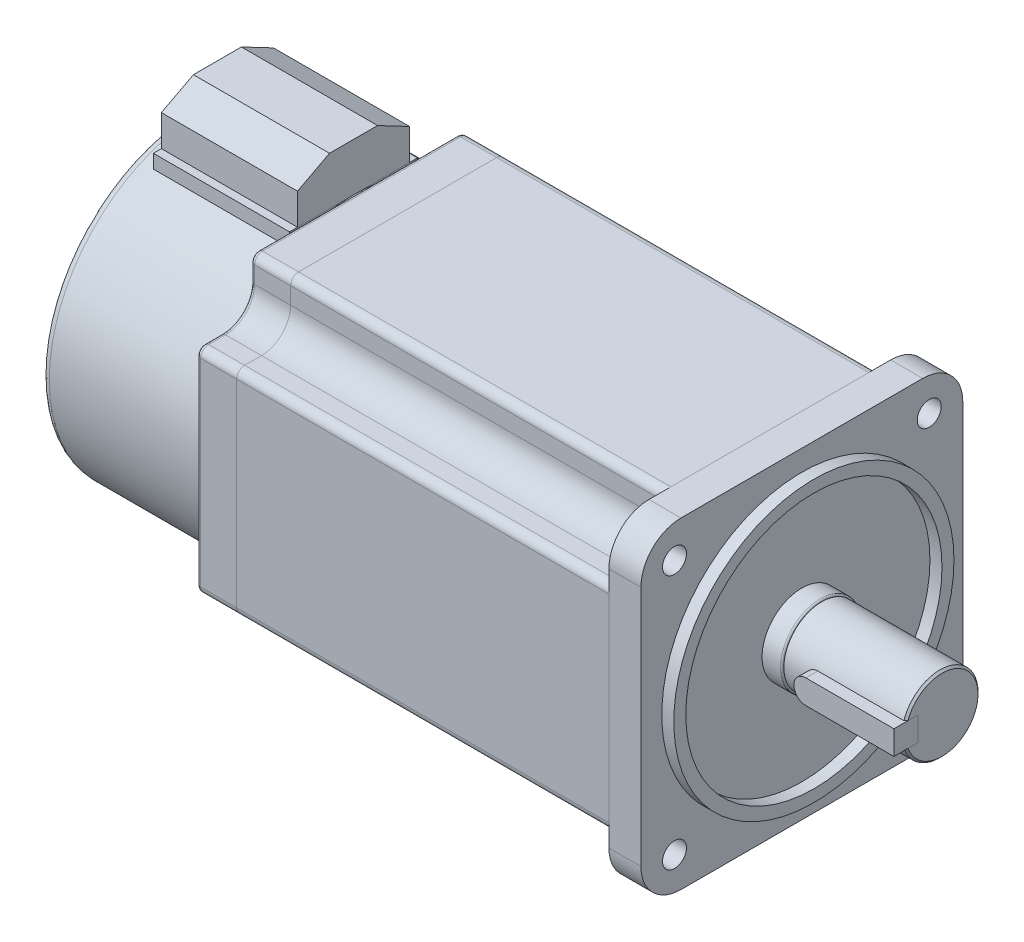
ISO-10303-21;
HEADER;
FILE_DESCRIPTION(('STEP AP214'),'2;1');
FILE_NAME('part.step','',(''),(''),'','','');
FILE_SCHEMA(('AUTOMOTIVE_DESIGN { 1 0 10303 214 1 1 1 1 }'));
ENDSEC;
DATA;
#1=APPLICATION_CONTEXT('core data for automotive mechanical design processes');
#2=APPLICATION_PROTOCOL_DEFINITION('international standard','automotive_design',2000,#1);
#3=PRODUCT_CONTEXT('',#1,'mechanical');
#4=PRODUCT('Part','Part','',(#3));
#5=PRODUCT_RELATED_PRODUCT_CATEGORY('part','',(#4));
#6=PRODUCT_DEFINITION_FORMATION('','',#4);
#7=PRODUCT_DEFINITION_CONTEXT('part definition',#1,'design');
#8=PRODUCT_DEFINITION('design','',#6,#7);
#9=PRODUCT_DEFINITION_SHAPE('','',#8);
#10=(LENGTH_UNIT() NAMED_UNIT(*) SI_UNIT(.MILLI.,.METRE.));
#11=(NAMED_UNIT(*) PLANE_ANGLE_UNIT() SI_UNIT($,.RADIAN.));
#12=(NAMED_UNIT(*) SI_UNIT($,.STERADIAN.) SOLID_ANGLE_UNIT());
#13=UNCERTAINTY_MEASURE_WITH_UNIT(LENGTH_MEASURE(1.E-05),#10,'distance_accuracy_value','');
#14=(GEOMETRIC_REPRESENTATION_CONTEXT(3) GLOBAL_UNCERTAINTY_ASSIGNED_CONTEXT((#13)) GLOBAL_UNIT_ASSIGNED_CONTEXT((#10,
#11,#12)) REPRESENTATION_CONTEXT('',''));
#15=CARTESIAN_POINT('',(0.,0.,0.));
#16=DIRECTION('',(0.,0.,1.));
#17=DIRECTION('',(1.,0.,0.));
#18=AXIS2_PLACEMENT_3D('',#15,#16,#17);
#19=CARTESIAN_POINT('',(-104.,51.,14.));
#20=DIRECTION('',(-1.,0.,0.));
#21=DIRECTION('',(0.,0.,1.));
#22=AXIS2_PLACEMENT_3D('',#19,#20,#21);
#23=PLANE('',#22);
#24=DIRECTION('',(0.,0.,-1.));
#25=VECTOR('',#24,1.);
#26=CARTESIAN_POINT('',(-104.,51.,14.));
#27=LINE('',#26,#25);
#28=CARTESIAN_POINT('',(-104.,51.,6.));
#29=VERTEX_POINT('',#28);
#30=CARTESIAN_POINT('',(-104.,51.,-6.));
#31=VERTEX_POINT('',#30);
#32=EDGE_CURVE('E109',#29,#31,#27,.T.);
#33=ORIENTED_EDGE('',*,*,#32,.F.);
#34=DIRECTION('',(0.,-0.464833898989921,0.885397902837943));
#35=VECTOR('',#34,1.);
#36=CARTESIAN_POINT('',(-104.,46.8,14.));
#37=LINE('',#36,#35);
#38=CARTESIAN_POINT('',(-104.,46.8,14.));
#39=VERTEX_POINT('',#38);
#40=EDGE_CURVE('E58',#29,#39,#37,.T.);
#41=ORIENTED_EDGE('',*,*,#40,.T.);
#42=DIRECTION('',(0.,-1.,0.));
#43=VECTOR('',#42,1.);
#44=CARTESIAN_POINT('',(-104.,51.,14.));
#45=LINE('',#44,#43);
#46=CARTESIAN_POINT('',(-104.,39.,14.));
#47=VERTEX_POINT('',#46);
#48=EDGE_CURVE('E106',#39,#47,#45,.T.);
#49=ORIENTED_EDGE('',*,*,#48,.T.);
#50=DIRECTION('',(0.,0.,-1.));
#51=VECTOR('',#50,1.);
#52=CARTESIAN_POINT('',(-104.,39.,14.));
#53=LINE('',#52,#51);
#54=CARTESIAN_POINT('',(-104.,39.,-14.));
#55=VERTEX_POINT('',#54);
#56=EDGE_CURVE('E138',#47,#55,#53,.T.);
#57=ORIENTED_EDGE('',*,*,#56,.T.);
#58=DIRECTION('',(0.,-1.,0.));
#59=VECTOR('',#58,1.);
#60=CARTESIAN_POINT('',(-104.,51.,-14.));
#61=LINE('',#60,#59);
#62=CARTESIAN_POINT('',(-104.,46.8,-14.));
#63=VERTEX_POINT('',#62);
#64=EDGE_CURVE('E12',#63,#55,#61,.T.);
#65=ORIENTED_EDGE('',*,*,#64,.F.);
#66=DIRECTION('',(0.,0.464833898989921,0.885397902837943));
#67=VECTOR('',#66,1.);
#68=CARTESIAN_POINT('',(-104.,51.,-6.));
#69=LINE('',#68,#67);
#70=EDGE_CURVE('E147',#63,#31,#69,.T.);
#71=ORIENTED_EDGE('',*,*,#70,.T.);
#72=EDGE_LOOP('',(#33,#41,#49,#57,#65,#71));
#73=FACE_BOUND('',#72,.T.);
#74=ADVANCED_FACE('F44',(#73),#23,.F.);
#75=CARTESIAN_POINT('',(-138.,51.,-14.));
#76=DIRECTION('',(0.,0.,1.));
#77=DIRECTION('',(1.,0.,0.));
#78=AXIS2_PLACEMENT_3D('',#75,#76,#77);
#79=PLANE('',#78);
#80=DIRECTION('',(0.,-1.,0.));
#81=VECTOR('',#80,1.);
#82=CARTESIAN_POINT('',(-138.,51.,-14.));
#83=LINE('',#82,#81);
#84=CARTESIAN_POINT('',(-138.,46.8,-14.));
#85=VERTEX_POINT('',#84);
#86=CARTESIAN_POINT('',(-138.,39.,-14.));
#87=VERTEX_POINT('',#86);
#88=EDGE_CURVE('E51',#85,#87,#83,.T.);
#89=ORIENTED_EDGE('',*,*,#88,.F.);
#90=DIRECTION('',(-1.,0.,0.));
#91=VECTOR('',#90,1.);
#92=CARTESIAN_POINT('',(-104.,46.8,-14.));
#93=LINE('',#92,#91);
#94=EDGE_CURVE('E145',#63,#85,#93,.T.);
#95=ORIENTED_EDGE('',*,*,#94,.F.);
#96=ORIENTED_EDGE('',*,*,#64,.T.);
#97=DIRECTION('',(-1.,0.,0.));
#98=VECTOR('',#97,1.);
#99=CARTESIAN_POINT('',(-138.,39.,-14.));
#100=LINE('',#99,#98);
#101=EDGE_CURVE('E134',#55,#87,#100,.T.);
#102=ORIENTED_EDGE('',*,*,#101,.T.);
#103=EDGE_LOOP('',(#89,#95,#96,#102));
#104=FACE_BOUND('',#103,.T.);
#105=ADVANCED_FACE('F135',(#104),#79,.F.);
#106=CARTESIAN_POINT('',(-138.,51.,14.));
#107=DIRECTION('',(1.,0.,0.));
#108=DIRECTION('',(0.,0.,-1.));
#109=AXIS2_PLACEMENT_3D('',#106,#107,#108);
#110=PLANE('',#109);
#111=DIRECTION('',(0.,-1.,0.));
#112=VECTOR('',#111,1.);
#113=CARTESIAN_POINT('',(-138.,51.,14.));
#114=LINE('',#113,#112);
#115=CARTESIAN_POINT('',(-138.,46.8,14.));
#116=VERTEX_POINT('',#115);
#117=CARTESIAN_POINT('',(-138.,39.,14.));
#118=VERTEX_POINT('',#117);
#119=EDGE_CURVE('E115',#116,#118,#114,.T.);
#120=ORIENTED_EDGE('',*,*,#119,.F.);
#121=DIRECTION('',(0.,-0.464833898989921,0.885397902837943));
#122=VECTOR('',#121,1.);
#123=CARTESIAN_POINT('',(-138.,46.8,14.));
#124=LINE('',#123,#122);
#125=CARTESIAN_POINT('',(-138.,51.,6.));
#126=VERTEX_POINT('',#125);
#127=EDGE_CURVE('E97',#126,#116,#124,.T.);
#128=ORIENTED_EDGE('',*,*,#127,.F.);
#129=DIRECTION('',(0.,0.,1.));
#130=VECTOR('',#129,1.);
#131=CARTESIAN_POINT('',(-138.,51.,14.));
#132=LINE('',#131,#130);
#133=CARTESIAN_POINT('',(-138.,51.,-6.));
#134=VERTEX_POINT('',#133);
#135=EDGE_CURVE('E116',#134,#126,#132,.T.);
#136=ORIENTED_EDGE('',*,*,#135,.F.);
#137=DIRECTION('',(0.,0.464833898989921,0.885397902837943));
#138=VECTOR('',#137,1.);
#139=CARTESIAN_POINT('',(-138.,51.,-6.));
#140=LINE('',#139,#138);
#141=EDGE_CURVE('E66',#85,#134,#140,.T.);
#142=ORIENTED_EDGE('',*,*,#141,.F.);
#143=ORIENTED_EDGE('',*,*,#88,.T.);
#144=DIRECTION('',(0.,0.,1.));
#145=VECTOR('',#144,1.);
#146=CARTESIAN_POINT('',(-138.,39.,14.));
#147=LINE('',#146,#145);
#148=EDGE_CURVE('E129',#87,#118,#147,.T.);
#149=ORIENTED_EDGE('',*,*,#148,.T.);
#150=EDGE_LOOP('',(#120,#128,#136,#142,#143,#149));
#151=FACE_BOUND('',#150,.T.);
#152=ADVANCED_FACE('F127',(#151),#110,.F.);
#153=CARTESIAN_POINT('',(-138.,51.,14.));
#154=DIRECTION('',(0.,0.,-1.));
#155=DIRECTION('',(-1.,0.,0.));
#156=AXIS2_PLACEMENT_3D('',#153,#154,#155);
#157=PLANE('',#156);
#158=ORIENTED_EDGE('',*,*,#48,.F.);
#159=DIRECTION('',(-1.,0.,0.));
#160=VECTOR('',#159,1.);
#161=CARTESIAN_POINT('',(-104.,46.8,14.));
#162=LINE('',#161,#160);
#163=EDGE_CURVE('E94',#39,#116,#162,.T.);
#164=ORIENTED_EDGE('',*,*,#163,.T.);
#165=ORIENTED_EDGE('',*,*,#119,.T.);
#166=DIRECTION('',(1.,0.,0.));
#167=VECTOR('',#166,1.);
#168=CARTESIAN_POINT('',(-138.,39.,14.));
#169=LINE('',#168,#167);
#170=EDGE_CURVE('E113',#118,#47,#169,.T.);
#171=ORIENTED_EDGE('',*,*,#170,.T.);
#172=EDGE_LOOP('',(#158,#164,#165,#171));
#173=FACE_BOUND('',#172,.T.);
#174=ADVANCED_FACE('F111',(#173),#157,.F.);
#175=CARTESIAN_POINT('',(0.,51.,0.));
#176=DIRECTION('',(0.,-1.,0.));
#177=DIRECTION('',(0.,0.,-1.));
#178=AXIS2_PLACEMENT_3D('',#175,#176,#177);
#179=PLANE('',#178);
#180=ORIENTED_EDGE('',*,*,#135,.T.);
#181=DIRECTION('',(-1.,0.,0.));
#182=VECTOR('',#181,1.);
#183=CARTESIAN_POINT('',(-104.,51.,6.));
#184=LINE('',#183,#182);
#185=EDGE_CURVE('E101',#29,#126,#184,.T.);
#186=ORIENTED_EDGE('',*,*,#185,.F.);
#187=ORIENTED_EDGE('',*,*,#32,.T.);
#188=DIRECTION('',(-1.,0.,0.));
#189=VECTOR('',#188,1.);
#190=CARTESIAN_POINT('',(-104.,51.,-6.));
#191=LINE('',#190,#189);
#192=EDGE_CURVE('E142',#31,#134,#191,.T.);
#193=ORIENTED_EDGE('',*,*,#192,.T.);
#194=EDGE_LOOP('',(#180,#186,#187,#193));
#195=FACE_BOUND('',#194,.T.);
#196=ADVANCED_FACE('F153',(#195),#179,.F.);
#197=CARTESIAN_POINT('',(0.,39.,0.));
#198=DIRECTION('',(0.,-1.,0.));
#199=DIRECTION('',(0.,0.,-1.));
#200=AXIS2_PLACEMENT_3D('',#197,#198,#199);
#201=PLANE('',#200);
#202=ORIENTED_EDGE('',*,*,#56,.F.);
#203=ORIENTED_EDGE('',*,*,#170,.F.);
#204=ORIENTED_EDGE('',*,*,#148,.F.);
#205=ORIENTED_EDGE('',*,*,#101,.F.);
#206=EDGE_LOOP('',(#202,#203,#204,#205));
#207=FACE_BOUND('',#206,.T.);
#208=ADVANCED_FACE('F140',(#207),#201,.T.);
#209=CARTESIAN_POINT('',(-104.,51.,-6.));
#210=DIRECTION('',(0.,-0.885397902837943,0.464833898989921));
#211=DIRECTION('',(0.,-0.464833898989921,-0.885397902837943));
#212=AXIS2_PLACEMENT_3D('',#209,#210,#211);
#213=PLANE('',#212);
#214=ORIENTED_EDGE('',*,*,#141,.T.);
#215=ORIENTED_EDGE('',*,*,#192,.F.);
#216=ORIENTED_EDGE('',*,*,#70,.F.);
#217=ORIENTED_EDGE('',*,*,#94,.T.);
#218=EDGE_LOOP('',(#214,#215,#216,#217));
#219=FACE_BOUND('',#218,.T.);
#220=ADVANCED_FACE('F154',(#219),#213,.F.);
#221=CARTESIAN_POINT('',(-104.,46.8,14.));
#222=DIRECTION('',(0.,-0.885397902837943,-0.464833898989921));
#223=DIRECTION('',(0.,0.464833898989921,-0.885397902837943));
#224=AXIS2_PLACEMENT_3D('',#221,#222,#223);
#225=PLANE('',#224);
#226=ORIENTED_EDGE('',*,*,#127,.T.);
#227=ORIENTED_EDGE('',*,*,#163,.F.);
#228=ORIENTED_EDGE('',*,*,#40,.F.);
#229=ORIENTED_EDGE('',*,*,#185,.T.);
#230=EDGE_LOOP('',(#226,#227,#228,#229));
#231=FACE_BOUND('',#230,.T.);
#232=ADVANCED_FACE('F95',(#231),#225,.F.);
#233=CLOSED_SHELL('',(#74,#105,#152,#174,#196,#208,#220,#232));
#234=MANIFOLD_SOLID_BREP('B2',#233);
#235=CARTESIAN_POINT('',(-143.,0.,0.));
#236=DIRECTION('',(1.,0.,0.));
#237=DIRECTION('',(0.,0.,-1.));
#238=AXIS2_PLACEMENT_3D('',#235,#236,#237);
#239=CYLINDRICAL_SURFACE('',#238,39.);
#240=DIRECTION('',(1.,0.,0.));
#241=VECTOR('',#240,1.);
#242=CARTESIAN_POINT('',(-143.,35.5668384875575,16.));
#243=LINE('',#242,#241);
#244=CARTESIAN_POINT('',(-104.,35.5668384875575,16.));
#245=VERTEX_POINT('',#244);
#246=CARTESIAN_POINT('',(-138.,35.5668384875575,16.));
#247=VERTEX_POINT('',#246);
#248=EDGE_CURVE('E42',#245,#247,#243,.F.);
#249=ORIENTED_EDGE('',*,*,#248,.T.);
#250=CARTESIAN_POINT('',(-138.,0.,0.));
#251=DIRECTION('',(-1.,0.,0.));
#252=DIRECTION('',(0.,0.,1.));
#253=AXIS2_PLACEMENT_3D('',#250,#251,#252);
#254=CIRCLE('',#253,39.);
#255=CARTESIAN_POINT('',(-138.,39.,0.));
#256=VERTEX_POINT('',#255);
#257=EDGE_CURVE('E318',#247,#256,#254,.T.);
#258=ORIENTED_EDGE('',*,*,#257,.T.);
#259=CARTESIAN_POINT('',(-138.,0.,0.));
#260=DIRECTION('',(1.,0.,0.));
#261=DIRECTION('',(0.,0.,-1.));
#262=AXIS2_PLACEMENT_3D('',#259,#260,#261);
#263=CIRCLE('',#262,39.);
#264=CARTESIAN_POINT('',(-138.,35.5668384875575,-16.));
#265=VERTEX_POINT('',#264);
#266=EDGE_CURVE('E302',#265,#256,#263,.T.);
#267=ORIENTED_EDGE('',*,*,#266,.F.);
#268=DIRECTION('',(1.,0.,0.));
#269=VECTOR('',#268,1.);
#270=CARTESIAN_POINT('',(-143.,35.5668384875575,-16.));
#271=LINE('',#270,#269);
#272=CARTESIAN_POINT('',(-104.,35.5668384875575,-16.));
#273=VERTEX_POINT('',#272);
#274=EDGE_CURVE('E238',#265,#273,#271,.T.);
#275=ORIENTED_EDGE('',*,*,#274,.T.);
#276=CARTESIAN_POINT('',(-104.,0.,0.));
#277=DIRECTION('',(1.,0.,0.));
#278=DIRECTION('',(0.,0.,-1.));
#279=AXIS2_PLACEMENT_3D('',#276,#277,#278);
#280=CIRCLE('',#279,39.);
#281=CARTESIAN_POINT('',(-104.,39.,0.));
#282=VERTEX_POINT('',#281);
#283=EDGE_CURVE('E301',#273,#282,#280,.T.);
#284=ORIENTED_EDGE('',*,*,#283,.T.);
#285=CARTESIAN_POINT('',(-104.,0.,0.));
#286=DIRECTION('',(-1.,0.,0.));
#287=DIRECTION('',(0.,0.,1.));
#288=AXIS2_PLACEMENT_3D('',#285,#286,#287);
#289=CIRCLE('',#288,39.);
#290=EDGE_CURVE('E253',#245,#282,#289,.T.);
#291=ORIENTED_EDGE('',*,*,#290,.F.);
#292=EDGE_LOOP('',(#249,#258,#267,#275,#284,#291));
#293=FACE_BOUND('',#292,.T.);
#294=CARTESIAN_POINT('',(-141.,0.,0.));
#295=DIRECTION('',(-1.,0.,0.));
#296=DIRECTION('',(0.,0.,1.));
#297=AXIS2_PLACEMENT_3D('',#294,#295,#296);
#298=CIRCLE('',#297,39.);
#299=CARTESIAN_POINT('',(-141.,0.,39.));
#300=VERTEX_POINT('',#299);
#301=EDGE_CURVE('E315',#300,#300,#298,.F.);
#302=ORIENTED_EDGE('',*,*,#301,.T.);
#303=EDGE_LOOP('',(#302));
#304=FACE_BOUND('',#303,.T.);
#305=CARTESIAN_POINT('',(-103.,0.,0.));
#306=DIRECTION('',(-1.,0.,0.));
#307=DIRECTION('',(0.,0.,1.));
#308=AXIS2_PLACEMENT_3D('',#305,#306,#307);
#309=CIRCLE('',#308,39.);
#310=CARTESIAN_POINT('',(-103.,0.,39.));
#311=VERTEX_POINT('',#310);
#312=EDGE_CURVE('E309',#311,#311,#309,.T.);
#313=ORIENTED_EDGE('',*,*,#312,.T.);
#314=EDGE_LOOP('',(#313));
#315=FACE_BOUND('',#314,.T.);
#316=ADVANCED_FACE('F230',(#293,#304,#315),#239,.T.);
#317=CARTESIAN_POINT('',(-143.,0.,0.));
#318=DIRECTION('',(-1.,0.,0.));
#319=DIRECTION('',(0.,0.,1.));
#320=AXIS2_PLACEMENT_3D('',#317,#318,#319);
#321=PLANE('',#320);
#322=CARTESIAN_POINT('',(-143.,0.,0.));
#323=DIRECTION('',(-1.,0.,0.));
#324=DIRECTION('',(0.,0.,1.));
#325=AXIS2_PLACEMENT_3D('',#322,#323,#324);
#326=CIRCLE('',#325,37.);
#327=CARTESIAN_POINT('',(-143.,0.,37.));
#328=VERTEX_POINT('',#327);
#329=EDGE_CURVE('E312',#328,#328,#326,.T.);
#330=ORIENTED_EDGE('',*,*,#329,.T.);
#331=EDGE_LOOP('',(#330));
#332=FACE_BOUND('',#331,.T.);
#333=ADVANCED_FACE('F347',(#332),#321,.T.);
#334=CARTESIAN_POINT('',(-103.,0.,0.));
#335=DIRECTION('',(-1.,0.,0.));
#336=DIRECTION('',(0.,0.,1.));
#337=AXIS2_PLACEMENT_3D('',#334,#335,#336);
#338=PLANE('',#337);
#339=ORIENTED_EDGE('',*,*,#312,.F.);
#340=EDGE_LOOP('',(#339));
#341=FACE_BOUND('',#340,.T.);
#342=ADVANCED_FACE('F351',(#341),#338,.F.);
#343=CARTESIAN_POINT('',(-141.,0.,0.));
#344=DIRECTION('',(-1.,0.,0.));
#345=DIRECTION('',(0.,0.,1.));
#346=AXIS2_PLACEMENT_3D('',#343,#344,#345);
#347=TOROIDAL_SURFACE('',#346,37.,2.);
#348=ORIENTED_EDGE('',*,*,#301,.F.);
#349=EDGE_LOOP('',(#348));
#350=FACE_BOUND('',#349,.T.);
#351=ORIENTED_EDGE('',*,*,#329,.F.);
#352=EDGE_LOOP('',(#351));
#353=FACE_BOUND('',#352,.T.);
#354=ADVANCED_FACE('F232',(#350,#353),#347,.T.);
#355=CARTESIAN_POINT('',(-104.,39.,16.));
#356=DIRECTION('',(-1.,0.,0.));
#357=DIRECTION('',(0.,0.,1.));
#358=AXIS2_PLACEMENT_3D('',#355,#356,#357);
#359=PLANE('',#358);
#360=DIRECTION('',(0.,-1.,0.));
#361=VECTOR('',#360,1.);
#362=CARTESIAN_POINT('',(-104.,39.,16.));
#363=LINE('',#362,#361);
#364=CARTESIAN_POINT('',(-104.,39.,16.));
#365=VERTEX_POINT('',#364);
#366=EDGE_CURVE('E330',#365,#245,#363,.T.);
#367=ORIENTED_EDGE('',*,*,#366,.T.);
#368=ORIENTED_EDGE('',*,*,#290,.T.);
#369=DIRECTION('',(0.,0.,-1.));
#370=VECTOR('',#369,1.);
#371=CARTESIAN_POINT('',(-104.,39.,16.));
#372=LINE('',#371,#370);
#373=EDGE_CURVE('E285',#365,#282,#372,.T.);
#374=ORIENTED_EDGE('',*,*,#373,.F.);
#375=EDGE_LOOP('',(#367,#368,#374));
#376=FACE_BOUND('',#375,.T.);
#377=ADVANCED_FACE('F334',(#376),#359,.F.);
#378=CARTESIAN_POINT('',(-104.,39.,-16.));
#379=VERTEX_POINT('',#378);
#380=EDGE_CURVE('E279',#282,#379,#372,.T.);
#381=ORIENTED_EDGE('',*,*,#380,.F.);
#382=ORIENTED_EDGE('',*,*,#283,.F.);
#383=DIRECTION('',(0.,-1.,0.));
#384=VECTOR('',#383,1.);
#385=CARTESIAN_POINT('',(-104.,39.,-16.));
#386=LINE('',#385,#384);
#387=EDGE_CURVE('E293',#379,#273,#386,.T.);
#388=ORIENTED_EDGE('',*,*,#387,.F.);
#389=EDGE_LOOP('',(#381,#382,#388));
#390=FACE_BOUND('',#389,.T.);
#391=ADVANCED_FACE('F300',(#390),#359,.F.);
#392=CARTESIAN_POINT('',(-138.,39.,-16.));
#393=DIRECTION('',(0.,0.,1.));
#394=DIRECTION('',(1.,0.,0.));
#395=AXIS2_PLACEMENT_3D('',#392,#393,#394);
#396=PLANE('',#395);
#397=ORIENTED_EDGE('',*,*,#387,.T.);
#398=ORIENTED_EDGE('',*,*,#274,.F.);
#399=DIRECTION('',(0.,-1.,0.));
#400=VECTOR('',#399,1.);
#401=CARTESIAN_POINT('',(-138.,39.,-16.));
#402=LINE('',#401,#400);
#403=CARTESIAN_POINT('',(-138.,39.,-16.));
#404=VERTEX_POINT('',#403);
#405=EDGE_CURVE('E296',#404,#265,#402,.T.);
#406=ORIENTED_EDGE('',*,*,#405,.F.);
#407=DIRECTION('',(-1.,0.,0.));
#408=VECTOR('',#407,1.);
#409=CARTESIAN_POINT('',(-138.,39.,-16.));
#410=LINE('',#409,#408);
#411=EDGE_CURVE('E283',#379,#404,#410,.T.);
#412=ORIENTED_EDGE('',*,*,#411,.F.);
#413=EDGE_LOOP('',(#397,#398,#406,#412));
#414=FACE_BOUND('',#413,.T.);
#415=ADVANCED_FACE('F292',(#414),#396,.F.);
#416=CARTESIAN_POINT('',(-138.,39.,16.));
#417=DIRECTION('',(1.,0.,0.));
#418=DIRECTION('',(0.,0.,-1.));
#419=AXIS2_PLACEMENT_3D('',#416,#417,#418);
#420=PLANE('',#419);
#421=ORIENTED_EDGE('',*,*,#405,.T.);
#422=ORIENTED_EDGE('',*,*,#266,.T.);
#423=DIRECTION('',(0.,0.,1.));
#424=VECTOR('',#423,1.);
#425=CARTESIAN_POINT('',(-138.,39.,16.));
#426=LINE('',#425,#424);
#427=EDGE_CURVE('E327',#404,#256,#426,.T.);
#428=ORIENTED_EDGE('',*,*,#427,.F.);
#429=EDGE_LOOP('',(#421,#422,#428));
#430=FACE_BOUND('',#429,.T.);
#431=ADVANCED_FACE('F325',(#430),#420,.F.);
#432=CARTESIAN_POINT('',(-138.,39.,16.));
#433=VERTEX_POINT('',#432);
#434=EDGE_CURVE('E298',#256,#433,#426,.T.);
#435=ORIENTED_EDGE('',*,*,#434,.F.);
#436=ORIENTED_EDGE('',*,*,#257,.F.);
#437=DIRECTION('',(0.,-1.,0.));
#438=VECTOR('',#437,1.);
#439=CARTESIAN_POINT('',(-138.,39.,16.));
#440=LINE('',#439,#438);
#441=EDGE_CURVE('E245',#433,#247,#440,.T.);
#442=ORIENTED_EDGE('',*,*,#441,.F.);
#443=EDGE_LOOP('',(#435,#436,#442));
#444=FACE_BOUND('',#443,.T.);
#445=ADVANCED_FACE('F337',(#444),#420,.F.);
#446=CARTESIAN_POINT('',(-138.,39.,16.));
#447=DIRECTION('',(0.,0.,-1.));
#448=DIRECTION('',(-1.,0.,0.));
#449=AXIS2_PLACEMENT_3D('',#446,#447,#448);
#450=PLANE('',#449);
#451=ORIENTED_EDGE('',*,*,#441,.T.);
#452=ORIENTED_EDGE('',*,*,#248,.F.);
#453=ORIENTED_EDGE('',*,*,#366,.F.);
#454=DIRECTION('',(1.,0.,0.));
#455=VECTOR('',#454,1.);
#456=CARTESIAN_POINT('',(-138.,39.,16.));
#457=LINE('',#456,#455);
#458=EDGE_CURVE('E328',#433,#365,#457,.T.);
#459=ORIENTED_EDGE('',*,*,#458,.F.);
#460=EDGE_LOOP('',(#451,#452,#453,#459));
#461=FACE_BOUND('',#460,.T.);
#462=ADVANCED_FACE('F335',(#461),#450,.F.);
#463=CARTESIAN_POINT('',(0.,39.,0.));
#464=DIRECTION('',(0.,-1.,0.));
#465=DIRECTION('',(0.,0.,-1.));
#466=AXIS2_PLACEMENT_3D('',#463,#464,#465);
#467=PLANE('',#466);
#468=ORIENTED_EDGE('',*,*,#373,.T.);
#469=ORIENTED_EDGE('',*,*,#380,.T.);
#470=ORIENTED_EDGE('',*,*,#411,.T.);
#471=ORIENTED_EDGE('',*,*,#427,.T.);
#472=ORIENTED_EDGE('',*,*,#434,.T.);
#473=ORIENTED_EDGE('',*,*,#458,.T.);
#474=EDGE_LOOP('',(#468,#469,#470,#471,#472,#473));
#475=FACE_BOUND('',#474,.T.);
#476=ADVANCED_FACE('F281',(#475),#467,.F.);
#477=CLOSED_SHELL('',(#316,#333,#342,#354,#377,#391,#415,#431,#445,#462,#476));
#478=MANIFOLD_SOLID_BREP('B6',#477);
#479=CARTESIAN_POINT('',(21.,0.,12.));
#480=DIRECTION('',(0.,0.,-1.));
#481=DIRECTION('',(-1.,0.,0.));
#482=AXIS2_PLACEMENT_3D('',#479,#480,#481);
#483=CYLINDRICAL_SURFACE('',#482,3.);
#484=CARTESIAN_POINT('',(21.,0.,6.));
#485=DIRECTION('',(0.,0.,1.));
#486=DIRECTION('',(1.,0.,0.));
#487=AXIS2_PLACEMENT_3D('',#484,#485,#486);
#488=CIRCLE('',#487,3.);
#489=CARTESIAN_POINT('',(21.,3.,6.));
#490=VERTEX_POINT('',#489);
#491=CARTESIAN_POINT('',(21.,-3.,6.));
#492=VERTEX_POINT('',#491);
#493=EDGE_CURVE('E508',#490,#492,#488,.T.);
#494=ORIENTED_EDGE('',*,*,#493,.T.);
#495=DIRECTION('',(0.,0.,-1.));
#496=VECTOR('',#495,1.);
#497=CARTESIAN_POINT('',(21.,-3.,12.));
#498=LINE('',#497,#496);
#499=CARTESIAN_POINT('',(21.,-3.,12.));
#500=VERTEX_POINT('',#499);
#501=EDGE_CURVE('E228',#500,#492,#498,.T.);
#502=ORIENTED_EDGE('',*,*,#501,.F.);
#503=CARTESIAN_POINT('',(21.,0.,12.));
#504=DIRECTION('',(0.,0.,1.));
#505=DIRECTION('',(1.,0.,0.));
#506=AXIS2_PLACEMENT_3D('',#503,#504,#505);
#507=CIRCLE('',#506,3.);
#508=CARTESIAN_POINT('',(21.,3.,12.));
#509=VERTEX_POINT('',#508);
#510=EDGE_CURVE('E496',#509,#500,#507,.T.);
#511=ORIENTED_EDGE('',*,*,#510,.F.);
#512=DIRECTION('',(0.,0.,-1.));
#513=VECTOR('',#512,1.);
#514=CARTESIAN_POINT('',(21.,3.,12.));
#515=LINE('',#514,#513);
#516=EDGE_CURVE('E504',#509,#490,#515,.T.);
#517=ORIENTED_EDGE('',*,*,#516,.T.);
#518=EDGE_LOOP('',(#494,#502,#511,#517));
#519=FACE_BOUND('',#518,.T.);
#520=ADVANCED_FACE('F445',(#519),#483,.T.);
#521=CARTESIAN_POINT('',(43.,-3.,12.));
#522=DIRECTION('',(0.,1.,0.));
#523=DIRECTION('',(-1.,0.,0.));
#524=AXIS2_PLACEMENT_3D('',#521,#522,#523);
#525=PLANE('',#524);
#526=DIRECTION('',(1.,0.,0.));
#527=VECTOR('',#526,1.);
#528=CARTESIAN_POINT('',(43.,-3.,6.));
#529=LINE('',#528,#527);
#530=CARTESIAN_POINT('',(43.,-3.,6.));
#531=VERTEX_POINT('',#530);
#532=EDGE_CURVE('E500',#492,#531,#529,.T.);
#533=ORIENTED_EDGE('',*,*,#532,.T.);
#534=DIRECTION('',(0.,0.,-1.));
#535=VECTOR('',#534,1.);
#536=CARTESIAN_POINT('',(43.,-3.,12.));
#537=LINE('',#536,#535);
#538=CARTESIAN_POINT('',(43.,-3.,12.));
#539=VERTEX_POINT('',#538);
#540=EDGE_CURVE('E453',#539,#531,#537,.T.);
#541=ORIENTED_EDGE('',*,*,#540,.F.);
#542=DIRECTION('',(1.,0.,0.));
#543=VECTOR('',#542,1.);
#544=CARTESIAN_POINT('',(43.,-3.,12.));
#545=LINE('',#544,#543);
#546=EDGE_CURVE('E491',#500,#539,#545,.T.);
#547=ORIENTED_EDGE('',*,*,#546,.F.);
#548=ORIENTED_EDGE('',*,*,#501,.T.);
#549=EDGE_LOOP('',(#533,#541,#547,#548));
#550=FACE_BOUND('',#549,.T.);
#551=ADVANCED_FACE('F499',(#550),#525,.F.);
#552=CARTESIAN_POINT('',(43.,3.,12.));
#553=DIRECTION('',(-1.,0.,0.));
#554=DIRECTION('',(0.,0.,1.));
#555=AXIS2_PLACEMENT_3D('',#552,#553,#554);
#556=PLANE('',#555);
#557=DIRECTION('',(0.,1.,0.));
#558=VECTOR('',#557,1.);
#559=CARTESIAN_POINT('',(43.,3.,6.));
#560=LINE('',#559,#558);
#561=CARTESIAN_POINT('',(43.,3.,6.));
#562=VERTEX_POINT('',#561);
#563=EDGE_CURVE('E478',#531,#562,#560,.T.);
#564=ORIENTED_EDGE('',*,*,#563,.T.);
#565=DIRECTION('',(0.,0.,-1.));
#566=VECTOR('',#565,1.);
#567=CARTESIAN_POINT('',(43.,3.,12.));
#568=LINE('',#567,#566);
#569=CARTESIAN_POINT('',(43.,3.,12.));
#570=VERTEX_POINT('',#569);
#571=EDGE_CURVE('E501',#570,#562,#568,.T.);
#572=ORIENTED_EDGE('',*,*,#571,.F.);
#573=DIRECTION('',(0.,1.,0.));
#574=VECTOR('',#573,1.);
#575=CARTESIAN_POINT('',(43.,3.,12.));
#576=LINE('',#575,#574);
#577=EDGE_CURVE('E494',#539,#570,#576,.T.);
#578=ORIENTED_EDGE('',*,*,#577,.F.);
#579=ORIENTED_EDGE('',*,*,#540,.T.);
#580=EDGE_LOOP('',(#564,#572,#578,#579));
#581=FACE_BOUND('',#580,.T.);
#582=ADVANCED_FACE('F502',(#581),#556,.F.);
#583=CARTESIAN_POINT('',(21.,3.,12.));
#584=DIRECTION('',(0.,-1.,0.));
#585=DIRECTION('',(1.,0.,0.));
#586=AXIS2_PLACEMENT_3D('',#583,#584,#585);
#587=PLANE('',#586);
#588=DIRECTION('',(-1.,0.,0.));
#589=VECTOR('',#588,1.);
#590=CARTESIAN_POINT('',(21.,3.,6.));
#591=LINE('',#590,#589);
#592=EDGE_CURVE('E484',#562,#490,#591,.T.);
#593=ORIENTED_EDGE('',*,*,#592,.T.);
#594=ORIENTED_EDGE('',*,*,#516,.F.);
#595=DIRECTION('',(-1.,0.,0.));
#596=VECTOR('',#595,1.);
#597=CARTESIAN_POINT('',(21.,3.,12.));
#598=LINE('',#597,#596);
#599=EDGE_CURVE('E461',#570,#509,#598,.T.);
#600=ORIENTED_EDGE('',*,*,#599,.F.);
#601=ORIENTED_EDGE('',*,*,#571,.T.);
#602=EDGE_LOOP('',(#593,#594,#600,#601));
#603=FACE_BOUND('',#602,.T.);
#604=ADVANCED_FACE('F515',(#603),#587,.F.);
#605=CARTESIAN_POINT('',(21.,0.,12.));
#606=DIRECTION('',(0.,0.,1.));
#607=DIRECTION('',(1.,0.,0.));
#608=AXIS2_PLACEMENT_3D('',#605,#606,#607);
#609=PLANE('',#608);
#610=ORIENTED_EDGE('',*,*,#510,.T.);
#611=ORIENTED_EDGE('',*,*,#546,.T.);
#612=ORIENTED_EDGE('',*,*,#577,.T.);
#613=ORIENTED_EDGE('',*,*,#599,.T.);
#614=EDGE_LOOP('',(#610,#611,#612,#613));
#615=FACE_BOUND('',#614,.T.);
#616=ADVANCED_FACE('F492',(#615),#609,.T.);
#617=CARTESIAN_POINT('',(21.,0.,6.));
#618=DIRECTION('',(0.,0.,1.));
#619=DIRECTION('',(1.,0.,0.));
#620=AXIS2_PLACEMENT_3D('',#617,#618,#619);
#621=PLANE('',#620);
#622=ORIENTED_EDGE('',*,*,#493,.F.);
#623=ORIENTED_EDGE('',*,*,#592,.F.);
#624=ORIENTED_EDGE('',*,*,#563,.F.);
#625=ORIENTED_EDGE('',*,*,#532,.F.);
#626=EDGE_LOOP('',(#622,#623,#624,#625));
#627=FACE_BOUND('',#626,.T.);
#628=ADVANCED_FACE('F518',(#627),#621,.F.);
#629=CLOSED_SHELL('',(#520,#551,#582,#604,#616,#628));
#630=MANIFOLD_SOLID_BREP('B36',#629);
#631=CARTESIAN_POINT('',(43.,0.,0.));
#632=DIRECTION('',(-1.,0.,0.));
#633=DIRECTION('',(0.,0.,1.));
#634=AXIS2_PLACEMENT_3D('',#631,#632,#633);
#635=CYLINDRICAL_SURFACE('',#634,9.5);
#636=DIRECTION('',(-1.,0.,0.));
#637=VECTOR('',#636,1.);
#638=CARTESIAN_POINT('',(43.,3.,9.01387818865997));
#639=LINE('',#638,#637);
#640=CARTESIAN_POINT('',(21.,3.,9.01387818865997));
#641=VERTEX_POINT('',#640);
#642=CARTESIAN_POINT('',(42.5,3.,9.01387818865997));
#643=VERTEX_POINT('',#642);
#644=EDGE_CURVE('E664',#641,#643,#639,.F.);
#645=ORIENTED_EDGE('',*,*,#644,.T.);
#646=CARTESIAN_POINT('',(42.5,0.,0.));
#647=DIRECTION('',(1.,0.,0.));
#648=DIRECTION('',(0.,0.,-1.));
#649=AXIS2_PLACEMENT_3D('',#646,#647,#648);
#650=CIRCLE('',#649,9.5);
#651=CARTESIAN_POINT('',(42.5,-3.,9.01387818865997));
#652=VERTEX_POINT('',#651);
#653=EDGE_CURVE('E592',#643,#652,#650,.F.);
#654=ORIENTED_EDGE('',*,*,#653,.T.);
#655=DIRECTION('',(-1.,0.,0.));
#656=VECTOR('',#655,1.);
#657=CARTESIAN_POINT('',(43.,-3.,9.01387818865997));
#658=LINE('',#657,#656);
#659=CARTESIAN_POINT('',(21.,-3.,9.01387818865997));
#660=VERTEX_POINT('',#659);
#661=EDGE_CURVE('E659',#652,#660,#658,.T.);
#662=ORIENTED_EDGE('',*,*,#661,.T.);
#663=CARTESIAN_POINT('',(21.,-3.,9.01387818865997));
#664=CARTESIAN_POINT('',(20.9178884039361,-3.00001051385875,9.0138659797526));
#665=CARTESIAN_POINT('',(20.8357837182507,-2.99662905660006,9.01499989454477));
#666=CARTESIAN_POINT('',(20.6722056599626,-2.98316404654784,9.01946917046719));
#667=CARTESIAN_POINT('',(20.5907321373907,-2.97308213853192,9.02280399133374));
#668=CARTESIAN_POINT('',(20.4292133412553,-2.94633448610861,9.03157240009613));
#669=CARTESIAN_POINT('',(20.3491647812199,-2.92968675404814,9.03700024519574));
#670=CARTESIAN_POINT('',(20.1908532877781,-2.88997412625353,9.04977799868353));
#671=CARTESIAN_POINT('',(20.112590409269,-2.86690903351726,9.05712796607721));
#672=CARTESIAN_POINT('',(19.8813586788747,-2.78838156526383,9.08173850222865));
#673=CARTESIAN_POINT('',(19.7317258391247,-2.72354999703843,9.10157261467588));
#674=CARTESIAN_POINT('',(19.4454502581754,-2.57094386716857,9.14584733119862));
#675=CARTESIAN_POINT('',(19.3088145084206,-2.48315705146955,9.17029039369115));
#676=CARTESIAN_POINT('',(19.0475918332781,-2.2838388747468,9.22198403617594));
#677=CARTESIAN_POINT('',(18.9235225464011,-2.17164444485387,9.24929895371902));
#678=CARTESIAN_POINT('',(18.6956125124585,-1.92811437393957,9.30311268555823));
#679=CARTESIAN_POINT('',(18.5917752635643,-1.79677542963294,9.32961135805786));
#680=CARTESIAN_POINT('',(18.4049616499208,-1.51492697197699,9.37954779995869));
#681=CARTESIAN_POINT('',(18.3225238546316,-1.36404405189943,9.40290050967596));
#682=CARTESIAN_POINT('',(18.184403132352,-1.049697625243,9.44315613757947));
#683=CARTESIAN_POINT('',(18.128712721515,-0.886237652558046,9.46006085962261));
#684=CARTESIAN_POINT('',(18.0474069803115,-0.556831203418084,9.48505937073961));
#685=CARTESIAN_POINT('',(18.0209003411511,-0.391124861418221,9.49341369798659));
#686=CARTESIAN_POINT('',(17.9958889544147,-0.0574168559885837,9.50129109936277));
#687=CARTESIAN_POINT('',(17.9973782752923,0.110584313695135,9.50081604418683));
#688=CARTESIAN_POINT('',(18.0277344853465,0.43782817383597,9.49126851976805));
#689=CARTESIAN_POINT('',(18.0556344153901,0.597170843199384,9.48249971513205));
#690=CARTESIAN_POINT('',(18.1364309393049,0.908782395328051,9.45772480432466));
#691=CARTESIAN_POINT('',(18.1893288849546,1.06105089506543,9.44171830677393));
#692=CARTESIAN_POINT('',(18.319232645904,1.35640803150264,9.40386197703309));
#693=CARTESIAN_POINT('',(18.3965292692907,1.4993594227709,9.38194214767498));
#694=CARTESIAN_POINT('',(18.5728017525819,1.77055948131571,9.33456474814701));
#695=CARTESIAN_POINT('',(18.6717829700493,1.89880450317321,9.309106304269));
#696=CARTESIAN_POINT('',(18.8935531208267,2.14270544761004,9.25608223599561));
#697=CARTESIAN_POINT('',(19.0171739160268,2.25759649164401,9.22847303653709));
#698=CARTESIAN_POINT('',(19.2822127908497,2.46526929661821,9.17518254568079));
#699=CARTESIAN_POINT('',(19.423636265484,2.55804433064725,9.14950184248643));
#700=CARTESIAN_POINT('',(19.7224948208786,2.71978065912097,9.10274637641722));
#701=CARTESIAN_POINT('',(19.8801034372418,2.7884391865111,9.08173131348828));
#702=CARTESIAN_POINT('',(20.2053868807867,2.89791755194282,9.04739847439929));
#703=CARTESIAN_POINT('',(20.3730456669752,2.93878053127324,9.0340687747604));
#704=CARTESIAN_POINT('',(20.6185881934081,2.97664323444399,9.02162485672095));
#705=CARTESIAN_POINT('',(20.6946296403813,2.98539986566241,9.01872707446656));
#706=CARTESIAN_POINT('',(20.8471008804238,2.99707362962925,9.01485301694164));
#707=CARTESIAN_POINT('',(20.9235299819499,2.99999890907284,9.01387406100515));
#708=CARTESIAN_POINT('',(21.,3.,9.01387818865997));
#709=B_SPLINE_CURVE_WITH_KNOTS('',3,(#663,#664,#665,#666,#667,#668,#669,#670,#671,#672,#673,
#674,#675,#676,#677,#678,#679,#680,#681,#682,#683,#684,#685,#686,#687,#688,#689,#690,#691,#692,
#693,#694,#695,#696,#697,#698,#699,#700,#701,#702,#703,#704,#705,#706,#707,#708),.UNSPECIFIED.,
.F.,.F.,(4,2,2,2,2,2,2,2,2,2,2,2,2,2,2,2,2,2,2,2,2,2,4),(0.,0.24624563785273,0.492430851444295,
0.737945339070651,0.983467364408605,1.47384684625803,1.9644886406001,2.47064554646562,
2.97688989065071,3.49485361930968,4.01267233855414,4.5141953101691,5.01561202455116,
5.49935290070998,5.98311993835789,6.47288577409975,6.96277275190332,7.47344235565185,
7.98426708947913,8.50129313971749,9.01751487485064,9.24710313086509,9.47637041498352),.UNSPECIFIED.);
#710=EDGE_CURVE('E638',#660,#641,#709,.T.);
#711=ORIENTED_EDGE('',*,*,#710,.T.);
#712=EDGE_LOOP('',(#645,#654,#662,#711));
#713=FACE_BOUND('',#712,.T.);
#714=CARTESIAN_POINT('',(13.,0.,0.));
#715=DIRECTION('',(1.,0.,0.));
#716=DIRECTION('',(0.,0.,-1.));
#717=AXIS2_PLACEMENT_3D('',#714,#715,#716);
#718=CIRCLE('',#717,9.5);
#719=CARTESIAN_POINT('',(13.,0.,-9.5));
#720=VERTEX_POINT('',#719);
#721=EDGE_CURVE('E666',#720,#720,#718,.T.);
#722=ORIENTED_EDGE('',*,*,#721,.T.);
#723=EDGE_LOOP('',(#722));
#724=FACE_BOUND('',#723,.T.);
#725=ADVANCED_FACE('F579',(#713,#724),#635,.T.);
#726=CARTESIAN_POINT('',(43.,0.,0.));
#727=DIRECTION('',(1.,0.,0.));
#728=DIRECTION('',(0.,0.,-1.));
#729=AXIS2_PLACEMENT_3D('',#726,#727,#728);
#730=PLANE('',#729);
#731=DIRECTION('',(0.,0.,1.));
#732=VECTOR('',#731,1.);
#733=CARTESIAN_POINT('',(43.,-3.,6.));
#734=LINE('',#733,#732);
#735=CARTESIAN_POINT('',(43.,-3.,6.));
#736=VERTEX_POINT('',#735);
#737=CARTESIAN_POINT('',(43.,-3.,8.48528137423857));
#738=VERTEX_POINT('',#737);
#739=EDGE_CURVE('E640',#736,#738,#734,.T.);
#740=ORIENTED_EDGE('',*,*,#739,.T.);
#741=CARTESIAN_POINT('',(43.,0.,0.));
#742=DIRECTION('',(1.,0.,0.));
#743=DIRECTION('',(0.,0.,-1.));
#744=AXIS2_PLACEMENT_3D('',#741,#742,#743);
#745=CIRCLE('',#744,9.);
#746=CARTESIAN_POINT('',(43.,3.,8.48528137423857));
#747=VERTEX_POINT('',#746);
#748=EDGE_CURVE('E674',#738,#747,#745,.T.);
#749=ORIENTED_EDGE('',*,*,#748,.T.);
#750=DIRECTION('',(0.,0.,1.));
#751=VECTOR('',#750,1.);
#752=CARTESIAN_POINT('',(43.,3.,6.));
#753=LINE('',#752,#751);
#754=CARTESIAN_POINT('',(43.,3.,6.));
#755=VERTEX_POINT('',#754);
#756=EDGE_CURVE('E660',#755,#747,#753,.T.);
#757=ORIENTED_EDGE('',*,*,#756,.F.);
#758=DIRECTION('',(0.,1.,0.));
#759=VECTOR('',#758,1.);
#760=CARTESIAN_POINT('',(43.,3.,6.));
#761=LINE('',#760,#759);
#762=EDGE_CURVE('E649',#736,#755,#761,.T.);
#763=ORIENTED_EDGE('',*,*,#762,.F.);
#764=EDGE_LOOP('',(#740,#749,#757,#763));
#765=FACE_BOUND('',#764,.T.);
#766=ADVANCED_FACE('F685',(#765),#730,.T.);
#767=CARTESIAN_POINT('',(13.,0.,0.));
#768=DIRECTION('',(1.,0.,0.));
#769=DIRECTION('',(0.,0.,-1.));
#770=AXIS2_PLACEMENT_3D('',#767,#768,#769);
#771=PLANE('',#770);
#772=ORIENTED_EDGE('',*,*,#721,.F.);
#773=EDGE_LOOP('',(#772));
#774=FACE_BOUND('',#773,.T.);
#775=ADVANCED_FACE('F682',(#774),#771,.F.);
#776=CARTESIAN_POINT('',(21.,0.,6.));
#777=DIRECTION('',(0.,0.,1.));
#778=DIRECTION('',(1.,0.,0.));
#779=AXIS2_PLACEMENT_3D('',#776,#777,#778);
#780=CYLINDRICAL_SURFACE('',#779,3.);
#781=DIRECTION('',(0.,0.,1.));
#782=VECTOR('',#781,1.);
#783=CARTESIAN_POINT('',(21.,-3.,6.));
#784=LINE('',#783,#782);
#785=CARTESIAN_POINT('',(21.,-3.,6.));
#786=VERTEX_POINT('',#785);
#787=EDGE_CURVE('E630',#786,#660,#784,.T.);
#788=ORIENTED_EDGE('',*,*,#787,.F.);
#789=CARTESIAN_POINT('',(21.,0.,6.));
#790=DIRECTION('',(0.,0.,1.));
#791=DIRECTION('',(1.,0.,0.));
#792=AXIS2_PLACEMENT_3D('',#789,#790,#791);
#793=CIRCLE('',#792,3.);
#794=CARTESIAN_POINT('',(21.,3.,6.));
#795=VERTEX_POINT('',#794);
#796=EDGE_CURVE('E635',#795,#786,#793,.T.);
#797=ORIENTED_EDGE('',*,*,#796,.F.);
#798=DIRECTION('',(0.,0.,1.));
#799=VECTOR('',#798,1.);
#800=CARTESIAN_POINT('',(21.,3.,6.));
#801=LINE('',#800,#799);
#802=EDGE_CURVE('E657',#795,#641,#801,.T.);
#803=ORIENTED_EDGE('',*,*,#802,.T.);
#804=ORIENTED_EDGE('',*,*,#710,.F.);
#805=EDGE_LOOP('',(#788,#797,#803,#804));
#806=FACE_BOUND('',#805,.T.);
#807=ADVANCED_FACE('F632',(#806),#780,.F.);
#808=CARTESIAN_POINT('',(21.,3.,6.));
#809=DIRECTION('',(0.,1.,0.));
#810=DIRECTION('',(-1.,0.,0.));
#811=AXIS2_PLACEMENT_3D('',#808,#809,#810);
#812=PLANE('',#811);
#813=ORIENTED_EDGE('',*,*,#756,.T.);
#814=CARTESIAN_POINT('',(43.,3.,8.48528137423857));
#815=CARTESIAN_POINT('',(42.9168065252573,3.,8.5735131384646));
#816=CARTESIAN_POINT('',(42.8335431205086,3.,8.66167875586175));
#817=CARTESIAN_POINT('',(42.6668764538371,3.,8.83787769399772));
#818=CARTESIAN_POINT('',(42.5834731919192,3.,8.92591101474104));
#819=CARTESIAN_POINT('',(42.5,3.,9.01387818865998));
#820=B_SPLINE_CURVE_WITH_KNOTS('',3,(#814,#815,#816,#817,#818,#819),.UNSPECIFIED.,.F.,.F.,(4,2,
4),(0.,0.363804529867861,0.727609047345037),.UNSPECIFIED.);
#821=EDGE_CURVE('E606',#747,#643,#820,.T.);
#822=ORIENTED_EDGE('',*,*,#821,.T.);
#823=ORIENTED_EDGE('',*,*,#644,.F.);
#824=ORIENTED_EDGE('',*,*,#802,.F.);
#825=DIRECTION('',(-1.,0.,0.));
#826=VECTOR('',#825,1.);
#827=CARTESIAN_POINT('',(21.,3.,6.));
#828=LINE('',#827,#826);
#829=EDGE_CURVE('E641',#755,#795,#828,.T.);
#830=ORIENTED_EDGE('',*,*,#829,.F.);
#831=EDGE_LOOP('',(#813,#822,#823,#824,#830));
#832=FACE_BOUND('',#831,.T.);
#833=ADVANCED_FACE('F681',(#832),#812,.F.);
#834=CARTESIAN_POINT('',(43.,-3.,6.));
#835=DIRECTION('',(0.,-1.,0.));
#836=DIRECTION('',(0.,0.,-1.));
#837=AXIS2_PLACEMENT_3D('',#834,#835,#836);
#838=PLANE('',#837);
#839=ORIENTED_EDGE('',*,*,#661,.F.);
#840=CARTESIAN_POINT('',(42.5,-3.,9.01387818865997));
#841=CARTESIAN_POINT('',(42.5834731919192,-3.,8.92591101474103));
#842=CARTESIAN_POINT('',(42.6668764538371,-3.,8.83787769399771));
#843=CARTESIAN_POINT('',(42.8335431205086,-3.,8.66167875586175));
#844=CARTESIAN_POINT('',(42.9168065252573,-3.,8.5735131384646));
#845=CARTESIAN_POINT('',(43.,-3.,8.48528137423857));
#846=B_SPLINE_CURVE_WITH_KNOTS('',3,(#840,#841,#842,#843,#844,#845),.UNSPECIFIED.,.F.,.F.,(4,2,
4),(0.,0.363804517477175,0.727609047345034),.UNSPECIFIED.);
#847=EDGE_CURVE('E443',#652,#738,#846,.T.);
#848=ORIENTED_EDGE('',*,*,#847,.T.);
#849=ORIENTED_EDGE('',*,*,#739,.F.);
#850=DIRECTION('',(1.,0.,0.));
#851=VECTOR('',#850,1.);
#852=CARTESIAN_POINT('',(43.,-3.,6.));
#853=LINE('',#852,#851);
#854=EDGE_CURVE('E644',#786,#736,#853,.T.);
#855=ORIENTED_EDGE('',*,*,#854,.F.);
#856=ORIENTED_EDGE('',*,*,#787,.T.);
#857=EDGE_LOOP('',(#839,#848,#849,#855,#856));
#858=FACE_BOUND('',#857,.T.);
#859=ADVANCED_FACE('F645',(#858),#838,.F.);
#860=CARTESIAN_POINT('',(21.,0.,6.));
#861=DIRECTION('',(0.,0.,1.));
#862=DIRECTION('',(1.,0.,0.));
#863=AXIS2_PLACEMENT_3D('',#860,#861,#862);
#864=PLANE('',#863);
#865=ORIENTED_EDGE('',*,*,#796,.T.);
#866=ORIENTED_EDGE('',*,*,#854,.T.);
#867=ORIENTED_EDGE('',*,*,#762,.T.);
#868=ORIENTED_EDGE('',*,*,#829,.T.);
#869=EDGE_LOOP('',(#865,#866,#867,#868));
#870=FACE_BOUND('',#869,.T.);
#871=ADVANCED_FACE('F651',(#870),#864,.T.);
#872=CARTESIAN_POINT('',(43.,0.,0.));
#873=DIRECTION('',(-1.,0.,0.));
#874=DIRECTION('',(0.,0.,1.));
#875=AXIS2_PLACEMENT_3D('',#872,#873,#874);
#876=CONICAL_SURFACE('',#875,9.,0.78539816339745);
#877=ORIENTED_EDGE('',*,*,#847,.F.);
#878=ORIENTED_EDGE('',*,*,#653,.F.);
#879=ORIENTED_EDGE('',*,*,#821,.F.);
#880=ORIENTED_EDGE('',*,*,#748,.F.);
#881=EDGE_LOOP('',(#877,#878,#879,#880));
#882=FACE_BOUND('',#881,.T.);
#883=ADVANCED_FACE('F581',(#882),#876,.T.);
#884=CLOSED_SHELL('',(#725,#766,#775,#807,#833,#859,#871,#883));
#885=MANIFOLD_SOLID_BREP('B222',#884);
#886=CARTESIAN_POINT('',(-103.,40.2,-30.1999999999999));
#887=DIRECTION('',(0.,-1.,0.));
#888=DIRECTION('',(0.,0.,-1.));
#889=AXIS2_PLACEMENT_3D('',#886,#887,#888);
#890=PLANE('',#889);
#891=DIRECTION('',(-1.,0.,0.));
#892=VECTOR('',#891,1.);
#893=CARTESIAN_POINT('',(0.,40.2,-24.7281364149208));
#894=LINE('',#893,#892);
#895=CARTESIAN_POINT('',(-93.,40.2,-24.7281364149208));
#896=VERTEX_POINT('',#895);
#897=CARTESIAN_POINT('',(-102.,40.2,-24.7281364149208));
#898=VERTEX_POINT('',#897);
#899=EDGE_CURVE('E1351',#896,#898,#894,.T.);
#900=ORIENTED_EDGE('',*,*,#899,.T.);
#901=DIRECTION('',(0.,0.,-1.));
#902=VECTOR('',#901,1.);
#903=CARTESIAN_POINT('',(-102.,40.2,-30.1999999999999));
#904=LINE('',#903,#902);
#905=CARTESIAN_POINT('',(-102.,40.2,24.7281364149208));
#906=VERTEX_POINT('',#905);
#907=EDGE_CURVE('E1139',#898,#906,#904,.F.);
#908=ORIENTED_EDGE('',*,*,#907,.T.);
#909=DIRECTION('',(-1.,0.,0.));
#910=VECTOR('',#909,1.);
#911=CARTESIAN_POINT('',(0.,40.2,24.7281364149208));
#912=LINE('',#911,#910);
#913=CARTESIAN_POINT('',(-93.,40.2,24.7281364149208));
#914=VERTEX_POINT('',#913);
#915=EDGE_CURVE('E1296',#914,#906,#912,.T.);
#916=ORIENTED_EDGE('',*,*,#915,.F.);
#917=DIRECTION('',(0.,0.,-1.));
#918=VECTOR('',#917,1.);
#919=CARTESIAN_POINT('',(-93.,40.2,-30.1999999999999));
#920=LINE('',#919,#918);
#921=EDGE_CURVE('E1279',#914,#896,#920,.T.);
#922=ORIENTED_EDGE('',*,*,#921,.T.);
#923=EDGE_LOOP('',(#900,#908,#916,#922));
#924=FACE_BOUND('',#923,.T.);
#925=ADVANCED_FACE('F769',(#924),#890,.F.);
#926=CARTESIAN_POINT('',(-103.,-30.1999999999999,-40.2));
#927=DIRECTION('',(0.,0.,1.));
#928=DIRECTION('',(1.,0.,0.));
#929=AXIS2_PLACEMENT_3D('',#926,#927,#928);
#930=PLANE('',#929);
#931=DIRECTION('',(-1.,0.,0.));
#932=VECTOR('',#931,1.);
#933=CARTESIAN_POINT('',(0.,-24.7281364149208,-40.2));
#934=LINE('',#933,#932);
#935=CARTESIAN_POINT('',(-93.,-24.7281364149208,-40.2));
#936=VERTEX_POINT('',#935);
#937=CARTESIAN_POINT('',(-102.,-24.7281364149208,-40.2));
#938=VERTEX_POINT('',#937);
#939=EDGE_CURVE('E1329',#936,#938,#934,.T.);
#940=ORIENTED_EDGE('',*,*,#939,.T.);
#941=DIRECTION('',(0.,-1.,0.));
#942=VECTOR('',#941,1.);
#943=CARTESIAN_POINT('',(-102.,-30.1999999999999,-40.2));
#944=LINE('',#943,#942);
#945=CARTESIAN_POINT('',(-102.,24.7281364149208,-40.2));
#946=VERTEX_POINT('',#945);
#947=EDGE_CURVE('E1127',#938,#946,#944,.F.);
#948=ORIENTED_EDGE('',*,*,#947,.T.);
#949=DIRECTION('',(-1.,0.,0.));
#950=VECTOR('',#949,1.);
#951=CARTESIAN_POINT('',(0.,24.7281364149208,-40.2));
#952=LINE('',#951,#950);
#953=CARTESIAN_POINT('',(-93.,24.7281364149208,-40.2));
#954=VERTEX_POINT('',#953);
#955=EDGE_CURVE('E1348',#954,#946,#952,.T.);
#956=ORIENTED_EDGE('',*,*,#955,.F.);
#957=DIRECTION('',(0.,-1.,0.));
#958=VECTOR('',#957,1.);
#959=CARTESIAN_POINT('',(-93.,-30.1999999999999,-40.2));
#960=LINE('',#959,#958);
#961=EDGE_CURVE('E1282',#954,#936,#960,.T.);
#962=ORIENTED_EDGE('',*,*,#961,.T.);
#963=EDGE_LOOP('',(#940,#948,#956,#962));
#964=FACE_BOUND('',#963,.T.);
#965=ADVANCED_FACE('F1449',(#964),#930,.F.);
#966=CARTESIAN_POINT('',(-103.,-40.2,-30.1999999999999));
#967=DIRECTION('',(0.,1.,0.));
#968=DIRECTION('',(0.,0.,1.));
#969=AXIS2_PLACEMENT_3D('',#966,#967,#968);
#970=PLANE('',#969);
#971=DIRECTION('',(-1.,0.,0.));
#972=VECTOR('',#971,1.);
#973=CARTESIAN_POINT('',(0.,-40.2,24.7281364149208));
#974=LINE('',#973,#972);
#975=CARTESIAN_POINT('',(-93.,-40.2,24.7281364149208));
#976=VERTEX_POINT('',#975);
#977=CARTESIAN_POINT('',(-102.,-40.2,24.7281364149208));
#978=VERTEX_POINT('',#977);
#979=EDGE_CURVE('E1271',#976,#978,#974,.T.);
#980=ORIENTED_EDGE('',*,*,#979,.T.);
#981=DIRECTION('',(0.,0.,1.));
#982=VECTOR('',#981,1.);
#983=CARTESIAN_POINT('',(-102.,-40.2,-30.1999999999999));
#984=LINE('',#983,#982);
#985=CARTESIAN_POINT('',(-102.,-40.2,-24.7281364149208));
#986=VERTEX_POINT('',#985);
#987=EDGE_CURVE('E793',#978,#986,#984,.F.);
#988=ORIENTED_EDGE('',*,*,#987,.T.);
#989=DIRECTION('',(-1.,0.,0.));
#990=VECTOR('',#989,1.);
#991=CARTESIAN_POINT('',(0.,-40.2,-24.7281364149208));
#992=LINE('',#991,#990);
#993=CARTESIAN_POINT('',(-93.,-40.2,-24.7281364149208));
#994=VERTEX_POINT('',#993);
#995=EDGE_CURVE('E1326',#994,#986,#992,.T.);
#996=ORIENTED_EDGE('',*,*,#995,.F.);
#997=DIRECTION('',(0.,0.,1.));
#998=VECTOR('',#997,1.);
#999=CARTESIAN_POINT('',(-93.,-40.2,-30.1999999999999));
#1000=LINE('',#999,#998);
#1001=EDGE_CURVE('E1286',#994,#976,#1000,.T.);
#1002=ORIENTED_EDGE('',*,*,#1001,.T.);
#1003=EDGE_LOOP('',(#980,#988,#996,#1002));
#1004=FACE_BOUND('',#1003,.T.);
#1005=ADVANCED_FACE('F1324',(#1004),#970,.F.);
#1006=CARTESIAN_POINT('',(-103.,-30.1999999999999,40.2));
#1007=DIRECTION('',(0.,0.,-1.));
#1008=DIRECTION('',(-1.,0.,0.));
#1009=AXIS2_PLACEMENT_3D('',#1006,#1007,#1008);
#1010=PLANE('',#1009);
#1011=DIRECTION('',(-1.,0.,0.));
#1012=VECTOR('',#1011,1.);
#1013=CARTESIAN_POINT('',(0.,24.7281364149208,40.2));
#1014=LINE('',#1013,#1012);
#1015=CARTESIAN_POINT('',(-93.,24.7281364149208,40.2));
#1016=VERTEX_POINT('',#1015);
#1017=CARTESIAN_POINT('',(-102.,24.7281364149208,40.2));
#1018=VERTEX_POINT('',#1017);
#1019=EDGE_CURVE('E1265',#1016,#1018,#1014,.T.);
#1020=ORIENTED_EDGE('',*,*,#1019,.T.);
#1021=DIRECTION('',(0.,1.,0.));
#1022=VECTOR('',#1021,1.);
#1023=CARTESIAN_POINT('',(-102.,-30.1999999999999,40.2));
#1024=LINE('',#1023,#1022);
#1025=CARTESIAN_POINT('',(-102.,-24.7281364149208,40.2));
#1026=VERTEX_POINT('',#1025);
#1027=EDGE_CURVE('E1151',#1018,#1026,#1024,.F.);
#1028=ORIENTED_EDGE('',*,*,#1027,.T.);
#1029=DIRECTION('',(-1.,0.,0.));
#1030=VECTOR('',#1029,1.);
#1031=CARTESIAN_POINT('',(0.,-24.7281364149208,40.2));
#1032=LINE('',#1031,#1030);
#1033=CARTESIAN_POINT('',(-93.,-24.7281364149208,40.2));
#1034=VERTEX_POINT('',#1033);
#1035=EDGE_CURVE('E1263',#1034,#1026,#1032,.T.);
#1036=ORIENTED_EDGE('',*,*,#1035,.F.);
#1037=DIRECTION('',(0.,1.,0.));
#1038=VECTOR('',#1037,1.);
#1039=CARTESIAN_POINT('',(-93.,-30.1999999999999,40.2));
#1040=LINE('',#1039,#1038);
#1041=EDGE_CURVE('E1017',#1034,#1016,#1040,.T.);
#1042=ORIENTED_EDGE('',*,*,#1041,.T.);
#1043=EDGE_LOOP('',(#1020,#1028,#1036,#1042));
#1044=FACE_BOUND('',#1043,.T.);
#1045=ADVANCED_FACE('F1261',(#1044),#1010,.F.);
#1046=CARTESIAN_POINT('',(-103.,30.2,30.2));
#1047=DIRECTION('',(1.,0.,0.));
#1048=DIRECTION('',(0.,0.,-1.));
#1049=AXIS2_PLACEMENT_3D('',#1046,#1047,#1048);
#1050=PLANE('',#1049);
#1051=DIRECTION('',(0.,0.,-1.));
#1052=VECTOR('',#1051,1.);
#1053=CARTESIAN_POINT('',(-103.,-25.7281364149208,30.2));
#1054=LINE('',#1053,#1052);
#1055=CARTESIAN_POINT('',(-103.,-25.7281364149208,-38.2));
#1056=VERTEX_POINT('',#1055);
#1057=CARTESIAN_POINT('',(-103.,-25.7281364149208,-34.));
#1058=VERTEX_POINT('',#1057);
#1059=EDGE_CURVE('E1118',#1056,#1058,#1054,.F.);
#1060=ORIENTED_EDGE('',*,*,#1059,.T.);
#1061=CARTESIAN_POINT('',(-103.,-34.,-34.));
#1062=DIRECTION('',(1.,0.,0.));
#1063=DIRECTION('',(0.,0.,-1.));
#1064=AXIS2_PLACEMENT_3D('',#1061,#1062,#1063);
#1065=CIRCLE('',#1064,8.27186358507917);
#1066=CARTESIAN_POINT('',(-103.,-34.,-25.7281364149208));
#1067=VERTEX_POINT('',#1066);
#1068=EDGE_CURVE('E1120',#1058,#1067,#1065,.T.);
#1069=ORIENTED_EDGE('',*,*,#1068,.T.);
#1070=DIRECTION('',(0.,1.,0.));
#1071=VECTOR('',#1070,1.);
#1072=CARTESIAN_POINT('',(-103.,30.2,-25.7281364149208));
#1073=LINE('',#1072,#1071);
#1074=CARTESIAN_POINT('',(-103.,-38.2,-25.7281364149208));
#1075=VERTEX_POINT('',#1074);
#1076=EDGE_CURVE('E1074',#1067,#1075,#1073,.F.);
#1077=ORIENTED_EDGE('',*,*,#1076,.T.);
#1078=CARTESIAN_POINT('',(-103.,-38.2,-24.7281364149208));
#1079=DIRECTION('',(1.,0.,0.));
#1080=DIRECTION('',(0.,0.,-1.));
#1081=AXIS2_PLACEMENT_3D('',#1078,#1079,#1080);
#1082=CIRCLE('',#1081,1.);
#1083=CARTESIAN_POINT('',(-103.,-39.2,-24.7281364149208));
#1084=VERTEX_POINT('',#1083);
#1085=EDGE_CURVE('E1076',#1075,#1084,#1082,.F.);
#1086=ORIENTED_EDGE('',*,*,#1085,.T.);
#1087=DIRECTION('',(0.,0.,1.));
#1088=VECTOR('',#1087,1.);
#1089=CARTESIAN_POINT('',(-103.,-39.2,30.2));
#1090=LINE('',#1089,#1088);
#1091=CARTESIAN_POINT('',(-103.,-39.2,24.7281364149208));
#1092=VERTEX_POINT('',#1091);
#1093=EDGE_CURVE('E1078',#1084,#1092,#1090,.T.);
#1094=ORIENTED_EDGE('',*,*,#1093,.T.);
#1095=CARTESIAN_POINT('',(-103.,-38.2,24.7281364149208));
#1096=DIRECTION('',(1.,0.,0.));
#1097=DIRECTION('',(0.,0.,-1.));
#1098=AXIS2_PLACEMENT_3D('',#1095,#1096,#1097);
#1099=CIRCLE('',#1098,1.);
#1100=CARTESIAN_POINT('',(-103.,-38.2,25.7281364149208));
#1101=VERTEX_POINT('',#1100);
#1102=EDGE_CURVE('E1080',#1092,#1101,#1099,.F.);
#1103=ORIENTED_EDGE('',*,*,#1102,.T.);
#1104=DIRECTION('',(0.,-1.,0.));
#1105=VECTOR('',#1104,1.);
#1106=CARTESIAN_POINT('',(-103.,30.2,25.7281364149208));
#1107=LINE('',#1106,#1105);
#1108=CARTESIAN_POINT('',(-103.,-34.,25.7281364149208));
#1109=VERTEX_POINT('',#1108);
#1110=EDGE_CURVE('E1082',#1101,#1109,#1107,.F.);
#1111=ORIENTED_EDGE('',*,*,#1110,.T.);
#1112=CARTESIAN_POINT('',(-103.,-34.,34.));
#1113=DIRECTION('',(1.,0.,0.));
#1114=DIRECTION('',(0.,0.,-1.));
#1115=AXIS2_PLACEMENT_3D('',#1112,#1113,#1114);
#1116=CIRCLE('',#1115,8.27186358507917);
#1117=CARTESIAN_POINT('',(-103.,-25.7281364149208,34.));
#1118=VERTEX_POINT('',#1117);
#1119=EDGE_CURVE('E1084',#1109,#1118,#1116,.T.);
#1120=ORIENTED_EDGE('',*,*,#1119,.T.);
#1121=DIRECTION('',(0.,0.,-1.));
#1122=VECTOR('',#1121,1.);
#1123=CARTESIAN_POINT('',(-103.,-25.7281364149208,30.2));
#1124=LINE('',#1123,#1122);
#1125=CARTESIAN_POINT('',(-103.,-25.7281364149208,38.2));
#1126=VERTEX_POINT('',#1125);
#1127=EDGE_CURVE('E1086',#1118,#1126,#1124,.F.);
#1128=ORIENTED_EDGE('',*,*,#1127,.T.);
#1129=CARTESIAN_POINT('',(-103.,-24.7281364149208,38.2));
#1130=DIRECTION('',(1.,0.,0.));
#1131=DIRECTION('',(0.,0.,-1.));
#1132=AXIS2_PLACEMENT_3D('',#1129,#1130,#1131);
#1133=CIRCLE('',#1132,1.);
#1134=CARTESIAN_POINT('',(-103.,-24.7281364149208,39.2));
#1135=VERTEX_POINT('',#1134);
#1136=EDGE_CURVE('E1088',#1126,#1135,#1133,.F.);
#1137=ORIENTED_EDGE('',*,*,#1136,.T.);
#1138=DIRECTION('',(0.,1.,0.));
#1139=VECTOR('',#1138,1.);
#1140=CARTESIAN_POINT('',(-103.,30.2,39.2));
#1141=LINE('',#1140,#1139);
#1142=CARTESIAN_POINT('',(-103.,24.7281364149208,39.2));
#1143=VERTEX_POINT('',#1142);
#1144=EDGE_CURVE('E1090',#1135,#1143,#1141,.T.);
#1145=ORIENTED_EDGE('',*,*,#1144,.T.);
#1146=CARTESIAN_POINT('',(-103.,24.7281364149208,38.2));
#1147=DIRECTION('',(1.,0.,0.));
#1148=DIRECTION('',(0.,0.,-1.));
#1149=AXIS2_PLACEMENT_3D('',#1146,#1147,#1148);
#1150=CIRCLE('',#1149,1.);
#1151=CARTESIAN_POINT('',(-103.,25.7281364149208,38.2));
#1152=VERTEX_POINT('',#1151);
#1153=EDGE_CURVE('E1092',#1143,#1152,#1150,.F.);
#1154=ORIENTED_EDGE('',*,*,#1153,.T.);
#1155=DIRECTION('',(0.,0.,1.));
#1156=VECTOR('',#1155,1.);
#1157=CARTESIAN_POINT('',(-103.,25.7281364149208,30.2));
#1158=LINE('',#1157,#1156);
#1159=CARTESIAN_POINT('',(-103.,25.7281364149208,34.));
#1160=VERTEX_POINT('',#1159);
#1161=EDGE_CURVE('E1094',#1152,#1160,#1158,.F.);
#1162=ORIENTED_EDGE('',*,*,#1161,.T.);
#1163=CARTESIAN_POINT('',(-103.,34.,34.));
#1164=DIRECTION('',(1.,0.,0.));
#1165=DIRECTION('',(0.,0.,-1.));
#1166=AXIS2_PLACEMENT_3D('',#1163,#1164,#1165);
#1167=CIRCLE('',#1166,8.27186358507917);
#1168=CARTESIAN_POINT('',(-103.,34.,25.7281364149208));
#1169=VERTEX_POINT('',#1168);
#1170=EDGE_CURVE('E1096',#1160,#1169,#1167,.T.);
#1171=ORIENTED_EDGE('',*,*,#1170,.T.);
#1172=DIRECTION('',(0.,-1.,0.));
#1173=VECTOR('',#1172,1.);
#1174=CARTESIAN_POINT('',(-103.,30.2,25.7281364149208));
#1175=LINE('',#1174,#1173);
#1176=CARTESIAN_POINT('',(-103.,38.2,25.7281364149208));
#1177=VERTEX_POINT('',#1176);
#1178=EDGE_CURVE('E1098',#1169,#1177,#1175,.F.);
#1179=ORIENTED_EDGE('',*,*,#1178,.T.);
#1180=CARTESIAN_POINT('',(-103.,38.2,24.7281364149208));
#1181=DIRECTION('',(1.,0.,0.));
#1182=DIRECTION('',(0.,0.,-1.));
#1183=AXIS2_PLACEMENT_3D('',#1180,#1181,#1182);
#1184=CIRCLE('',#1183,1.);
#1185=CARTESIAN_POINT('',(-103.,39.2,24.7281364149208));
#1186=VERTEX_POINT('',#1185);
#1187=EDGE_CURVE('E1100',#1177,#1186,#1184,.F.);
#1188=ORIENTED_EDGE('',*,*,#1187,.T.);
#1189=DIRECTION('',(0.,0.,-1.));
#1190=VECTOR('',#1189,1.);
#1191=CARTESIAN_POINT('',(-103.,39.2,30.2));
#1192=LINE('',#1191,#1190);
#1193=CARTESIAN_POINT('',(-103.,39.2,-24.7281364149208));
#1194=VERTEX_POINT('',#1193);
#1195=EDGE_CURVE('E1102',#1186,#1194,#1192,.T.);
#1196=ORIENTED_EDGE('',*,*,#1195,.T.);
#1197=CARTESIAN_POINT('',(-103.,38.2,-24.7281364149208));
#1198=DIRECTION('',(1.,0.,0.));
#1199=DIRECTION('',(0.,0.,-1.));
#1200=AXIS2_PLACEMENT_3D('',#1197,#1198,#1199);
#1201=CIRCLE('',#1200,1.);
#1202=CARTESIAN_POINT('',(-103.,38.2,-25.7281364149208));
#1203=VERTEX_POINT('',#1202);
#1204=EDGE_CURVE('E1104',#1194,#1203,#1201,.F.);
#1205=ORIENTED_EDGE('',*,*,#1204,.T.);
#1206=DIRECTION('',(0.,1.,0.));
#1207=VECTOR('',#1206,1.);
#1208=CARTESIAN_POINT('',(-103.,30.2,-25.7281364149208));
#1209=LINE('',#1208,#1207);
#1210=CARTESIAN_POINT('',(-103.,34.,-25.7281364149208));
#1211=VERTEX_POINT('',#1210);
#1212=EDGE_CURVE('E1106',#1203,#1211,#1209,.F.);
#1213=ORIENTED_EDGE('',*,*,#1212,.T.);
#1214=CARTESIAN_POINT('',(-103.,34.,-34.));
#1215=DIRECTION('',(1.,0.,0.));
#1216=DIRECTION('',(0.,0.,-1.));
#1217=AXIS2_PLACEMENT_3D('',#1214,#1215,#1216);
#1218=CIRCLE('',#1217,8.27186358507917);
#1219=CARTESIAN_POINT('',(-103.,25.7281364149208,-34.));
#1220=VERTEX_POINT('',#1219);
#1221=EDGE_CURVE('E1108',#1211,#1220,#1218,.T.);
#1222=ORIENTED_EDGE('',*,*,#1221,.T.);
#1223=DIRECTION('',(0.,0.,1.));
#1224=VECTOR('',#1223,1.);
#1225=CARTESIAN_POINT('',(-103.,25.7281364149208,30.2));
#1226=LINE('',#1225,#1224);
#1227=CARTESIAN_POINT('',(-103.,25.7281364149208,-38.2));
#1228=VERTEX_POINT('',#1227);
#1229=EDGE_CURVE('E1110',#1220,#1228,#1226,.F.);
#1230=ORIENTED_EDGE('',*,*,#1229,.T.);
#1231=CARTESIAN_POINT('',(-103.,24.7281364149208,-38.2));
#1232=DIRECTION('',(1.,0.,0.));
#1233=DIRECTION('',(0.,0.,-1.));
#1234=AXIS2_PLACEMENT_3D('',#1231,#1232,#1233);
#1235=CIRCLE('',#1234,1.);
#1236=CARTESIAN_POINT('',(-103.,24.7281364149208,-39.2));
#1237=VERTEX_POINT('',#1236);
#1238=EDGE_CURVE('E1112',#1228,#1237,#1235,.F.);
#1239=ORIENTED_EDGE('',*,*,#1238,.T.);
#1240=DIRECTION('',(0.,-1.,0.));
#1241=VECTOR('',#1240,1.);
#1242=CARTESIAN_POINT('',(-103.,30.2,-39.2));
#1243=LINE('',#1242,#1241);
#1244=CARTESIAN_POINT('',(-103.,-24.7281364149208,-39.2));
#1245=VERTEX_POINT('',#1244);
#1246=EDGE_CURVE('E1114',#1237,#1245,#1243,.T.);
#1247=ORIENTED_EDGE('',*,*,#1246,.T.);
#1248=CARTESIAN_POINT('',(-103.,-24.7281364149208,-38.2));
#1249=DIRECTION('',(1.,0.,0.));
#1250=DIRECTION('',(0.,0.,-1.));
#1251=AXIS2_PLACEMENT_3D('',#1248,#1249,#1250);
#1252=CIRCLE('',#1251,1.);
#1253=EDGE_CURVE('E1116',#1245,#1056,#1252,.F.);
#1254=ORIENTED_EDGE('',*,*,#1253,.T.);
#1255=EDGE_LOOP('',(#1060,#1069,#1077,#1086,#1094,#1103,#1111,#1120,#1128,#1137,#1145,#1154,
#1162,#1171,#1179,#1188,#1196,#1205,#1213,#1222,#1230,#1239,#1247,#1254));
#1256=FACE_BOUND('',#1255,.T.);
#1257=ADVANCED_FACE('F1244',(#1256),#1050,.F.);
#1258=CARTESIAN_POINT('',(-93.,30.2,30.2));
#1259=DIRECTION('',(1.,0.,0.));
#1260=DIRECTION('',(0.,0.,-1.));
#1261=AXIS2_PLACEMENT_3D('',#1258,#1259,#1260);
#1262=PLANE('',#1261);
#1263=CARTESIAN_POINT('',(-93.,-38.2,-24.7281364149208));
#1264=DIRECTION('',(1.,0.,0.));
#1265=DIRECTION('',(0.,0.,-1.));
#1266=AXIS2_PLACEMENT_3D('',#1263,#1264,#1265);
#1267=CIRCLE('',#1266,2.);
#1268=CARTESIAN_POINT('',(-93.,-38.2,-26.7281364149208));
#1269=VERTEX_POINT('',#1268);
#1270=EDGE_CURVE('E1069',#1269,#994,#1267,.F.);
#1271=ORIENTED_EDGE('',*,*,#1270,.F.);
#1272=DIRECTION('',(0.,-1.,0.));
#1273=VECTOR('',#1272,1.);
#1274=CARTESIAN_POINT('',(-93.,30.2,-26.7281364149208));
#1275=LINE('',#1274,#1273);
#1276=CARTESIAN_POINT('',(-93.,-34.,-26.7281364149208));
#1277=VERTEX_POINT('',#1276);
#1278=EDGE_CURVE('E1067',#1277,#1269,#1275,.T.);
#1279=ORIENTED_EDGE('',*,*,#1278,.F.);
#1280=CARTESIAN_POINT('',(-93.,-34.,-34.));
#1281=DIRECTION('',(1.,0.,0.));
#1282=DIRECTION('',(0.,0.,-1.));
#1283=AXIS2_PLACEMENT_3D('',#1280,#1281,#1282);
#1284=CIRCLE('',#1283,7.27186358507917);
#1285=CARTESIAN_POINT('',(-93.,-26.7281364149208,-34.));
#1286=VERTEX_POINT('',#1285);
#1287=EDGE_CURVE('E1065',#1286,#1277,#1284,.T.);
#1288=ORIENTED_EDGE('',*,*,#1287,.F.);
#1289=DIRECTION('',(0.,0.,1.));
#1290=VECTOR('',#1289,1.);
#1291=CARTESIAN_POINT('',(-93.,-26.7281364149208,30.2));
#1292=LINE('',#1291,#1290);
#1293=CARTESIAN_POINT('',(-93.,-26.7281364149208,-38.2));
#1294=VERTEX_POINT('',#1293);
#1295=EDGE_CURVE('E1060',#1294,#1286,#1292,.T.);
#1296=ORIENTED_EDGE('',*,*,#1295,.F.);
#1297=CARTESIAN_POINT('',(-93.,-24.7281364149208,-38.2));
#1298=DIRECTION('',(1.,0.,0.));
#1299=DIRECTION('',(0.,0.,-1.));
#1300=AXIS2_PLACEMENT_3D('',#1297,#1298,#1299);
#1301=CIRCLE('',#1300,2.);
#1302=EDGE_CURVE('E1062',#936,#1294,#1301,.F.);
#1303=ORIENTED_EDGE('',*,*,#1302,.F.);
#1304=ORIENTED_EDGE('',*,*,#961,.F.);
#1305=CARTESIAN_POINT('',(-93.,24.7281364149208,-38.2));
#1306=DIRECTION('',(1.,0.,0.));
#1307=DIRECTION('',(0.,0.,-1.));
#1308=AXIS2_PLACEMENT_3D('',#1305,#1306,#1307);
#1309=CIRCLE('',#1308,2.);
#1310=CARTESIAN_POINT('',(-93.,26.7281364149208,-38.2));
#1311=VERTEX_POINT('',#1310);
#1312=EDGE_CURVE('E1058',#1311,#954,#1309,.F.);
#1313=ORIENTED_EDGE('',*,*,#1312,.F.);
#1314=DIRECTION('',(0.,0.,-1.));
#1315=VECTOR('',#1314,1.);
#1316=CARTESIAN_POINT('',(-93.,26.7281364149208,30.2));
#1317=LINE('',#1316,#1315);
#1318=CARTESIAN_POINT('',(-93.,26.7281364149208,-34.));
#1319=VERTEX_POINT('',#1318);
#1320=EDGE_CURVE('E1056',#1319,#1311,#1317,.T.);
#1321=ORIENTED_EDGE('',*,*,#1320,.F.);
#1322=CARTESIAN_POINT('',(-93.,34.,-34.));
#1323=DIRECTION('',(1.,0.,0.));
#1324=DIRECTION('',(0.,0.,-1.));
#1325=AXIS2_PLACEMENT_3D('',#1322,#1323,#1324);
#1326=CIRCLE('',#1325,7.27186358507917);
#1327=CARTESIAN_POINT('',(-93.,34.,-26.7281364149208));
#1328=VERTEX_POINT('',#1327);
#1329=EDGE_CURVE('E1054',#1328,#1319,#1326,.T.);
#1330=ORIENTED_EDGE('',*,*,#1329,.F.);
#1331=DIRECTION('',(0.,-1.,0.));
#1332=VECTOR('',#1331,1.);
#1333=CARTESIAN_POINT('',(-93.,30.2,-26.7281364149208));
#1334=LINE('',#1333,#1332);
#1335=CARTESIAN_POINT('',(-93.,38.2,-26.7281364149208));
#1336=VERTEX_POINT('',#1335);
#1337=EDGE_CURVE('E1049',#1336,#1328,#1334,.T.);
#1338=ORIENTED_EDGE('',*,*,#1337,.F.);
#1339=CARTESIAN_POINT('',(-93.,38.2,-24.7281364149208));
#1340=DIRECTION('',(1.,0.,0.));
#1341=DIRECTION('',(0.,0.,-1.));
#1342=AXIS2_PLACEMENT_3D('',#1339,#1340,#1341);
#1343=CIRCLE('',#1342,2.);
#1344=EDGE_CURVE('E1051',#896,#1336,#1343,.F.);
#1345=ORIENTED_EDGE('',*,*,#1344,.F.);
#1346=ORIENTED_EDGE('',*,*,#921,.F.);
#1347=CARTESIAN_POINT('',(-93.,38.2,24.7281364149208));
#1348=DIRECTION('',(1.,0.,0.));
#1349=DIRECTION('',(0.,0.,-1.));
#1350=AXIS2_PLACEMENT_3D('',#1347,#1348,#1349);
#1351=CIRCLE('',#1350,2.);
#1352=CARTESIAN_POINT('',(-93.,38.2,26.7281364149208));
#1353=VERTEX_POINT('',#1352);
#1354=EDGE_CURVE('E1047',#1353,#914,#1351,.F.);
#1355=ORIENTED_EDGE('',*,*,#1354,.F.);
#1356=DIRECTION('',(0.,1.,0.));
#1357=VECTOR('',#1356,1.);
#1358=CARTESIAN_POINT('',(-93.,30.2,26.7281364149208));
#1359=LINE('',#1358,#1357);
#1360=CARTESIAN_POINT('',(-93.,34.,26.7281364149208));
#1361=VERTEX_POINT('',#1360);
#1362=EDGE_CURVE('E1045',#1361,#1353,#1359,.T.);
#1363=ORIENTED_EDGE('',*,*,#1362,.F.);
#1364=CARTESIAN_POINT('',(-93.,34.,34.));
#1365=DIRECTION('',(1.,0.,0.));
#1366=DIRECTION('',(0.,0.,-1.));
#1367=AXIS2_PLACEMENT_3D('',#1364,#1365,#1366);
#1368=CIRCLE('',#1367,7.27186358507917);
#1369=CARTESIAN_POINT('',(-93.,26.7281364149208,34.));
#1370=VERTEX_POINT('',#1369);
#1371=EDGE_CURVE('E1043',#1370,#1361,#1368,.T.);
#1372=ORIENTED_EDGE('',*,*,#1371,.F.);
#1373=DIRECTION('',(0.,0.,-1.));
#1374=VECTOR('',#1373,1.);
#1375=CARTESIAN_POINT('',(-93.,26.7281364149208,30.2));
#1376=LINE('',#1375,#1374);
#1377=CARTESIAN_POINT('',(-93.,26.7281364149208,38.2));
#1378=VERTEX_POINT('',#1377);
#1379=EDGE_CURVE('E1038',#1378,#1370,#1376,.T.);
#1380=ORIENTED_EDGE('',*,*,#1379,.F.);
#1381=CARTESIAN_POINT('',(-93.,24.7281364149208,38.2));
#1382=DIRECTION('',(1.,0.,0.));
#1383=DIRECTION('',(0.,0.,-1.));
#1384=AXIS2_PLACEMENT_3D('',#1381,#1382,#1383);
#1385=CIRCLE('',#1384,2.);
#1386=EDGE_CURVE('E1040',#1016,#1378,#1385,.F.);
#1387=ORIENTED_EDGE('',*,*,#1386,.F.);
#1388=ORIENTED_EDGE('',*,*,#1041,.F.);
#1389=CARTESIAN_POINT('',(-93.,-24.7281364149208,38.2));
#1390=DIRECTION('',(1.,0.,0.));
#1391=DIRECTION('',(0.,0.,-1.));
#1392=AXIS2_PLACEMENT_3D('',#1389,#1390,#1391);
#1393=CIRCLE('',#1392,2.);
#1394=CARTESIAN_POINT('',(-93.,-26.7281364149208,38.2));
#1395=VERTEX_POINT('',#1394);
#1396=EDGE_CURVE('E1033',#1395,#1034,#1393,.F.);
#1397=ORIENTED_EDGE('',*,*,#1396,.F.);
#1398=DIRECTION('',(0.,0.,1.));
#1399=VECTOR('',#1398,1.);
#1400=CARTESIAN_POINT('',(-93.,-26.7281364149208,30.2));
#1401=LINE('',#1400,#1399);
#1402=CARTESIAN_POINT('',(-93.,-26.7281364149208,34.));
#1403=VERTEX_POINT('',#1402);
#1404=EDGE_CURVE('E1031',#1403,#1395,#1401,.T.);
#1405=ORIENTED_EDGE('',*,*,#1404,.F.);
#1406=CARTESIAN_POINT('',(-93.,-34.,34.));
#1407=DIRECTION('',(1.,0.,0.));
#1408=DIRECTION('',(0.,0.,-1.));
#1409=AXIS2_PLACEMENT_3D('',#1406,#1407,#1408);
#1410=CIRCLE('',#1409,7.27186358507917);
#1411=CARTESIAN_POINT('',(-93.,-34.,26.7281364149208));
#1412=VERTEX_POINT('',#1411);
#1413=EDGE_CURVE('E1022',#1412,#1403,#1410,.T.);
#1414=ORIENTED_EDGE('',*,*,#1413,.F.);
#1415=DIRECTION('',(0.,1.,0.));
#1416=VECTOR('',#1415,1.);
#1417=CARTESIAN_POINT('',(-93.,30.2,26.7281364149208));
#1418=LINE('',#1417,#1416);
#1419=CARTESIAN_POINT('',(-93.,-38.2,26.7281364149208));
#1420=VERTEX_POINT('',#1419);
#1421=EDGE_CURVE('E1005',#1420,#1412,#1418,.T.);
#1422=ORIENTED_EDGE('',*,*,#1421,.F.);
#1423=CARTESIAN_POINT('',(-93.,-38.2,24.7281364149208));
#1424=DIRECTION('',(1.,0.,0.));
#1425=DIRECTION('',(0.,0.,-1.));
#1426=AXIS2_PLACEMENT_3D('',#1423,#1424,#1425);
#1427=CIRCLE('',#1426,2.);
#1428=EDGE_CURVE('E1016',#976,#1420,#1427,.F.);
#1429=ORIENTED_EDGE('',*,*,#1428,.F.);
#1430=ORIENTED_EDGE('',*,*,#1001,.F.);
#1431=EDGE_LOOP('',(#1271,#1279,#1288,#1296,#1303,#1304,#1313,#1321,#1330,#1338,#1345,#1346,
#1355,#1363,#1372,#1380,#1387,#1388,#1397,#1405,#1414,#1422,#1429,#1430));
#1432=FACE_BOUND('',#1431,.T.);
#1433=ADVANCED_FACE('F1029',(#1432),#1262,.T.);
#1434=CARTESIAN_POINT('',(0.,-34.,34.));
#1435=DIRECTION('',(-1.,0.,0.));
#1436=DIRECTION('',(0.,0.,1.));
#1437=AXIS2_PLACEMENT_3D('',#1434,#1435,#1436);
#1438=CYLINDRICAL_SURFACE('',#1437,7.27186358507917);
#1439=DIRECTION('',(-1.,0.,0.));
#1440=VECTOR('',#1439,1.);
#1441=CARTESIAN_POINT('',(0.,-26.7281364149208,34.));
#1442=LINE('',#1441,#1440);
#1443=CARTESIAN_POINT('',(-102.,-26.7281364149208,34.));
#1444=VERTEX_POINT('',#1443);
#1445=EDGE_CURVE('E1273',#1403,#1444,#1442,.T.);
#1446=ORIENTED_EDGE('',*,*,#1445,.T.);
#1447=CARTESIAN_POINT('',(-102.,-34.,34.));
#1448=DIRECTION('',(1.,0.,0.));
#1449=DIRECTION('',(0.,0.,-1.));
#1450=AXIS2_PLACEMENT_3D('',#1447,#1448,#1449);
#1451=CIRCLE('',#1450,7.27186358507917);
#1452=CARTESIAN_POINT('',(-102.,-34.,26.7281364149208));
#1453=VERTEX_POINT('',#1452);
#1454=EDGE_CURVE('E1025',#1444,#1453,#1451,.F.);
#1455=ORIENTED_EDGE('',*,*,#1454,.T.);
#1456=DIRECTION('',(-1.,0.,0.));
#1457=VECTOR('',#1456,1.);
#1458=CARTESIAN_POINT('',(0.,-34.,26.7281364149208));
#1459=LINE('',#1458,#1457);
#1460=EDGE_CURVE('E1008',#1412,#1453,#1459,.T.);
#1461=ORIENTED_EDGE('',*,*,#1460,.F.);
#1462=ORIENTED_EDGE('',*,*,#1413,.T.);
#1463=EDGE_LOOP('',(#1446,#1455,#1461,#1462));
#1464=FACE_BOUND('',#1463,.T.);
#1465=ADVANCED_FACE('F1021',(#1464),#1438,.F.);
#1466=CARTESIAN_POINT('',(0.,-26.7281364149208,38.2));
#1467=DIRECTION('',(0.,1.,0.));
#1468=DIRECTION('',(0.,0.,1.));
#1469=AXIS2_PLACEMENT_3D('',#1466,#1467,#1468);
#1470=PLANE('',#1469);
#1471=DIRECTION('',(-1.,0.,0.));
#1472=VECTOR('',#1471,1.);
#1473=CARTESIAN_POINT('',(0.,-26.7281364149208,38.2));
#1474=LINE('',#1473,#1472);
#1475=CARTESIAN_POINT('',(-102.,-26.7281364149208,38.2));
#1476=VERTEX_POINT('',#1475);
#1477=EDGE_CURVE('E1270',#1395,#1476,#1474,.T.);
#1478=ORIENTED_EDGE('',*,*,#1477,.T.);
#1479=DIRECTION('',(0.,0.,-1.));
#1480=VECTOR('',#1479,1.);
#1481=CARTESIAN_POINT('',(-102.,-26.7281364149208,38.2));
#1482=LINE('',#1481,#1480);
#1483=EDGE_CURVE('E1155',#1476,#1444,#1482,.T.);
#1484=ORIENTED_EDGE('',*,*,#1483,.T.);
#1485=ORIENTED_EDGE('',*,*,#1445,.F.);
#1486=ORIENTED_EDGE('',*,*,#1404,.T.);
#1487=EDGE_LOOP('',(#1478,#1484,#1485,#1486));
#1488=FACE_BOUND('',#1487,.T.);
#1489=ADVANCED_FACE('F1776',(#1488),#1470,.F.);
#1490=CARTESIAN_POINT('',(0.,-24.7281364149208,38.2));
#1491=DIRECTION('',(-1.,0.,0.));
#1492=DIRECTION('',(0.,0.,1.));
#1493=AXIS2_PLACEMENT_3D('',#1490,#1491,#1492);
#1494=CYLINDRICAL_SURFACE('',#1493,2.);
#1495=ORIENTED_EDGE('',*,*,#1035,.T.);
#1496=CARTESIAN_POINT('',(-102.,-24.7281364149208,38.2));
#1497=DIRECTION('',(1.,0.,0.));
#1498=DIRECTION('',(0.,0.,-1.));
#1499=AXIS2_PLACEMENT_3D('',#1496,#1497,#1498);
#1500=CIRCLE('',#1499,2.);
#1501=EDGE_CURVE('E1153',#1026,#1476,#1500,.T.);
#1502=ORIENTED_EDGE('',*,*,#1501,.T.);
#1503=ORIENTED_EDGE('',*,*,#1477,.F.);
#1504=ORIENTED_EDGE('',*,*,#1396,.T.);
#1505=EDGE_LOOP('',(#1495,#1502,#1503,#1504));
#1506=FACE_BOUND('',#1505,.T.);
#1507=ADVANCED_FACE('F1267',(#1506),#1494,.T.);
#1508=CARTESIAN_POINT('',(0.,-38.2,24.7281364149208));
#1509=DIRECTION('',(-1.,0.,0.));
#1510=DIRECTION('',(0.,0.,1.));
#1511=AXIS2_PLACEMENT_3D('',#1508,#1509,#1510);
#1512=CYLINDRICAL_SURFACE('',#1511,2.);
#1513=DIRECTION('',(-1.,0.,0.));
#1514=VECTOR('',#1513,1.);
#1515=CARTESIAN_POINT('',(0.,-38.2,26.7281364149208));
#1516=LINE('',#1515,#1514);
#1517=CARTESIAN_POINT('',(-102.,-38.2,26.7281364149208));
#1518=VERTEX_POINT('',#1517);
#1519=EDGE_CURVE('E1011',#1420,#1518,#1516,.T.);
#1520=ORIENTED_EDGE('',*,*,#1519,.T.);
#1521=CARTESIAN_POINT('',(-102.,-38.2,24.7281364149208));
#1522=DIRECTION('',(1.,0.,0.));
#1523=DIRECTION('',(0.,0.,-1.));
#1524=AXIS2_PLACEMENT_3D('',#1521,#1522,#1523);
#1525=CIRCLE('',#1524,2.);
#1526=EDGE_CURVE('E1160',#1518,#978,#1525,.T.);
#1527=ORIENTED_EDGE('',*,*,#1526,.T.);
#1528=ORIENTED_EDGE('',*,*,#979,.F.);
#1529=ORIENTED_EDGE('',*,*,#1428,.T.);
#1530=EDGE_LOOP('',(#1520,#1527,#1528,#1529));
#1531=FACE_BOUND('',#1530,.T.);
#1532=ADVANCED_FACE('F1322',(#1531),#1512,.T.);
#1533=CARTESIAN_POINT('',(0.,-34.,26.7281364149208));
#1534=DIRECTION('',(0.,0.,-1.));
#1535=DIRECTION('',(-1.,0.,0.));
#1536=AXIS2_PLACEMENT_3D('',#1533,#1534,#1535);
#1537=PLANE('',#1536);
#1538=ORIENTED_EDGE('',*,*,#1460,.T.);
#1539=DIRECTION('',(0.,-1.,0.));
#1540=VECTOR('',#1539,1.);
#1541=CARTESIAN_POINT('',(-102.,-34.,26.7281364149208));
#1542=LINE('',#1541,#1540);
#1543=EDGE_CURVE('E1158',#1453,#1518,#1542,.T.);
#1544=ORIENTED_EDGE('',*,*,#1543,.T.);
#1545=ORIENTED_EDGE('',*,*,#1519,.F.);
#1546=ORIENTED_EDGE('',*,*,#1421,.T.);
#1547=EDGE_LOOP('',(#1538,#1544,#1545,#1546));
#1548=FACE_BOUND('',#1547,.T.);
#1549=ADVANCED_FACE('F1007',(#1548),#1537,.F.);
#1550=CARTESIAN_POINT('',(0.,34.,34.));
#1551=DIRECTION('',(-1.,0.,0.));
#1552=DIRECTION('',(0.,0.,1.));
#1553=AXIS2_PLACEMENT_3D('',#1550,#1551,#1552);
#1554=CYLINDRICAL_SURFACE('',#1553,7.27186358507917);
#1555=DIRECTION('',(-1.,0.,0.));
#1556=VECTOR('',#1555,1.);
#1557=CARTESIAN_POINT('',(0.,34.,26.7281364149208));
#1558=LINE('',#1557,#1556);
#1559=CARTESIAN_POINT('',(-102.,34.,26.7281364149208));
#1560=VERTEX_POINT('',#1559);
#1561=EDGE_CURVE('E1360',#1361,#1560,#1558,.T.);
#1562=ORIENTED_EDGE('',*,*,#1561,.T.);
#1563=CARTESIAN_POINT('',(-102.,34.,34.));
#1564=DIRECTION('',(1.,0.,0.));
#1565=DIRECTION('',(0.,0.,-1.));
#1566=AXIS2_PLACEMENT_3D('',#1563,#1564,#1565);
#1567=CIRCLE('',#1566,7.27186358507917);
#1568=CARTESIAN_POINT('',(-102.,26.7281364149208,34.));
#1569=VERTEX_POINT('',#1568);
#1570=EDGE_CURVE('E1145',#1560,#1569,#1567,.F.);
#1571=ORIENTED_EDGE('',*,*,#1570,.T.);
#1572=DIRECTION('',(-1.,0.,0.));
#1573=VECTOR('',#1572,1.);
#1574=CARTESIAN_POINT('',(0.,26.7281364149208,34.));
#1575=LINE('',#1574,#1573);
#1576=EDGE_CURVE('E1301',#1370,#1569,#1575,.T.);
#1577=ORIENTED_EDGE('',*,*,#1576,.F.);
#1578=ORIENTED_EDGE('',*,*,#1371,.T.);
#1579=EDGE_LOOP('',(#1562,#1571,#1577,#1578));
#1580=FACE_BOUND('',#1579,.T.);
#1581=ADVANCED_FACE('F1746',(#1580),#1554,.F.);
#1582=CARTESIAN_POINT('',(0.,38.2,26.7281364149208));
#1583=DIRECTION('',(0.,0.,-1.));
#1584=DIRECTION('',(-1.,0.,0.));
#1585=AXIS2_PLACEMENT_3D('',#1582,#1583,#1584);
#1586=PLANE('',#1585);
#1587=DIRECTION('',(-1.,0.,0.));
#1588=VECTOR('',#1587,1.);
#1589=CARTESIAN_POINT('',(0.,38.2,26.7281364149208));
#1590=LINE('',#1589,#1588);
#1591=CARTESIAN_POINT('',(-102.,38.2,26.7281364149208));
#1592=VERTEX_POINT('',#1591);
#1593=EDGE_CURVE('E1299',#1353,#1592,#1590,.T.);
#1594=ORIENTED_EDGE('',*,*,#1593,.T.);
#1595=DIRECTION('',(0.,-1.,0.));
#1596=VECTOR('',#1595,1.);
#1597=CARTESIAN_POINT('',(-102.,38.2,26.7281364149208));
#1598=LINE('',#1597,#1596);
#1599=EDGE_CURVE('E1143',#1592,#1560,#1598,.T.);
#1600=ORIENTED_EDGE('',*,*,#1599,.T.);
#1601=ORIENTED_EDGE('',*,*,#1561,.F.);
#1602=ORIENTED_EDGE('',*,*,#1362,.T.);
#1603=EDGE_LOOP('',(#1594,#1600,#1601,#1602));
#1604=FACE_BOUND('',#1603,.T.);
#1605=ADVANCED_FACE('F1365',(#1604),#1586,.F.);
#1606=CARTESIAN_POINT('',(0.,38.2,24.7281364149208));
#1607=DIRECTION('',(-1.,0.,0.));
#1608=DIRECTION('',(0.,0.,1.));
#1609=AXIS2_PLACEMENT_3D('',#1606,#1607,#1608);
#1610=CYLINDRICAL_SURFACE('',#1609,2.);
#1611=ORIENTED_EDGE('',*,*,#915,.T.);
#1612=CARTESIAN_POINT('',(-102.,38.2,24.7281364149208));
#1613=DIRECTION('',(1.,0.,0.));
#1614=DIRECTION('',(0.,0.,-1.));
#1615=AXIS2_PLACEMENT_3D('',#1612,#1613,#1614);
#1616=CIRCLE('',#1615,2.);
#1617=EDGE_CURVE('E1141',#906,#1592,#1616,.T.);
#1618=ORIENTED_EDGE('',*,*,#1617,.T.);
#1619=ORIENTED_EDGE('',*,*,#1593,.F.);
#1620=ORIENTED_EDGE('',*,*,#1354,.T.);
#1621=EDGE_LOOP('',(#1611,#1618,#1619,#1620));
#1622=FACE_BOUND('',#1621,.T.);
#1623=ADVANCED_FACE('F1731',(#1622),#1610,.T.);
#1624=CARTESIAN_POINT('',(0.,24.7281364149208,38.2));
#1625=DIRECTION('',(-1.,0.,0.));
#1626=DIRECTION('',(0.,0.,1.));
#1627=AXIS2_PLACEMENT_3D('',#1624,#1625,#1626);
#1628=CYLINDRICAL_SURFACE('',#1627,2.);
#1629=DIRECTION('',(-1.,0.,0.));
#1630=VECTOR('',#1629,1.);
#1631=CARTESIAN_POINT('',(0.,26.7281364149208,38.2));
#1632=LINE('',#1631,#1630);
#1633=CARTESIAN_POINT('',(-102.,26.7281364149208,38.2));
#1634=VERTEX_POINT('',#1633);
#1635=EDGE_CURVE('E1295',#1378,#1634,#1632,.T.);
#1636=ORIENTED_EDGE('',*,*,#1635,.T.);
#1637=CARTESIAN_POINT('',(-102.,24.7281364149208,38.2));
#1638=DIRECTION('',(1.,0.,0.));
#1639=DIRECTION('',(0.,0.,-1.));
#1640=AXIS2_PLACEMENT_3D('',#1637,#1638,#1639);
#1641=CIRCLE('',#1640,2.);
#1642=EDGE_CURVE('E1149',#1634,#1018,#1641,.T.);
#1643=ORIENTED_EDGE('',*,*,#1642,.T.);
#1644=ORIENTED_EDGE('',*,*,#1019,.F.);
#1645=ORIENTED_EDGE('',*,*,#1386,.T.);
#1646=EDGE_LOOP('',(#1636,#1643,#1644,#1645));
#1647=FACE_BOUND('',#1646,.T.);
#1648=ADVANCED_FACE('F1294',(#1647),#1628,.T.);
#1649=CARTESIAN_POINT('',(0.,26.7281364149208,34.));
#1650=DIRECTION('',(0.,-1.,0.));
#1651=DIRECTION('',(0.,0.,-1.));
#1652=AXIS2_PLACEMENT_3D('',#1649,#1650,#1651);
#1653=PLANE('',#1652);
#1654=ORIENTED_EDGE('',*,*,#1576,.T.);
#1655=DIRECTION('',(0.,0.,1.));
#1656=VECTOR('',#1655,1.);
#1657=CARTESIAN_POINT('',(-102.,26.7281364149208,34.));
#1658=LINE('',#1657,#1656);
#1659=EDGE_CURVE('E1147',#1569,#1634,#1658,.T.);
#1660=ORIENTED_EDGE('',*,*,#1659,.T.);
#1661=ORIENTED_EDGE('',*,*,#1635,.F.);
#1662=ORIENTED_EDGE('',*,*,#1379,.T.);
#1663=EDGE_LOOP('',(#1654,#1660,#1661,#1662));
#1664=FACE_BOUND('',#1663,.T.);
#1665=ADVANCED_FACE('F1714',(#1664),#1653,.F.);
#1666=CARTESIAN_POINT('',(0.,34.,-34.));
#1667=DIRECTION('',(-1.,0.,0.));
#1668=DIRECTION('',(0.,0.,1.));
#1669=AXIS2_PLACEMENT_3D('',#1666,#1667,#1668);
#1670=CYLINDRICAL_SURFACE('',#1669,7.27186358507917);
#1671=DIRECTION('',(-1.,0.,0.));
#1672=VECTOR('',#1671,1.);
#1673=CARTESIAN_POINT('',(0.,26.7281364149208,-34.));
#1674=LINE('',#1673,#1672);
#1675=CARTESIAN_POINT('',(-102.,26.7281364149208,-34.));
#1676=VERTEX_POINT('',#1675);
#1677=EDGE_CURVE('E1342',#1319,#1676,#1674,.T.);
#1678=ORIENTED_EDGE('',*,*,#1677,.T.);
#1679=CARTESIAN_POINT('',(-102.,34.,-34.));
#1680=DIRECTION('',(1.,0.,0.));
#1681=DIRECTION('',(0.,0.,-1.));
#1682=AXIS2_PLACEMENT_3D('',#1679,#1680,#1681);
#1683=CIRCLE('',#1682,7.27186358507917);
#1684=CARTESIAN_POINT('',(-102.,34.,-26.7281364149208));
#1685=VERTEX_POINT('',#1684);
#1686=EDGE_CURVE('E1133',#1676,#1685,#1683,.F.);
#1687=ORIENTED_EDGE('',*,*,#1686,.T.);
#1688=DIRECTION('',(-1.,0.,0.));
#1689=VECTOR('',#1688,1.);
#1690=CARTESIAN_POINT('',(0.,34.,-26.7281364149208));
#1691=LINE('',#1690,#1689);
#1692=EDGE_CURVE('E1357',#1328,#1685,#1691,.T.);
#1693=ORIENTED_EDGE('',*,*,#1692,.F.);
#1694=ORIENTED_EDGE('',*,*,#1329,.T.);
#1695=EDGE_LOOP('',(#1678,#1687,#1693,#1694));
#1696=FACE_BOUND('',#1695,.T.);
#1697=ADVANCED_FACE('F1705',(#1696),#1670,.F.);
#1698=CARTESIAN_POINT('',(0.,26.7281364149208,-38.2));
#1699=DIRECTION('',(0.,-1.,0.));
#1700=DIRECTION('',(0.,0.,-1.));
#1701=AXIS2_PLACEMENT_3D('',#1698,#1699,#1700);
#1702=PLANE('',#1701);
#1703=DIRECTION('',(-1.,0.,0.));
#1704=VECTOR('',#1703,1.);
#1705=CARTESIAN_POINT('',(0.,26.7281364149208,-38.2));
#1706=LINE('',#1705,#1704);
#1707=CARTESIAN_POINT('',(-102.,26.7281364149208,-38.2));
#1708=VERTEX_POINT('',#1707);
#1709=EDGE_CURVE('E1345',#1311,#1708,#1706,.T.);
#1710=ORIENTED_EDGE('',*,*,#1709,.T.);
#1711=DIRECTION('',(0.,0.,1.));
#1712=VECTOR('',#1711,1.);
#1713=CARTESIAN_POINT('',(-102.,26.7281364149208,-38.2));
#1714=LINE('',#1713,#1712);
#1715=EDGE_CURVE('E1131',#1708,#1676,#1714,.T.);
#1716=ORIENTED_EDGE('',*,*,#1715,.T.);
#1717=ORIENTED_EDGE('',*,*,#1677,.F.);
#1718=ORIENTED_EDGE('',*,*,#1320,.T.);
#1719=EDGE_LOOP('',(#1710,#1716,#1717,#1718));
#1720=FACE_BOUND('',#1719,.T.);
#1721=ADVANCED_FACE('F1696',(#1720),#1702,.F.);
#1722=CARTESIAN_POINT('',(0.,24.7281364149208,-38.2));
#1723=DIRECTION('',(-1.,0.,0.));
#1724=DIRECTION('',(0.,0.,1.));
#1725=AXIS2_PLACEMENT_3D('',#1722,#1723,#1724);
#1726=CYLINDRICAL_SURFACE('',#1725,2.);
#1727=ORIENTED_EDGE('',*,*,#955,.T.);
#1728=CARTESIAN_POINT('',(-102.,24.7281364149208,-38.2));
#1729=DIRECTION('',(1.,0.,0.));
#1730=DIRECTION('',(0.,0.,-1.));
#1731=AXIS2_PLACEMENT_3D('',#1728,#1729,#1730);
#1732=CIRCLE('',#1731,2.);
#1733=EDGE_CURVE('E1129',#946,#1708,#1732,.T.);
#1734=ORIENTED_EDGE('',*,*,#1733,.T.);
#1735=ORIENTED_EDGE('',*,*,#1709,.F.);
#1736=ORIENTED_EDGE('',*,*,#1312,.T.);
#1737=EDGE_LOOP('',(#1727,#1734,#1735,#1736));
#1738=FACE_BOUND('',#1737,.T.);
#1739=ADVANCED_FACE('F1687',(#1738),#1726,.T.);
#1740=CARTESIAN_POINT('',(0.,38.2,-24.7281364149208));
#1741=DIRECTION('',(-1.,0.,0.));
#1742=DIRECTION('',(0.,0.,1.));
#1743=AXIS2_PLACEMENT_3D('',#1740,#1741,#1742);
#1744=CYLINDRICAL_SURFACE('',#1743,2.);
#1745=DIRECTION('',(-1.,0.,0.));
#1746=VECTOR('',#1745,1.);
#1747=CARTESIAN_POINT('',(0.,38.2,-26.7281364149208));
#1748=LINE('',#1747,#1746);
#1749=CARTESIAN_POINT('',(-102.,38.2,-26.7281364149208));
#1750=VERTEX_POINT('',#1749);
#1751=EDGE_CURVE('E1354',#1336,#1750,#1748,.T.);
#1752=ORIENTED_EDGE('',*,*,#1751,.T.);
#1753=CARTESIAN_POINT('',(-102.,38.2,-24.7281364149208));
#1754=DIRECTION('',(1.,0.,0.));
#1755=DIRECTION('',(0.,0.,-1.));
#1756=AXIS2_PLACEMENT_3D('',#1753,#1754,#1755);
#1757=CIRCLE('',#1756,2.);
#1758=EDGE_CURVE('E1137',#1750,#898,#1757,.T.);
#1759=ORIENTED_EDGE('',*,*,#1758,.T.);
#1760=ORIENTED_EDGE('',*,*,#899,.F.);
#1761=ORIENTED_EDGE('',*,*,#1344,.T.);
#1762=EDGE_LOOP('',(#1752,#1759,#1760,#1761));
#1763=FACE_BOUND('',#1762,.T.);
#1764=ADVANCED_FACE('F1678',(#1763),#1744,.T.);
#1765=CARTESIAN_POINT('',(0.,34.,-26.7281364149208));
#1766=DIRECTION('',(0.,0.,1.));
#1767=DIRECTION('',(0.,-1.,0.));
#1768=AXIS2_PLACEMENT_3D('',#1765,#1766,#1767);
#1769=PLANE('',#1768);
#1770=ORIENTED_EDGE('',*,*,#1692,.T.);
#1771=DIRECTION('',(0.,1.,0.));
#1772=VECTOR('',#1771,1.);
#1773=CARTESIAN_POINT('',(-102.,34.,-26.7281364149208));
#1774=LINE('',#1773,#1772);
#1775=EDGE_CURVE('E1135',#1685,#1750,#1774,.T.);
#1776=ORIENTED_EDGE('',*,*,#1775,.T.);
#1777=ORIENTED_EDGE('',*,*,#1751,.F.);
#1778=ORIENTED_EDGE('',*,*,#1337,.T.);
#1779=EDGE_LOOP('',(#1770,#1776,#1777,#1778));
#1780=FACE_BOUND('',#1779,.T.);
#1781=ADVANCED_FACE('F1669',(#1780),#1769,.F.);
#1782=CARTESIAN_POINT('',(0.,-34.,-34.));
#1783=DIRECTION('',(-1.,0.,0.));
#1784=DIRECTION('',(0.,0.,1.));
#1785=AXIS2_PLACEMENT_3D('',#1782,#1783,#1784);
#1786=CYLINDRICAL_SURFACE('',#1785,7.27186358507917);
#1787=DIRECTION('',(-1.,0.,0.));
#1788=VECTOR('',#1787,1.);
#1789=CARTESIAN_POINT('',(0.,-34.,-26.7281364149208));
#1790=LINE('',#1789,#1788);
#1791=CARTESIAN_POINT('',(-102.,-34.,-26.7281364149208));
#1792=VERTEX_POINT('',#1791);
#1793=EDGE_CURVE('E1283',#1277,#1792,#1790,.T.);
#1794=ORIENTED_EDGE('',*,*,#1793,.T.);
#1795=CARTESIAN_POINT('',(-102.,-34.,-34.));
#1796=DIRECTION('',(1.,0.,0.));
#1797=DIRECTION('',(0.,0.,-1.));
#1798=AXIS2_PLACEMENT_3D('',#1795,#1796,#1797);
#1799=CIRCLE('',#1798,7.27186358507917);
#1800=CARTESIAN_POINT('',(-102.,-26.7281364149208,-34.));
#1801=VERTEX_POINT('',#1800);
#1802=EDGE_CURVE('E1071',#1792,#1801,#1799,.F.);
#1803=ORIENTED_EDGE('',*,*,#1802,.T.);
#1804=DIRECTION('',(-1.,0.,0.));
#1805=VECTOR('',#1804,1.);
#1806=CARTESIAN_POINT('',(0.,-26.7281364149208,-34.));
#1807=LINE('',#1806,#1805);
#1808=EDGE_CURVE('E1339',#1286,#1801,#1807,.T.);
#1809=ORIENTED_EDGE('',*,*,#1808,.F.);
#1810=ORIENTED_EDGE('',*,*,#1287,.T.);
#1811=EDGE_LOOP('',(#1794,#1803,#1809,#1810));
#1812=FACE_BOUND('',#1811,.T.);
#1813=ADVANCED_FACE('F1660',(#1812),#1786,.F.);
#1814=CARTESIAN_POINT('',(0.,-38.2,-26.7281364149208));
#1815=DIRECTION('',(0.,0.,1.));
#1816=DIRECTION('',(1.,0.,0.));
#1817=AXIS2_PLACEMENT_3D('',#1814,#1815,#1816);
#1818=PLANE('',#1817);
#1819=DIRECTION('',(-1.,0.,0.));
#1820=VECTOR('',#1819,1.);
#1821=CARTESIAN_POINT('',(0.,-38.2,-26.7281364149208));
#1822=LINE('',#1821,#1820);
#1823=CARTESIAN_POINT('',(-102.,-38.2,-26.7281364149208));
#1824=VERTEX_POINT('',#1823);
#1825=EDGE_CURVE('E1328',#1269,#1824,#1822,.T.);
#1826=ORIENTED_EDGE('',*,*,#1825,.T.);
#1827=DIRECTION('',(0.,1.,0.));
#1828=VECTOR('',#1827,1.);
#1829=CARTESIAN_POINT('',(-102.,-38.2,-26.7281364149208));
#1830=LINE('',#1829,#1828);
#1831=EDGE_CURVE('E577',#1824,#1792,#1830,.T.);
#1832=ORIENTED_EDGE('',*,*,#1831,.T.);
#1833=ORIENTED_EDGE('',*,*,#1793,.F.);
#1834=ORIENTED_EDGE('',*,*,#1278,.T.);
#1835=EDGE_LOOP('',(#1826,#1832,#1833,#1834));
#1836=FACE_BOUND('',#1835,.T.);
#1837=ADVANCED_FACE('F1652',(#1836),#1818,.F.);
#1838=CARTESIAN_POINT('',(0.,-38.2,-24.7281364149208));
#1839=DIRECTION('',(-1.,0.,0.));
#1840=DIRECTION('',(0.,0.,1.));
#1841=AXIS2_PLACEMENT_3D('',#1838,#1839,#1840);
#1842=CYLINDRICAL_SURFACE('',#1841,2.);
#1843=ORIENTED_EDGE('',*,*,#995,.T.);
#1844=CARTESIAN_POINT('',(-102.,-38.2,-24.7281364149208));
#1845=DIRECTION('',(1.,0.,0.));
#1846=DIRECTION('',(0.,0.,-1.));
#1847=AXIS2_PLACEMENT_3D('',#1844,#1845,#1846);
#1848=CIRCLE('',#1847,2.);
#1849=EDGE_CURVE('E778',#986,#1824,#1848,.T.);
#1850=ORIENTED_EDGE('',*,*,#1849,.T.);
#1851=ORIENTED_EDGE('',*,*,#1825,.F.);
#1852=ORIENTED_EDGE('',*,*,#1270,.T.);
#1853=EDGE_LOOP('',(#1843,#1850,#1851,#1852));
#1854=FACE_BOUND('',#1853,.T.);
#1855=ADVANCED_FACE('F1643',(#1854),#1842,.T.);
#1856=CARTESIAN_POINT('',(0.,-24.7281364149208,-38.2));
#1857=DIRECTION('',(-1.,0.,0.));
#1858=DIRECTION('',(0.,0.,1.));
#1859=AXIS2_PLACEMENT_3D('',#1856,#1857,#1858);
#1860=CYLINDRICAL_SURFACE('',#1859,2.);
#1861=DIRECTION('',(-1.,0.,0.));
#1862=VECTOR('',#1861,1.);
#1863=CARTESIAN_POINT('',(0.,-26.7281364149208,-38.2));
#1864=LINE('',#1863,#1862);
#1865=CARTESIAN_POINT('',(-102.,-26.7281364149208,-38.2));
#1866=VERTEX_POINT('',#1865);
#1867=EDGE_CURVE('E1333',#1294,#1866,#1864,.T.);
#1868=ORIENTED_EDGE('',*,*,#1867,.T.);
#1869=CARTESIAN_POINT('',(-102.,-24.7281364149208,-38.2));
#1870=DIRECTION('',(1.,0.,0.));
#1871=DIRECTION('',(0.,0.,-1.));
#1872=AXIS2_PLACEMENT_3D('',#1869,#1870,#1871);
#1873=CIRCLE('',#1872,2.);
#1874=EDGE_CURVE('E1125',#1866,#938,#1873,.T.);
#1875=ORIENTED_EDGE('',*,*,#1874,.T.);
#1876=ORIENTED_EDGE('',*,*,#939,.F.);
#1877=ORIENTED_EDGE('',*,*,#1302,.T.);
#1878=EDGE_LOOP('',(#1868,#1875,#1876,#1877));
#1879=FACE_BOUND('',#1878,.T.);
#1880=ADVANCED_FACE('F1634',(#1879),#1860,.T.);
#1881=CARTESIAN_POINT('',(0.,-26.7281364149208,-34.));
#1882=DIRECTION('',(0.,1.,0.));
#1883=DIRECTION('',(0.,0.,1.));
#1884=AXIS2_PLACEMENT_3D('',#1881,#1882,#1883);
#1885=PLANE('',#1884);
#1886=ORIENTED_EDGE('',*,*,#1808,.T.);
#1887=DIRECTION('',(0.,0.,-1.));
#1888=VECTOR('',#1887,1.);
#1889=CARTESIAN_POINT('',(-102.,-26.7281364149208,-34.));
#1890=LINE('',#1889,#1888);
#1891=EDGE_CURVE('E1123',#1801,#1866,#1890,.T.);
#1892=ORIENTED_EDGE('',*,*,#1891,.T.);
#1893=ORIENTED_EDGE('',*,*,#1867,.F.);
#1894=ORIENTED_EDGE('',*,*,#1295,.T.);
#1895=EDGE_LOOP('',(#1886,#1892,#1893,#1894));
#1896=FACE_BOUND('',#1895,.T.);
#1897=ADVANCED_FACE('F1627',(#1896),#1885,.F.);
#1898=CARTESIAN_POINT('',(-102.,34.,34.));
#1899=DIRECTION('',(1.,0.,0.));
#1900=DIRECTION('',(0.,0.,-1.));
#1901=AXIS2_PLACEMENT_3D('',#1898,#1899,#1900);
#1902=TOROIDAL_SURFACE('',#1901,8.27186358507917,1.);
#1903=CARTESIAN_POINT('',(-102.,34.,25.7281364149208));
#1904=DIRECTION('',(0.,1.,0.));
#1905=DIRECTION('',(0.,0.,1.));
#1906=AXIS2_PLACEMENT_3D('',#1903,#1904,#1905);
#1907=CIRCLE('',#1906,1.);
#1908=EDGE_CURVE('E1227',#1169,#1560,#1907,.T.);
#1909=ORIENTED_EDGE('',*,*,#1908,.F.);
#1910=ORIENTED_EDGE('',*,*,#1170,.F.);
#1911=CARTESIAN_POINT('',(-102.,25.7281364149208,34.));
#1912=DIRECTION('',(0.,0.,1.));
#1913=DIRECTION('',(1.,0.,0.));
#1914=AXIS2_PLACEMENT_3D('',#1911,#1912,#1913);
#1915=CIRCLE('',#1914,1.);
#1916=EDGE_CURVE('E773',#1569,#1160,#1915,.T.);
#1917=ORIENTED_EDGE('',*,*,#1916,.F.);
#1918=ORIENTED_EDGE('',*,*,#1570,.F.);
#1919=EDGE_LOOP('',(#1909,#1910,#1917,#1918));
#1920=FACE_BOUND('',#1919,.T.);
#1921=ADVANCED_FACE('F771',(#1920),#1902,.T.);
#1922=CARTESIAN_POINT('',(-102.,25.7281364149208,34.));
#1923=DIRECTION('',(0.,0.,1.));
#1924=DIRECTION('',(1.,0.,0.));
#1925=AXIS2_PLACEMENT_3D('',#1922,#1923,#1924);
#1926=CYLINDRICAL_SURFACE('',#1925,1.);
#1927=ORIENTED_EDGE('',*,*,#1916,.T.);
#1928=ORIENTED_EDGE('',*,*,#1161,.F.);
#1929=CARTESIAN_POINT('',(-102.,25.7281364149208,38.2));
#1930=DIRECTION('',(0.,0.,1.));
#1931=DIRECTION('',(1.,0.,0.));
#1932=AXIS2_PLACEMENT_3D('',#1929,#1930,#1931);
#1933=CIRCLE('',#1932,1.);
#1934=EDGE_CURVE('E1225',#1634,#1152,#1933,.T.);
#1935=ORIENTED_EDGE('',*,*,#1934,.F.);
#1936=ORIENTED_EDGE('',*,*,#1659,.F.);
#1937=EDGE_LOOP('',(#1927,#1928,#1935,#1936));
#1938=FACE_BOUND('',#1937,.T.);
#1939=ADVANCED_FACE('F1238',(#1938),#1926,.T.);
#1940=CARTESIAN_POINT('',(-102.,38.2,25.7281364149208));
#1941=DIRECTION('',(0.,-1.,0.));
#1942=DIRECTION('',(0.,0.,-1.));
#1943=AXIS2_PLACEMENT_3D('',#1940,#1941,#1942);
#1944=CYLINDRICAL_SURFACE('',#1943,1.);
#1945=ORIENTED_EDGE('',*,*,#1908,.T.);
#1946=ORIENTED_EDGE('',*,*,#1599,.F.);
#1947=CARTESIAN_POINT('',(-102.,38.2,25.7281364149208));
#1948=DIRECTION('',(0.,1.,0.));
#1949=DIRECTION('',(0.,0.,1.));
#1950=AXIS2_PLACEMENT_3D('',#1947,#1948,#1949);
#1951=CIRCLE('',#1950,1.);
#1952=EDGE_CURVE('E1222',#1177,#1592,#1951,.T.);
#1953=ORIENTED_EDGE('',*,*,#1952,.F.);
#1954=ORIENTED_EDGE('',*,*,#1178,.F.);
#1955=EDGE_LOOP('',(#1945,#1946,#1953,#1954));
#1956=FACE_BOUND('',#1955,.T.);
#1957=ADVANCED_FACE('F1370',(#1956),#1944,.T.);
#1958=CARTESIAN_POINT('',(-102.,24.7281364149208,38.2));
#1959=DIRECTION('',(1.,0.,0.));
#1960=DIRECTION('',(0.,0.,-1.));
#1961=AXIS2_PLACEMENT_3D('',#1958,#1959,#1960);
#1962=DEGENERATE_TOROIDAL_SURFACE('',#1961,1.,1.,.T.);
#1963=ORIENTED_EDGE('',*,*,#1934,.T.);
#1964=ORIENTED_EDGE('',*,*,#1153,.F.);
#1965=CARTESIAN_POINT('',(-102.,24.7281364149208,39.2));
#1966=DIRECTION('',(0.,-1.,0.));
#1967=DIRECTION('',(0.,0.,-1.));
#1968=AXIS2_PLACEMENT_3D('',#1965,#1966,#1967);
#1969=CIRCLE('',#1968,1.);
#1970=EDGE_CURVE('E1219',#1018,#1143,#1969,.T.);
#1971=ORIENTED_EDGE('',*,*,#1970,.F.);
#1972=ORIENTED_EDGE('',*,*,#1642,.F.);
#1973=EDGE_LOOP('',(#1963,#1964,#1971,#1972));
#1974=FACE_BOUND('',#1973,.T.);
#1975=ADVANCED_FACE('F1250',(#1974),#1962,.T.);
#1976=CARTESIAN_POINT('',(-102.,38.2,24.7281364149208));
#1977=DIRECTION('',(1.,0.,0.));
#1978=DIRECTION('',(0.,0.,-1.));
#1979=AXIS2_PLACEMENT_3D('',#1976,#1977,#1978);
#1980=DEGENERATE_TOROIDAL_SURFACE('',#1979,1.,1.,.T.);
#1981=ORIENTED_EDGE('',*,*,#1952,.T.);
#1982=ORIENTED_EDGE('',*,*,#1617,.F.);
#1983=CARTESIAN_POINT('',(-102.,39.2,24.7281364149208));
#1984=DIRECTION('',(0.,0.,-1.));
#1985=DIRECTION('',(-1.,0.,0.));
#1986=AXIS2_PLACEMENT_3D('',#1983,#1984,#1985);
#1987=CIRCLE('',#1986,1.);
#1988=EDGE_CURVE('E1216',#1186,#906,#1987,.T.);
#1989=ORIENTED_EDGE('',*,*,#1988,.F.);
#1990=ORIENTED_EDGE('',*,*,#1187,.F.);
#1991=EDGE_LOOP('',(#1981,#1982,#1989,#1990));
#1992=FACE_BOUND('',#1991,.T.);
#1993=ADVANCED_FACE('F1374',(#1992),#1980,.T.);
#1994=CARTESIAN_POINT('',(-102.,30.2,39.2));
#1995=DIRECTION('',(0.,1.,0.));
#1996=DIRECTION('',(0.,0.,1.));
#1997=AXIS2_PLACEMENT_3D('',#1994,#1995,#1996);
#1998=CYLINDRICAL_SURFACE('',#1997,1.);
#1999=ORIENTED_EDGE('',*,*,#1970,.T.);
#2000=ORIENTED_EDGE('',*,*,#1144,.F.);
#2001=CARTESIAN_POINT('',(-102.,-24.7281364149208,39.2));
#2002=DIRECTION('',(0.,-1.,0.));
#2003=DIRECTION('',(0.,0.,-1.));
#2004=AXIS2_PLACEMENT_3D('',#2001,#2002,#2003);
#2005=CIRCLE('',#2004,1.);
#2006=EDGE_CURVE('E1213',#1026,#1135,#2005,.T.);
#2007=ORIENTED_EDGE('',*,*,#2006,.F.);
#2008=ORIENTED_EDGE('',*,*,#1027,.F.);
#2009=EDGE_LOOP('',(#1999,#2000,#2007,#2008));
#2010=FACE_BOUND('',#2009,.T.);
#2011=ADVANCED_FACE('F1254',(#2010),#1998,.T.);
#2012=CARTESIAN_POINT('',(-102.,39.2,30.2));
#2013=DIRECTION('',(0.,0.,-1.));
#2014=DIRECTION('',(-1.,0.,0.));
#2015=AXIS2_PLACEMENT_3D('',#2012,#2013,#2014);
#2016=CYLINDRICAL_SURFACE('',#2015,1.);
#2017=ORIENTED_EDGE('',*,*,#1988,.T.);
#2018=ORIENTED_EDGE('',*,*,#907,.F.);
#2019=CARTESIAN_POINT('',(-102.,39.2,-24.7281364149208));
#2020=DIRECTION('',(0.,0.,-1.));
#2021=DIRECTION('',(0.,1.,0.));
#2022=AXIS2_PLACEMENT_3D('',#2019,#2020,#2021);
#2023=CIRCLE('',#2022,1.);
#2024=EDGE_CURVE('E1210',#1194,#898,#2023,.T.);
#2025=ORIENTED_EDGE('',*,*,#2024,.F.);
#2026=ORIENTED_EDGE('',*,*,#1195,.F.);
#2027=EDGE_LOOP('',(#2017,#2018,#2025,#2026));
#2028=FACE_BOUND('',#2027,.T.);
#2029=ADVANCED_FACE('F1382',(#2028),#2016,.T.);
#2030=CARTESIAN_POINT('',(-102.,-24.7281364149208,38.2));
#2031=DIRECTION('',(1.,0.,0.));
#2032=DIRECTION('',(0.,0.,-1.));
#2033=AXIS2_PLACEMENT_3D('',#2030,#2031,#2032);
#2034=DEGENERATE_TOROIDAL_SURFACE('',#2033,1.,1.,.T.);
#2035=ORIENTED_EDGE('',*,*,#2006,.T.);
#2036=ORIENTED_EDGE('',*,*,#1136,.F.);
#2037=CARTESIAN_POINT('',(-102.,-25.7281364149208,38.2));
#2038=DIRECTION('',(0.,0.,-1.));
#2039=DIRECTION('',(0.,1.,0.));
#2040=AXIS2_PLACEMENT_3D('',#2037,#2038,#2039);
#2041=CIRCLE('',#2040,1.);
#2042=EDGE_CURVE('E1207',#1476,#1126,#2041,.T.);
#2043=ORIENTED_EDGE('',*,*,#2042,.F.);
#2044=ORIENTED_EDGE('',*,*,#1501,.F.);
#2045=EDGE_LOOP('',(#2035,#2036,#2043,#2044));
#2046=FACE_BOUND('',#2045,.T.);
#2047=ADVANCED_FACE('F1570',(#2046),#2034,.T.);
#2048=CARTESIAN_POINT('',(-102.,38.2,-24.7281364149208));
#2049=DIRECTION('',(1.,0.,0.));
#2050=DIRECTION('',(0.,0.,-1.));
#2051=AXIS2_PLACEMENT_3D('',#2048,#2049,#2050);
#2052=DEGENERATE_TOROIDAL_SURFACE('',#2051,1.,1.,.T.);
#2053=ORIENTED_EDGE('',*,*,#2024,.T.);
#2054=ORIENTED_EDGE('',*,*,#1758,.F.);
#2055=CARTESIAN_POINT('',(-102.,38.2,-25.7281364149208));
#2056=DIRECTION('',(0.,-1.,0.));
#2057=DIRECTION('',(0.,0.,-1.));
#2058=AXIS2_PLACEMENT_3D('',#2055,#2056,#2057);
#2059=CIRCLE('',#2058,1.);
#2060=EDGE_CURVE('E1204',#1203,#1750,#2059,.T.);
#2061=ORIENTED_EDGE('',*,*,#2060,.F.);
#2062=ORIENTED_EDGE('',*,*,#1204,.F.);
#2063=EDGE_LOOP('',(#2053,#2054,#2061,#2062));
#2064=FACE_BOUND('',#2063,.T.);
#2065=ADVANCED_FACE('F1385',(#2064),#2052,.T.);
#2066=CARTESIAN_POINT('',(-102.,-25.7281364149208,38.2));
#2067=DIRECTION('',(0.,0.,-1.));
#2068=DIRECTION('',(-1.,0.,0.));
#2069=AXIS2_PLACEMENT_3D('',#2066,#2067,#2068);
#2070=CYLINDRICAL_SURFACE('',#2069,1.);
#2071=ORIENTED_EDGE('',*,*,#2042,.T.);
#2072=ORIENTED_EDGE('',*,*,#1127,.F.);
#2073=CARTESIAN_POINT('',(-102.,-25.7281364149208,34.));
#2074=DIRECTION('',(0.,0.,-1.));
#2075=DIRECTION('',(-1.,0.,0.));
#2076=AXIS2_PLACEMENT_3D('',#2073,#2074,#2075);
#2077=CIRCLE('',#2076,1.);
#2078=EDGE_CURVE('E1201',#1444,#1118,#2077,.T.);
#2079=ORIENTED_EDGE('',*,*,#2078,.F.);
#2080=ORIENTED_EDGE('',*,*,#1483,.F.);
#2081=EDGE_LOOP('',(#2071,#2072,#2079,#2080));
#2082=FACE_BOUND('',#2081,.T.);
#2083=ADVANCED_FACE('F1311',(#2082),#2070,.T.);
#2084=CARTESIAN_POINT('',(-102.,34.,-25.7281364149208));
#2085=DIRECTION('',(0.,1.,0.));
#2086=DIRECTION('',(0.,0.,1.));
#2087=AXIS2_PLACEMENT_3D('',#2084,#2085,#2086);
#2088=CYLINDRICAL_SURFACE('',#2087,1.);
#2089=ORIENTED_EDGE('',*,*,#2060,.T.);
#2090=ORIENTED_EDGE('',*,*,#1775,.F.);
#2091=CARTESIAN_POINT('',(-102.,34.,-25.7281364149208));
#2092=DIRECTION('',(0.,-1.,0.));
#2093=DIRECTION('',(0.,0.,-1.));
#2094=AXIS2_PLACEMENT_3D('',#2091,#2092,#2093);
#2095=CIRCLE('',#2094,1.);
#2096=EDGE_CURVE('E1198',#1211,#1685,#2095,.T.);
#2097=ORIENTED_EDGE('',*,*,#2096,.F.);
#2098=ORIENTED_EDGE('',*,*,#1212,.F.);
#2099=EDGE_LOOP('',(#2089,#2090,#2097,#2098));
#2100=FACE_BOUND('',#2099,.T.);
#2101=ADVANCED_FACE('F1390',(#2100),#2088,.T.);
#2102=CARTESIAN_POINT('',(-102.,-34.,34.));
#2103=DIRECTION('',(1.,0.,0.));
#2104=DIRECTION('',(0.,0.,-1.));
#2105=AXIS2_PLACEMENT_3D('',#2102,#2103,#2104);
#2106=TOROIDAL_SURFACE('',#2105,8.27186358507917,1.);
#2107=ORIENTED_EDGE('',*,*,#2078,.T.);
#2108=ORIENTED_EDGE('',*,*,#1119,.F.);
#2109=CARTESIAN_POINT('',(-102.,-34.,25.7281364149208));
#2110=DIRECTION('',(0.,-1.,0.));
#2111=DIRECTION('',(0.,0.,-1.));
#2112=AXIS2_PLACEMENT_3D('',#2109,#2110,#2111);
#2113=CIRCLE('',#2112,1.);
#2114=EDGE_CURVE('E1195',#1453,#1109,#2113,.T.);
#2115=ORIENTED_EDGE('',*,*,#2114,.F.);
#2116=ORIENTED_EDGE('',*,*,#1454,.F.);
#2117=EDGE_LOOP('',(#2107,#2108,#2115,#2116));
#2118=FACE_BOUND('',#2117,.T.);
#2119=ADVANCED_FACE('F1314',(#2118),#2106,.T.);
#2120=CARTESIAN_POINT('',(-102.,34.,-34.));
#2121=DIRECTION('',(1.,0.,0.));
#2122=DIRECTION('',(0.,0.,-1.));
#2123=AXIS2_PLACEMENT_3D('',#2120,#2121,#2122);
#2124=TOROIDAL_SURFACE('',#2123,8.27186358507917,1.);
#2125=ORIENTED_EDGE('',*,*,#2096,.T.);
#2126=ORIENTED_EDGE('',*,*,#1686,.F.);
#2127=CARTESIAN_POINT('',(-102.,25.7281364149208,-34.));
#2128=DIRECTION('',(0.,0.,-1.));
#2129=DIRECTION('',(-1.,0.,0.));
#2130=AXIS2_PLACEMENT_3D('',#2127,#2128,#2129);
#2131=CIRCLE('',#2130,1.);
#2132=EDGE_CURVE('E1192',#1220,#1676,#2131,.T.);
#2133=ORIENTED_EDGE('',*,*,#2132,.F.);
#2134=ORIENTED_EDGE('',*,*,#1221,.F.);
#2135=EDGE_LOOP('',(#2125,#2126,#2133,#2134));
#2136=FACE_BOUND('',#2135,.T.);
#2137=ADVANCED_FACE('F1397',(#2136),#2124,.T.);
#2138=CARTESIAN_POINT('',(-102.,-34.,25.7281364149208));
#2139=DIRECTION('',(0.,-1.,0.));
#2140=DIRECTION('',(0.,0.,-1.));
#2141=AXIS2_PLACEMENT_3D('',#2138,#2139,#2140);
#2142=CYLINDRICAL_SURFACE('',#2141,1.);
#2143=ORIENTED_EDGE('',*,*,#2114,.T.);
#2144=ORIENTED_EDGE('',*,*,#1110,.F.);
#2145=CARTESIAN_POINT('',(-102.,-38.2,25.7281364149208));
#2146=DIRECTION('',(0.,-1.,0.));
#2147=DIRECTION('',(0.,0.,-1.));
#2148=AXIS2_PLACEMENT_3D('',#2145,#2146,#2147);
#2149=CIRCLE('',#2148,1.);
#2150=EDGE_CURVE('E1189',#1518,#1101,#2149,.T.);
#2151=ORIENTED_EDGE('',*,*,#2150,.F.);
#2152=ORIENTED_EDGE('',*,*,#1543,.F.);
#2153=EDGE_LOOP('',(#2143,#2144,#2151,#2152));
#2154=FACE_BOUND('',#2153,.T.);
#2155=ADVANCED_FACE('F1319',(#2154),#2142,.T.);
#2156=CARTESIAN_POINT('',(-102.,25.7281364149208,-38.2));
#2157=DIRECTION('',(0.,0.,1.));
#2158=DIRECTION('',(1.,0.,0.));
#2159=AXIS2_PLACEMENT_3D('',#2156,#2157,#2158);
#2160=CYLINDRICAL_SURFACE('',#2159,1.);
#2161=ORIENTED_EDGE('',*,*,#2132,.T.);
#2162=ORIENTED_EDGE('',*,*,#1715,.F.);
#2163=CARTESIAN_POINT('',(-102.,25.7281364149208,-38.2));
#2164=DIRECTION('',(0.,0.,-1.));
#2165=DIRECTION('',(0.,1.,0.));
#2166=AXIS2_PLACEMENT_3D('',#2163,#2164,#2165);
#2167=CIRCLE('',#2166,1.);
#2168=EDGE_CURVE('E1186',#1228,#1708,#2167,.T.);
#2169=ORIENTED_EDGE('',*,*,#2168,.F.);
#2170=ORIENTED_EDGE('',*,*,#1229,.F.);
#2171=EDGE_LOOP('',(#2161,#2162,#2169,#2170));
#2172=FACE_BOUND('',#2171,.T.);
#2173=ADVANCED_FACE('F1400',(#2172),#2160,.T.);
#2174=CARTESIAN_POINT('',(-102.,-38.2,24.7281364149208));
#2175=DIRECTION('',(1.,0.,0.));
#2176=DIRECTION('',(0.,0.,-1.));
#2177=AXIS2_PLACEMENT_3D('',#2174,#2175,#2176);
#2178=DEGENERATE_TOROIDAL_SURFACE('',#2177,1.,1.,.T.);
#2179=ORIENTED_EDGE('',*,*,#2150,.T.);
#2180=ORIENTED_EDGE('',*,*,#1102,.F.);
#2181=CARTESIAN_POINT('',(-102.,-39.2,24.7281364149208));
#2182=DIRECTION('',(0.,0.,-1.));
#2183=DIRECTION('',(0.,1.,0.));
#2184=AXIS2_PLACEMENT_3D('',#2181,#2182,#2183);
#2185=CIRCLE('',#2184,1.);
#2186=EDGE_CURVE('E1183',#978,#1092,#2185,.T.);
#2187=ORIENTED_EDGE('',*,*,#2186,.F.);
#2188=ORIENTED_EDGE('',*,*,#1526,.F.);
#2189=EDGE_LOOP('',(#2179,#2180,#2187,#2188));
#2190=FACE_BOUND('',#2189,.T.);
#2191=ADVANCED_FACE('F1439',(#2190),#2178,.T.);
#2192=CARTESIAN_POINT('',(-102.,24.7281364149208,-38.2));
#2193=DIRECTION('',(1.,0.,0.));
#2194=DIRECTION('',(0.,0.,-1.));
#2195=AXIS2_PLACEMENT_3D('',#2192,#2193,#2194);
#2196=DEGENERATE_TOROIDAL_SURFACE('',#2195,1.,1.,.T.);
#2197=ORIENTED_EDGE('',*,*,#2168,.T.);
#2198=ORIENTED_EDGE('',*,*,#1733,.F.);
#2199=CARTESIAN_POINT('',(-102.,24.7281364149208,-39.2));
#2200=DIRECTION('',(0.,-1.,0.));
#2201=DIRECTION('',(0.,0.,-1.));
#2202=AXIS2_PLACEMENT_3D('',#2199,#2200,#2201);
#2203=CIRCLE('',#2202,1.);
#2204=EDGE_CURVE('E1180',#1237,#946,#2203,.T.);
#2205=ORIENTED_EDGE('',*,*,#2204,.F.);
#2206=ORIENTED_EDGE('',*,*,#1238,.F.);
#2207=EDGE_LOOP('',(#2197,#2198,#2205,#2206));
#2208=FACE_BOUND('',#2207,.T.);
#2209=ADVANCED_FACE('F1405',(#2208),#2196,.T.);
#2210=CARTESIAN_POINT('',(-102.,-39.2,30.2));
#2211=DIRECTION('',(0.,0.,1.));
#2212=DIRECTION('',(1.,0.,0.));
#2213=AXIS2_PLACEMENT_3D('',#2210,#2211,#2212);
#2214=CYLINDRICAL_SURFACE('',#2213,1.);
#2215=ORIENTED_EDGE('',*,*,#2186,.T.);
#2216=ORIENTED_EDGE('',*,*,#1093,.F.);
#2217=CARTESIAN_POINT('',(-102.,-39.2,-24.7281364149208));
#2218=DIRECTION('',(0.,0.,-1.));
#2219=DIRECTION('',(-1.,0.,0.));
#2220=AXIS2_PLACEMENT_3D('',#2217,#2218,#2219);
#2221=CIRCLE('',#2220,1.);
#2222=EDGE_CURVE('E1177',#986,#1084,#2221,.T.);
#2223=ORIENTED_EDGE('',*,*,#2222,.F.);
#2224=ORIENTED_EDGE('',*,*,#987,.F.);
#2225=EDGE_LOOP('',(#2215,#2216,#2223,#2224));
#2226=FACE_BOUND('',#2225,.T.);
#2227=ADVANCED_FACE('F1436',(#2226),#2214,.T.);
#2228=CARTESIAN_POINT('',(-102.,30.2,-39.2));
#2229=DIRECTION('',(0.,-1.,0.));
#2230=DIRECTION('',(0.,0.,-1.));
#2231=AXIS2_PLACEMENT_3D('',#2228,#2229,#2230);
#2232=CYLINDRICAL_SURFACE('',#2231,1.);
#2233=ORIENTED_EDGE('',*,*,#2204,.T.);
#2234=ORIENTED_EDGE('',*,*,#947,.F.);
#2235=CARTESIAN_POINT('',(-102.,-24.7281364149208,-39.2));
#2236=DIRECTION('',(0.,-1.,0.));
#2237=DIRECTION('',(0.,0.,-1.));
#2238=AXIS2_PLACEMENT_3D('',#2235,#2236,#2237);
#2239=CIRCLE('',#2238,1.);
#2240=EDGE_CURVE('E1174',#1245,#938,#2239,.T.);
#2241=ORIENTED_EDGE('',*,*,#2240,.F.);
#2242=ORIENTED_EDGE('',*,*,#1246,.F.);
#2243=EDGE_LOOP('',(#2233,#2234,#2241,#2242));
#2244=FACE_BOUND('',#2243,.T.);
#2245=ADVANCED_FACE('F1412',(#2244),#2232,.T.);
#2246=CARTESIAN_POINT('',(-102.,-38.2,-24.7281364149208));
#2247=DIRECTION('',(1.,0.,0.));
#2248=DIRECTION('',(0.,0.,-1.));
#2249=AXIS2_PLACEMENT_3D('',#2246,#2247,#2248);
#2250=DEGENERATE_TOROIDAL_SURFACE('',#2249,1.,1.,.T.);
#2251=ORIENTED_EDGE('',*,*,#2222,.T.);
#2252=ORIENTED_EDGE('',*,*,#1085,.F.);
#2253=CARTESIAN_POINT('',(-102.,-38.2,-25.7281364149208));
#2254=DIRECTION('',(0.,1.,0.));
#2255=DIRECTION('',(0.,0.,1.));
#2256=AXIS2_PLACEMENT_3D('',#2253,#2254,#2255);
#2257=CIRCLE('',#2256,1.);
#2258=EDGE_CURVE('E1171',#1824,#1075,#2257,.T.);
#2259=ORIENTED_EDGE('',*,*,#2258,.F.);
#2260=ORIENTED_EDGE('',*,*,#1849,.F.);
#2261=EDGE_LOOP('',(#2251,#2252,#2259,#2260));
#2262=FACE_BOUND('',#2261,.T.);
#2263=ADVANCED_FACE('F1434',(#2262),#2250,.T.);
#2264=CARTESIAN_POINT('',(-102.,-24.7281364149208,-38.2));
#2265=DIRECTION('',(1.,0.,0.));
#2266=DIRECTION('',(0.,0.,-1.));
#2267=AXIS2_PLACEMENT_3D('',#2264,#2265,#2266);
#2268=DEGENERATE_TOROIDAL_SURFACE('',#2267,1.,1.,.T.);
#2269=ORIENTED_EDGE('',*,*,#2240,.T.);
#2270=ORIENTED_EDGE('',*,*,#1874,.F.);
#2271=CARTESIAN_POINT('',(-102.,-25.7281364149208,-38.2));
#2272=DIRECTION('',(0.,0.,1.));
#2273=DIRECTION('',(1.,0.,0.));
#2274=AXIS2_PLACEMENT_3D('',#2271,#2272,#2273);
#2275=CIRCLE('',#2274,1.);
#2276=EDGE_CURVE('E1168',#1056,#1866,#2275,.T.);
#2277=ORIENTED_EDGE('',*,*,#2276,.F.);
#2278=ORIENTED_EDGE('',*,*,#1253,.F.);
#2279=EDGE_LOOP('',(#2269,#2270,#2277,#2278));
#2280=FACE_BOUND('',#2279,.T.);
#2281=ADVANCED_FACE('F1415',(#2280),#2268,.T.);
#2282=CARTESIAN_POINT('',(-102.,-38.2,-25.7281364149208));
#2283=DIRECTION('',(0.,1.,0.));
#2284=DIRECTION('',(0.,0.,1.));
#2285=AXIS2_PLACEMENT_3D('',#2282,#2283,#2284);
#2286=CYLINDRICAL_SURFACE('',#2285,1.);
#2287=ORIENTED_EDGE('',*,*,#2258,.T.);
#2288=ORIENTED_EDGE('',*,*,#1076,.F.);
#2289=CARTESIAN_POINT('',(-102.,-34.,-25.7281364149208));
#2290=DIRECTION('',(0.,1.,0.));
#2291=DIRECTION('',(0.,0.,1.));
#2292=AXIS2_PLACEMENT_3D('',#2289,#2290,#2291);
#2293=CIRCLE('',#2292,1.);
#2294=EDGE_CURVE('E1166',#1792,#1067,#2293,.T.);
#2295=ORIENTED_EDGE('',*,*,#2294,.F.);
#2296=ORIENTED_EDGE('',*,*,#1831,.F.);
#2297=EDGE_LOOP('',(#2287,#2288,#2295,#2296));
#2298=FACE_BOUND('',#2297,.T.);
#2299=ADVANCED_FACE('F1429',(#2298),#2286,.T.);
#2300=CARTESIAN_POINT('',(-102.,-25.7281364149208,-34.));
#2301=DIRECTION('',(0.,0.,-1.));
#2302=DIRECTION('',(-1.,0.,0.));
#2303=AXIS2_PLACEMENT_3D('',#2300,#2301,#2302);
#2304=CYLINDRICAL_SURFACE('',#2303,1.);
#2305=ORIENTED_EDGE('',*,*,#2276,.T.);
#2306=ORIENTED_EDGE('',*,*,#1891,.F.);
#2307=CARTESIAN_POINT('',(-102.,-25.7281364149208,-34.));
#2308=DIRECTION('',(0.,0.,1.));
#2309=DIRECTION('',(1.,0.,0.));
#2310=AXIS2_PLACEMENT_3D('',#2307,#2308,#2309);
#2311=CIRCLE('',#2310,1.);
#2312=EDGE_CURVE('E1164',#1058,#1801,#2311,.T.);
#2313=ORIENTED_EDGE('',*,*,#2312,.F.);
#2314=ORIENTED_EDGE('',*,*,#1059,.F.);
#2315=EDGE_LOOP('',(#2305,#2306,#2313,#2314));
#2316=FACE_BOUND('',#2315,.T.);
#2317=ADVANCED_FACE('F1420',(#2316),#2304,.T.);
#2318=CARTESIAN_POINT('',(-102.,-34.,-34.));
#2319=DIRECTION('',(1.,0.,0.));
#2320=DIRECTION('',(0.,0.,-1.));
#2321=AXIS2_PLACEMENT_3D('',#2318,#2319,#2320);
#2322=TOROIDAL_SURFACE('',#2321,8.27186358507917,1.);
#2323=ORIENTED_EDGE('',*,*,#2294,.T.);
#2324=ORIENTED_EDGE('',*,*,#1068,.F.);
#2325=ORIENTED_EDGE('',*,*,#2312,.T.);
#2326=ORIENTED_EDGE('',*,*,#1802,.F.);
#2327=EDGE_LOOP('',(#2323,#2324,#2325,#2326));
#2328=FACE_BOUND('',#2327,.T.);
#2329=ADVANCED_FACE('F1423',(#2328),#2322,.T.);
#2330=CLOSED_SHELL('',(#925,#965,#1005,#1045,#1257,#1433,#1465,#1489,#1507,#1532,#1549,#1581,
#1605,#1623,#1648,#1665,#1697,#1721,#1739,#1764,#1781,#1813,#1837,#1855,#1880,#1897,#1921,#1939,
#1957,#1975,#1993,#2011,#2029,#2047,#2065,#2083,#2101,#2119,#2137,#2155,#2173,#2191,#2209,#2227,
#2245,#2263,#2281,#2299,#2317,#2329));
#2331=MANIFOLD_SOLID_BREP('B437',#2330);
#2332=CARTESIAN_POINT('',(-93.,-40.2,-30.1999999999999));
#2333=DIRECTION('',(0.,1.,0.));
#2334=DIRECTION('',(0.,0.,1.));
#2335=AXIS2_PLACEMENT_3D('',#2332,#2333,#2334);
#2336=PLANE('',#2335);
#2337=DIRECTION('',(0.,0.,1.));
#2338=VECTOR('',#2337,1.);
#2339=CARTESIAN_POINT('',(-93.,-40.2,-30.1999999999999));
#2340=LINE('',#2339,#2338);
#2341=CARTESIAN_POINT('',(-93.,-40.2,-24.7281364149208));
#2342=VERTEX_POINT('',#2341);
#2343=CARTESIAN_POINT('',(-93.,-40.2,24.7281364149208));
#2344=VERTEX_POINT('',#2343);
#2345=EDGE_CURVE('E2256',#2342,#2344,#2340,.T.);
#2346=ORIENTED_EDGE('',*,*,#2345,.F.);
#2347=DIRECTION('',(-1.,0.,0.));
#2348=VECTOR('',#2347,1.);
#2349=CARTESIAN_POINT('',(0.,-40.2,-24.7281364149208));
#2350=LINE('',#2349,#2348);
#2351=CARTESIAN_POINT('',(0.,-40.2,-24.7281364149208));
#2352=VERTEX_POINT('',#2351);
#2353=EDGE_CURVE('E2104',#2352,#2342,#2350,.T.);
#2354=ORIENTED_EDGE('',*,*,#2353,.F.);
#2355=DIRECTION('',(0.,0.,1.));
#2356=VECTOR('',#2355,1.);
#2357=CARTESIAN_POINT('',(0.,-40.2,-30.1999999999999));
#2358=LINE('',#2357,#2356);
#2359=CARTESIAN_POINT('',(0.,-40.2,24.7281364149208));
#2360=VERTEX_POINT('',#2359);
#2361=EDGE_CURVE('E2255',#2352,#2360,#2358,.T.);
#2362=ORIENTED_EDGE('',*,*,#2361,.T.);
#2363=DIRECTION('',(-1.,0.,0.));
#2364=VECTOR('',#2363,1.);
#2365=CARTESIAN_POINT('',(0.,-40.2,24.7281364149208));
#2366=LINE('',#2365,#2364);
#2367=EDGE_CURVE('E2191',#2360,#2344,#2366,.T.);
#2368=ORIENTED_EDGE('',*,*,#2367,.T.);
#2369=EDGE_LOOP('',(#2346,#2354,#2362,#2368));
#2370=FACE_BOUND('',#2369,.T.);
#2371=ADVANCED_FACE('F1902',(#2370),#2336,.F.);
#2372=CARTESIAN_POINT('',(-93.,-30.1999999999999,40.2));
#2373=DIRECTION('',(0.,0.,-1.));
#2374=DIRECTION('',(-1.,0.,0.));
#2375=AXIS2_PLACEMENT_3D('',#2372,#2373,#2374);
#2376=PLANE('',#2375);
#2377=DIRECTION('',(-1.,0.,0.));
#2378=VECTOR('',#2377,1.);
#2379=CARTESIAN_POINT('',(0.,24.7281364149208,40.2));
#2380=LINE('',#2379,#2378);
#2381=CARTESIAN_POINT('',(0.,24.7281364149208,40.2));
#2382=VERTEX_POINT('',#2381);
#2383=CARTESIAN_POINT('',(-93.,24.7281364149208,40.2));
#2384=VERTEX_POINT('',#2383);
#2385=EDGE_CURVE('E2160',#2382,#2384,#2380,.T.);
#2386=ORIENTED_EDGE('',*,*,#2385,.T.);
#2387=DIRECTION('',(0.,1.,0.));
#2388=VECTOR('',#2387,1.);
#2389=CARTESIAN_POINT('',(-93.,-30.1999999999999,40.2));
#2390=LINE('',#2389,#2388);
#2391=CARTESIAN_POINT('',(-93.,-24.7281364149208,40.2));
#2392=VERTEX_POINT('',#2391);
#2393=EDGE_CURVE('E2259',#2392,#2384,#2390,.T.);
#2394=ORIENTED_EDGE('',*,*,#2393,.F.);
#2395=DIRECTION('',(-1.,0.,0.));
#2396=VECTOR('',#2395,1.);
#2397=CARTESIAN_POINT('',(0.,-24.7281364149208,40.2));
#2398=LINE('',#2397,#2396);
#2399=CARTESIAN_POINT('',(0.,-24.7281364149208,40.2));
#2400=VERTEX_POINT('',#2399);
#2401=EDGE_CURVE('E2189',#2400,#2392,#2398,.T.);
#2402=ORIENTED_EDGE('',*,*,#2401,.F.);
#2403=DIRECTION('',(0.,1.,0.));
#2404=VECTOR('',#2403,1.);
#2405=CARTESIAN_POINT('',(0.,-30.1999999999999,40.2));
#2406=LINE('',#2405,#2404);
#2407=EDGE_CURVE('E2266',#2400,#2382,#2406,.T.);
#2408=ORIENTED_EDGE('',*,*,#2407,.T.);
#2409=EDGE_LOOP('',(#2386,#2394,#2402,#2408));
#2410=FACE_BOUND('',#2409,.T.);
#2411=ADVANCED_FACE('F2313',(#2410),#2376,.F.);
#2412=CARTESIAN_POINT('',(-93.,40.2,-30.1999999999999));
#2413=DIRECTION('',(0.,-1.,0.));
#2414=DIRECTION('',(0.,0.,-1.));
#2415=AXIS2_PLACEMENT_3D('',#2412,#2413,#2414);
#2416=PLANE('',#2415);
#2417=DIRECTION('',(-1.,0.,0.));
#2418=VECTOR('',#2417,1.);
#2419=CARTESIAN_POINT('',(0.,40.2,-24.7281364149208));
#2420=LINE('',#2419,#2418);
#2421=CARTESIAN_POINT('',(0.,40.2,-24.7281364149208));
#2422=VERTEX_POINT('',#2421);
#2423=CARTESIAN_POINT('',(-93.,40.2,-24.7281364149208));
#2424=VERTEX_POINT('',#2423);
#2425=EDGE_CURVE('E2129',#2422,#2424,#2420,.T.);
#2426=ORIENTED_EDGE('',*,*,#2425,.T.);
#2427=DIRECTION('',(0.,0.,-1.));
#2428=VECTOR('',#2427,1.);
#2429=CARTESIAN_POINT('',(-93.,40.2,-30.1999999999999));
#2430=LINE('',#2429,#2428);
#2431=CARTESIAN_POINT('',(-93.,40.2,24.7281364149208));
#2432=VERTEX_POINT('',#2431);
#2433=EDGE_CURVE('E1910',#2432,#2424,#2430,.T.);
#2434=ORIENTED_EDGE('',*,*,#2433,.F.);
#2435=DIRECTION('',(-1.,0.,0.));
#2436=VECTOR('',#2435,1.);
#2437=CARTESIAN_POINT('',(0.,40.2,24.7281364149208));
#2438=LINE('',#2437,#2436);
#2439=CARTESIAN_POINT('',(0.,40.2,24.7281364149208));
#2440=VERTEX_POINT('',#2439);
#2441=EDGE_CURVE('E2158',#2440,#2432,#2438,.T.);
#2442=ORIENTED_EDGE('',*,*,#2441,.F.);
#2443=DIRECTION('',(0.,0.,-1.));
#2444=VECTOR('',#2443,1.);
#2445=CARTESIAN_POINT('',(0.,40.2,-30.1999999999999));
#2446=LINE('',#2445,#2444);
#2447=EDGE_CURVE('E2268',#2440,#2422,#2446,.T.);
#2448=ORIENTED_EDGE('',*,*,#2447,.T.);
#2449=EDGE_LOOP('',(#2426,#2434,#2442,#2448));
#2450=FACE_BOUND('',#2449,.T.);
#2451=ADVANCED_FACE('F2294',(#2450),#2416,.F.);
#2452=CARTESIAN_POINT('',(-93.,-30.1999999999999,-40.2));
#2453=DIRECTION('',(0.,0.,1.));
#2454=DIRECTION('',(1.,0.,0.));
#2455=AXIS2_PLACEMENT_3D('',#2452,#2453,#2454);
#2456=PLANE('',#2455);
#2457=DIRECTION('',(-1.,0.,0.));
#2458=VECTOR('',#2457,1.);
#2459=CARTESIAN_POINT('',(0.,-24.7281364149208,-40.2));
#2460=LINE('',#2459,#2458);
#2461=CARTESIAN_POINT('',(0.,-24.7281364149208,-40.2));
#2462=VERTEX_POINT('',#2461);
#2463=CARTESIAN_POINT('',(-93.,-24.7281364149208,-40.2));
#2464=VERTEX_POINT('',#2463);
#2465=EDGE_CURVE('E2106',#2462,#2464,#2460,.T.);
#2466=ORIENTED_EDGE('',*,*,#2465,.T.);
#2467=DIRECTION('',(0.,-1.,0.));
#2468=VECTOR('',#2467,1.);
#2469=CARTESIAN_POINT('',(-93.,-30.1999999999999,-40.2));
#2470=LINE('',#2469,#2468);
#2471=CARTESIAN_POINT('',(-93.,24.7281364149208,-40.2));
#2472=VERTEX_POINT('',#2471);
#2473=EDGE_CURVE('E767',#2472,#2464,#2470,.T.);
#2474=ORIENTED_EDGE('',*,*,#2473,.F.);
#2475=DIRECTION('',(-1.,0.,0.));
#2476=VECTOR('',#2475,1.);
#2477=CARTESIAN_POINT('',(0.,24.7281364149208,-40.2));
#2478=LINE('',#2477,#2476);
#2479=CARTESIAN_POINT('',(0.,24.7281364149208,-40.2));
#2480=VERTEX_POINT('',#2479);
#2481=EDGE_CURVE('E2127',#2480,#2472,#2478,.T.);
#2482=ORIENTED_EDGE('',*,*,#2481,.F.);
#2483=DIRECTION('',(0.,-1.,0.));
#2484=VECTOR('',#2483,1.);
#2485=CARTESIAN_POINT('',(0.,-30.1999999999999,-40.2));
#2486=LINE('',#2485,#2484);
#2487=EDGE_CURVE('E1905',#2480,#2462,#2486,.T.);
#2488=ORIENTED_EDGE('',*,*,#2487,.T.);
#2489=EDGE_LOOP('',(#2466,#2474,#2482,#2488));
#2490=FACE_BOUND('',#2489,.T.);
#2491=ADVANCED_FACE('F2277',(#2490),#2456,.F.);
#2492=CARTESIAN_POINT('',(-93.,-30.2,-30.2));
#2493=DIRECTION('',(1.,0.,0.));
#2494=DIRECTION('',(0.,0.,-1.));
#2495=AXIS2_PLACEMENT_3D('',#2492,#2493,#2494);
#2496=PLANE('',#2495);
#2497=DIRECTION('',(0.,-1.,0.));
#2498=VECTOR('',#2497,1.);
#2499=CARTESIAN_POINT('',(-93.,-30.2,-26.7281364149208));
#2500=LINE('',#2499,#2498);
#2501=CARTESIAN_POINT('',(-93.,-34.,-26.7281364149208));
#2502=VERTEX_POINT('',#2501);
#2503=CARTESIAN_POINT('',(-93.,-38.2,-26.7281364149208));
#2504=VERTEX_POINT('',#2503);
#2505=EDGE_CURVE('E2251',#2502,#2504,#2500,.T.);
#2506=ORIENTED_EDGE('',*,*,#2505,.T.);
#2507=CARTESIAN_POINT('',(-93.,-38.2,-24.7281364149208));
#2508=DIRECTION('',(1.,0.,0.));
#2509=DIRECTION('',(0.,0.,-1.));
#2510=AXIS2_PLACEMENT_3D('',#2507,#2508,#2509);
#2511=CIRCLE('',#2510,2.);
#2512=EDGE_CURVE('E2248',#2504,#2342,#2511,.F.);
#2513=ORIENTED_EDGE('',*,*,#2512,.T.);
#2514=ORIENTED_EDGE('',*,*,#2345,.T.);
#2515=CARTESIAN_POINT('',(-93.,-38.2,24.7281364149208));
#2516=DIRECTION('',(1.,0.,0.));
#2517=DIRECTION('',(0.,0.,-1.));
#2518=AXIS2_PLACEMENT_3D('',#2515,#2516,#2517);
#2519=CIRCLE('',#2518,2.);
#2520=CARTESIAN_POINT('',(-93.,-38.2,26.7281364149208));
#2521=VERTEX_POINT('',#2520);
#2522=EDGE_CURVE('E2201',#2344,#2521,#2519,.F.);
#2523=ORIENTED_EDGE('',*,*,#2522,.T.);
#2524=DIRECTION('',(0.,1.,0.));
#2525=VECTOR('',#2524,1.);
#2526=CARTESIAN_POINT('',(-93.,-30.2,26.7281364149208));
#2527=LINE('',#2526,#2525);
#2528=CARTESIAN_POINT('',(-93.,-34.,26.7281364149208));
#2529=VERTEX_POINT('',#2528);
#2530=EDGE_CURVE('E2100',#2521,#2529,#2527,.T.);
#2531=ORIENTED_EDGE('',*,*,#2530,.T.);
#2532=CARTESIAN_POINT('',(-93.,-34.,34.));
#2533=DIRECTION('',(1.,0.,0.));
#2534=DIRECTION('',(0.,0.,-1.));
#2535=AXIS2_PLACEMENT_3D('',#2532,#2533,#2534);
#2536=CIRCLE('',#2535,7.27186358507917);
#2537=CARTESIAN_POINT('',(-93.,-26.7281364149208,34.));
#2538=VERTEX_POINT('',#2537);
#2539=EDGE_CURVE('E2210',#2529,#2538,#2536,.T.);
#2540=ORIENTED_EDGE('',*,*,#2539,.T.);
#2541=DIRECTION('',(0.,0.,1.));
#2542=VECTOR('',#2541,1.);
#2543=CARTESIAN_POINT('',(-93.,-26.7281364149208,-30.2));
#2544=LINE('',#2543,#2542);
#2545=CARTESIAN_POINT('',(-93.,-26.7281364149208,38.2));
#2546=VERTEX_POINT('',#2545);
#2547=EDGE_CURVE('E2207',#2538,#2546,#2544,.T.);
#2548=ORIENTED_EDGE('',*,*,#2547,.T.);
#2549=CARTESIAN_POINT('',(-93.,-24.7281364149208,38.2));
#2550=DIRECTION('',(1.,0.,0.));
#2551=DIRECTION('',(0.,0.,-1.));
#2552=AXIS2_PLACEMENT_3D('',#2549,#2550,#2551);
#2553=CIRCLE('',#2552,2.);
#2554=EDGE_CURVE('E2204',#2546,#2392,#2553,.F.);
#2555=ORIENTED_EDGE('',*,*,#2554,.T.);
#2556=ORIENTED_EDGE('',*,*,#2393,.T.);
#2557=CARTESIAN_POINT('',(-93.,24.7281364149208,38.2));
#2558=DIRECTION('',(1.,0.,0.));
#2559=DIRECTION('',(0.,0.,-1.));
#2560=AXIS2_PLACEMENT_3D('',#2557,#2558,#2559);
#2561=CIRCLE('',#2560,2.);
#2562=CARTESIAN_POINT('',(-93.,26.7281364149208,38.2));
#2563=VERTEX_POINT('',#2562);
#2564=EDGE_CURVE('E2216',#2384,#2563,#2561,.F.);
#2565=ORIENTED_EDGE('',*,*,#2564,.T.);
#2566=DIRECTION('',(0.,0.,-1.));
#2567=VECTOR('',#2566,1.);
#2568=CARTESIAN_POINT('',(-93.,26.7281364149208,-30.2));
#2569=LINE('',#2568,#2567);
#2570=CARTESIAN_POINT('',(-93.,26.7281364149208,34.));
#2571=VERTEX_POINT('',#2570);
#2572=EDGE_CURVE('E2213',#2563,#2571,#2569,.T.);
#2573=ORIENTED_EDGE('',*,*,#2572,.T.);
#2574=CARTESIAN_POINT('',(-93.,34.,34.));
#2575=DIRECTION('',(1.,0.,0.));
#2576=DIRECTION('',(0.,0.,-1.));
#2577=AXIS2_PLACEMENT_3D('',#2574,#2575,#2576);
#2578=CIRCLE('',#2577,7.27186358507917);
#2579=CARTESIAN_POINT('',(-93.,34.,26.7281364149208));
#2580=VERTEX_POINT('',#2579);
#2581=EDGE_CURVE('E2225',#2571,#2580,#2578,.T.);
#2582=ORIENTED_EDGE('',*,*,#2581,.T.);
#2583=DIRECTION('',(0.,1.,0.));
#2584=VECTOR('',#2583,1.);
#2585=CARTESIAN_POINT('',(-93.,-30.2,26.7281364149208));
#2586=LINE('',#2585,#2584);
#2587=CARTESIAN_POINT('',(-93.,38.2,26.7281364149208));
#2588=VERTEX_POINT('',#2587);
#2589=EDGE_CURVE('E2222',#2580,#2588,#2586,.T.);
#2590=ORIENTED_EDGE('',*,*,#2589,.T.);
#2591=CARTESIAN_POINT('',(-93.,38.2,24.7281364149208));
#2592=DIRECTION('',(1.,0.,0.));
#2593=DIRECTION('',(0.,0.,-1.));
#2594=AXIS2_PLACEMENT_3D('',#2591,#2592,#2593);
#2595=CIRCLE('',#2594,2.);
#2596=EDGE_CURVE('E2219',#2588,#2432,#2595,.F.);
#2597=ORIENTED_EDGE('',*,*,#2596,.T.);
#2598=ORIENTED_EDGE('',*,*,#2433,.T.);
#2599=CARTESIAN_POINT('',(-93.,38.2,-24.7281364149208));
#2600=DIRECTION('',(1.,0.,0.));
#2601=DIRECTION('',(0.,0.,-1.));
#2602=AXIS2_PLACEMENT_3D('',#2599,#2600,#2601);
#2603=CIRCLE('',#2602,2.);
#2604=CARTESIAN_POINT('',(-93.,38.2,-26.7281364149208));
#2605=VERTEX_POINT('',#2604);
#2606=EDGE_CURVE('E2231',#2424,#2605,#2603,.F.);
#2607=ORIENTED_EDGE('',*,*,#2606,.T.);
#2608=DIRECTION('',(0.,-1.,0.));
#2609=VECTOR('',#2608,1.);
#2610=CARTESIAN_POINT('',(-93.,-30.2,-26.7281364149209));
#2611=LINE('',#2610,#2609);
#2612=CARTESIAN_POINT('',(-93.,34.,-26.7281364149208));
#2613=VERTEX_POINT('',#2612);
#2614=EDGE_CURVE('E2228',#2605,#2613,#2611,.T.);
#2615=ORIENTED_EDGE('',*,*,#2614,.T.);
#2616=CARTESIAN_POINT('',(-93.,34.,-34.));
#2617=DIRECTION('',(1.,0.,0.));
#2618=DIRECTION('',(0.,0.,-1.));
#2619=AXIS2_PLACEMENT_3D('',#2616,#2617,#2618);
#2620=CIRCLE('',#2619,7.27186358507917);
#2621=CARTESIAN_POINT('',(-93.,26.7281364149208,-34.));
#2622=VERTEX_POINT('',#2621);
#2623=EDGE_CURVE('E2240',#2613,#2622,#2620,.T.);
#2624=ORIENTED_EDGE('',*,*,#2623,.T.);
#2625=DIRECTION('',(0.,0.,-1.));
#2626=VECTOR('',#2625,1.);
#2627=CARTESIAN_POINT('',(-93.,26.7281364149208,-30.2));
#2628=LINE('',#2627,#2626);
#2629=CARTESIAN_POINT('',(-93.,26.7281364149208,-38.2));
#2630=VERTEX_POINT('',#2629);
#2631=EDGE_CURVE('E2237',#2622,#2630,#2628,.T.);
#2632=ORIENTED_EDGE('',*,*,#2631,.T.);
#2633=CARTESIAN_POINT('',(-93.,24.7281364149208,-38.2));
#2634=DIRECTION('',(1.,0.,0.));
#2635=DIRECTION('',(0.,0.,-1.));
#2636=AXIS2_PLACEMENT_3D('',#2633,#2634,#2635);
#2637=CIRCLE('',#2636,2.);
#2638=EDGE_CURVE('E2234',#2630,#2472,#2637,.F.);
#2639=ORIENTED_EDGE('',*,*,#2638,.T.);
#2640=ORIENTED_EDGE('',*,*,#2473,.T.);
#2641=CARTESIAN_POINT('',(-93.,-24.7281364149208,-38.2));
#2642=DIRECTION('',(1.,0.,0.));
#2643=DIRECTION('',(0.,0.,-1.));
#2644=AXIS2_PLACEMENT_3D('',#2641,#2642,#2643);
#2645=CIRCLE('',#2644,2.);
#2646=CARTESIAN_POINT('',(-93.,-26.7281364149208,-38.2));
#2647=VERTEX_POINT('',#2646);
#2648=EDGE_CURVE('E2245',#2464,#2647,#2645,.F.);
#2649=ORIENTED_EDGE('',*,*,#2648,.T.);
#2650=DIRECTION('',(0.,0.,1.));
#2651=VECTOR('',#2650,1.);
#2652=CARTESIAN_POINT('',(-93.,-26.7281364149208,-30.2));
#2653=LINE('',#2652,#2651);
#2654=CARTESIAN_POINT('',(-93.,-26.7281364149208,-34.));
#2655=VERTEX_POINT('',#2654);
#2656=EDGE_CURVE('E2243',#2647,#2655,#2653,.T.);
#2657=ORIENTED_EDGE('',*,*,#2656,.T.);
#2658=CARTESIAN_POINT('',(-93.,-34.,-34.));
#2659=DIRECTION('',(1.,0.,0.));
#2660=DIRECTION('',(0.,0.,-1.));
#2661=AXIS2_PLACEMENT_3D('',#2658,#2659,#2660);
#2662=CIRCLE('',#2661,7.27186358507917);
#2663=EDGE_CURVE('E2074',#2655,#2502,#2662,.T.);
#2664=ORIENTED_EDGE('',*,*,#2663,.T.);
#2665=EDGE_LOOP('',(#2506,#2513,#2514,#2523,#2531,#2540,#2548,#2555,#2556,#2565,#2573,#2582,
#2590,#2597,#2598,#2607,#2615,#2624,#2632,#2639,#2640,#2649,#2657,#2664));
#2666=FACE_BOUND('',#2665,.T.);
#2667=ADVANCED_FACE('F2292',(#2666),#2496,.F.);
#2668=CARTESIAN_POINT('',(0.,-30.2,-30.2));
#2669=DIRECTION('',(1.,0.,0.));
#2670=DIRECTION('',(0.,0.,-1.));
#2671=AXIS2_PLACEMENT_3D('',#2668,#2669,#2670);
#2672=PLANE('',#2671);
#2673=CARTESIAN_POINT('',(0.,-38.2,-24.7281364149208));
#2674=DIRECTION('',(1.,0.,0.));
#2675=DIRECTION('',(0.,0.,-1.));
#2676=AXIS2_PLACEMENT_3D('',#2673,#2674,#2675);
#2677=CIRCLE('',#2676,2.);
#2678=CARTESIAN_POINT('',(0.,-38.2,-26.7281364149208));
#2679=VERTEX_POINT('',#2678);
#2680=EDGE_CURVE('E2095',#2352,#2679,#2677,.T.);
#2681=ORIENTED_EDGE('',*,*,#2680,.T.);
#2682=DIRECTION('',(0.,1.,0.));
#2683=VECTOR('',#2682,1.);
#2684=CARTESIAN_POINT('',(0.,-38.2,-26.7281364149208));
#2685=LINE('',#2684,#2683);
#2686=CARTESIAN_POINT('',(0.,-34.,-26.7281364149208));
#2687=VERTEX_POINT('',#2686);
#2688=EDGE_CURVE('E2078',#2679,#2687,#2685,.T.);
#2689=ORIENTED_EDGE('',*,*,#2688,.T.);
#2690=CARTESIAN_POINT('',(0.,-34.,-34.));
#2691=DIRECTION('',(-1.,0.,0.));
#2692=DIRECTION('',(0.,0.,1.));
#2693=AXIS2_PLACEMENT_3D('',#2690,#2691,#2692);
#2694=CIRCLE('',#2693,7.27186358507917);
#2695=CARTESIAN_POINT('',(0.,-26.7281364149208,-34.));
#2696=VERTEX_POINT('',#2695);
#2697=EDGE_CURVE('E2071',#2687,#2696,#2694,.T.);
#2698=ORIENTED_EDGE('',*,*,#2697,.T.);
#2699=DIRECTION('',(0.,0.,-1.));
#2700=VECTOR('',#2699,1.);
#2701=CARTESIAN_POINT('',(0.,-26.7281364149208,-34.));
#2702=LINE('',#2701,#2700);
#2703=CARTESIAN_POINT('',(0.,-26.7281364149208,-38.2));
#2704=VERTEX_POINT('',#2703);
#2705=EDGE_CURVE('E2081',#2696,#2704,#2702,.T.);
#2706=ORIENTED_EDGE('',*,*,#2705,.T.);
#2707=CARTESIAN_POINT('',(0.,-24.7281364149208,-38.2));
#2708=DIRECTION('',(1.,0.,0.));
#2709=DIRECTION('',(0.,0.,-1.));
#2710=AXIS2_PLACEMENT_3D('',#2707,#2708,#2709);
#2711=CIRCLE('',#2710,2.);
#2712=EDGE_CURVE('E1918',#2704,#2462,#2711,.T.);
#2713=ORIENTED_EDGE('',*,*,#2712,.T.);
#2714=ORIENTED_EDGE('',*,*,#2487,.F.);
#2715=CARTESIAN_POINT('',(0.,24.7281364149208,-38.2));
#2716=DIRECTION('',(1.,0.,0.));
#2717=DIRECTION('',(0.,0.,-1.));
#2718=AXIS2_PLACEMENT_3D('',#2715,#2716,#2717);
#2719=CIRCLE('',#2718,2.);
#2720=CARTESIAN_POINT('',(0.,26.7281364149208,-38.2));
#2721=VERTEX_POINT('',#2720);
#2722=EDGE_CURVE('E2118',#2480,#2721,#2719,.T.);
#2723=ORIENTED_EDGE('',*,*,#2722,.T.);
#2724=DIRECTION('',(0.,0.,1.));
#2725=VECTOR('',#2724,1.);
#2726=CARTESIAN_POINT('',(0.,26.7281364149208,-38.2));
#2727=LINE('',#2726,#2725);
#2728=CARTESIAN_POINT('',(0.,26.7281364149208,-34.));
#2729=VERTEX_POINT('',#2728);
#2730=EDGE_CURVE('E2121',#2721,#2729,#2727,.T.);
#2731=ORIENTED_EDGE('',*,*,#2730,.T.);
#2732=CARTESIAN_POINT('',(0.,34.,-34.));
#2733=DIRECTION('',(-1.,0.,0.));
#2734=DIRECTION('',(0.,0.,1.));
#2735=AXIS2_PLACEMENT_3D('',#2732,#2733,#2734);
#2736=CIRCLE('',#2735,7.27186358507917);
#2737=CARTESIAN_POINT('',(0.,34.,-26.7281364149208));
#2738=VERTEX_POINT('',#2737);
#2739=EDGE_CURVE('E2110',#2729,#2738,#2736,.T.);
#2740=ORIENTED_EDGE('',*,*,#2739,.T.);
#2741=DIRECTION('',(0.,1.,0.));
#2742=VECTOR('',#2741,1.);
#2743=CARTESIAN_POINT('',(0.,34.,-26.7281364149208));
#2744=LINE('',#2743,#2742);
#2745=CARTESIAN_POINT('',(0.,38.2,-26.7281364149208));
#2746=VERTEX_POINT('',#2745);
#2747=EDGE_CURVE('E2113',#2738,#2746,#2744,.T.);
#2748=ORIENTED_EDGE('',*,*,#2747,.T.);
#2749=CARTESIAN_POINT('',(0.,38.2,-24.7281364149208));
#2750=DIRECTION('',(1.,0.,0.));
#2751=DIRECTION('',(0.,0.,-1.));
#2752=AXIS2_PLACEMENT_3D('',#2749,#2750,#2751);
#2753=CIRCLE('',#2752,2.);
#2754=EDGE_CURVE('E1926',#2746,#2422,#2753,.T.);
#2755=ORIENTED_EDGE('',*,*,#2754,.T.);
#2756=ORIENTED_EDGE('',*,*,#2447,.F.);
#2757=CARTESIAN_POINT('',(0.,38.2,24.7281364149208));
#2758=DIRECTION('',(1.,0.,0.));
#2759=DIRECTION('',(0.,0.,-1.));
#2760=AXIS2_PLACEMENT_3D('',#2757,#2758,#2759);
#2761=CIRCLE('',#2760,2.);
#2762=CARTESIAN_POINT('',(0.,38.2,26.7281364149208));
#2763=VERTEX_POINT('',#2762);
#2764=EDGE_CURVE('E2146',#2440,#2763,#2761,.T.);
#2765=ORIENTED_EDGE('',*,*,#2764,.T.);
#2766=DIRECTION('',(0.,-1.,0.));
#2767=VECTOR('',#2766,1.);
#2768=CARTESIAN_POINT('',(0.,38.2,26.7281364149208));
#2769=LINE('',#2768,#2767);
#2770=CARTESIAN_POINT('',(0.,34.,26.7281364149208));
#2771=VERTEX_POINT('',#2770);
#2772=EDGE_CURVE('E2149',#2763,#2771,#2769,.T.);
#2773=ORIENTED_EDGE('',*,*,#2772,.T.);
#2774=CARTESIAN_POINT('',(0.,34.,34.));
#2775=DIRECTION('',(-1.,0.,0.));
#2776=DIRECTION('',(0.,0.,1.));
#2777=AXIS2_PLACEMENT_3D('',#2774,#2775,#2776);
#2778=CIRCLE('',#2777,7.27186358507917);
#2779=CARTESIAN_POINT('',(0.,26.7281364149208,34.));
#2780=VERTEX_POINT('',#2779);
#2781=EDGE_CURVE('E2136',#2771,#2780,#2778,.T.);
#2782=ORIENTED_EDGE('',*,*,#2781,.T.);
#2783=DIRECTION('',(0.,0.,1.));
#2784=VECTOR('',#2783,1.);
#2785=CARTESIAN_POINT('',(0.,26.7281364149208,34.));
#2786=LINE('',#2785,#2784);
#2787=CARTESIAN_POINT('',(0.,26.7281364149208,38.2));
#2788=VERTEX_POINT('',#2787);
#2789=EDGE_CURVE('E2139',#2780,#2788,#2786,.T.);
#2790=ORIENTED_EDGE('',*,*,#2789,.T.);
#2791=CARTESIAN_POINT('',(0.,24.7281364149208,38.2));
#2792=DIRECTION('',(1.,0.,0.));
#2793=DIRECTION('',(0.,0.,-1.));
#2794=AXIS2_PLACEMENT_3D('',#2791,#2792,#2793);
#2795=CIRCLE('',#2794,2.);
#2796=EDGE_CURVE('E2143',#2788,#2382,#2795,.T.);
#2797=ORIENTED_EDGE('',*,*,#2796,.T.);
#2798=ORIENTED_EDGE('',*,*,#2407,.F.);
#2799=CARTESIAN_POINT('',(0.,-24.7281364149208,38.2));
#2800=DIRECTION('',(1.,0.,0.));
#2801=DIRECTION('',(0.,0.,-1.));
#2802=AXIS2_PLACEMENT_3D('',#2799,#2800,#2801);
#2803=CIRCLE('',#2802,2.);
#2804=CARTESIAN_POINT('',(0.,-26.7281364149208,38.2));
#2805=VERTEX_POINT('',#2804);
#2806=EDGE_CURVE('E2177',#2400,#2805,#2803,.T.);
#2807=ORIENTED_EDGE('',*,*,#2806,.T.);
#2808=DIRECTION('',(0.,0.,-1.));
#2809=VECTOR('',#2808,1.);
#2810=CARTESIAN_POINT('',(0.,-26.7281364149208,38.2));
#2811=LINE('',#2810,#2809);
#2812=CARTESIAN_POINT('',(0.,-26.7281364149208,34.));
#2813=VERTEX_POINT('',#2812);
#2814=EDGE_CURVE('E2180',#2805,#2813,#2811,.T.);
#2815=ORIENTED_EDGE('',*,*,#2814,.T.);
#2816=CARTESIAN_POINT('',(0.,-34.,34.));
#2817=DIRECTION('',(-1.,0.,0.));
#2818=DIRECTION('',(0.,0.,1.));
#2819=AXIS2_PLACEMENT_3D('',#2816,#2817,#2818);
#2820=CIRCLE('',#2819,7.27186358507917);
#2821=CARTESIAN_POINT('',(0.,-34.,26.7281364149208));
#2822=VERTEX_POINT('',#2821);
#2823=EDGE_CURVE('E2168',#2813,#2822,#2820,.T.);
#2824=ORIENTED_EDGE('',*,*,#2823,.T.);
#2825=DIRECTION('',(0.,-1.,0.));
#2826=VECTOR('',#2825,1.);
#2827=CARTESIAN_POINT('',(0.,-34.,26.7281364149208));
#2828=LINE('',#2827,#2826);
#2829=CARTESIAN_POINT('',(0.,-38.2,26.7281364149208));
#2830=VERTEX_POINT('',#2829);
#2831=EDGE_CURVE('E2171',#2822,#2830,#2828,.T.);
#2832=ORIENTED_EDGE('',*,*,#2831,.T.);
#2833=CARTESIAN_POINT('',(0.,-38.2,24.7281364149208));
#2834=DIRECTION('',(1.,0.,0.));
#2835=DIRECTION('',(0.,0.,-1.));
#2836=AXIS2_PLACEMENT_3D('',#2833,#2834,#2835);
#2837=CIRCLE('',#2836,2.);
#2838=EDGE_CURVE('E2174',#2830,#2360,#2837,.T.);
#2839=ORIENTED_EDGE('',*,*,#2838,.T.);
#2840=ORIENTED_EDGE('',*,*,#2361,.F.);
#2841=EDGE_LOOP('',(#2681,#2689,#2698,#2706,#2713,#2714,#2723,#2731,#2740,#2748,#2755,#2756,
#2765,#2773,#2782,#2790,#2797,#2798,#2807,#2815,#2824,#2832,#2839,#2840));
#2842=FACE_BOUND('',#2841,.T.);
#2843=ADVANCED_FACE('F2086',(#2842),#2672,.T.);
#2844=CARTESIAN_POINT('',(0.,-34.,34.));
#2845=DIRECTION('',(-1.,0.,0.));
#2846=DIRECTION('',(0.,0.,1.));
#2847=AXIS2_PLACEMENT_3D('',#2844,#2845,#2846);
#2848=CYLINDRICAL_SURFACE('',#2847,7.27186358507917);
#2849=DIRECTION('',(-1.,0.,0.));
#2850=VECTOR('',#2849,1.);
#2851=CARTESIAN_POINT('',(0.,-34.,26.7281364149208));
#2852=LINE('',#2851,#2850);
#2853=EDGE_CURVE('E2183',#2822,#2529,#2852,.T.);
#2854=ORIENTED_EDGE('',*,*,#2853,.F.);
#2855=ORIENTED_EDGE('',*,*,#2823,.F.);
#2856=DIRECTION('',(-1.,0.,0.));
#2857=VECTOR('',#2856,1.);
#2858=CARTESIAN_POINT('',(0.,-26.7281364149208,34.));
#2859=LINE('',#2858,#2857);
#2860=EDGE_CURVE('E2140',#2813,#2538,#2859,.T.);
#2861=ORIENTED_EDGE('',*,*,#2860,.T.);
#2862=ORIENTED_EDGE('',*,*,#2539,.F.);
#2863=EDGE_LOOP('',(#2854,#2855,#2861,#2862));
#2864=FACE_BOUND('',#2863,.T.);
#2865=ADVANCED_FACE('F2321',(#2864),#2848,.F.);
#2866=CARTESIAN_POINT('',(0.,-26.7281364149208,38.2));
#2867=DIRECTION('',(0.,1.,0.));
#2868=DIRECTION('',(0.,0.,1.));
#2869=AXIS2_PLACEMENT_3D('',#2866,#2867,#2868);
#2870=PLANE('',#2869);
#2871=ORIENTED_EDGE('',*,*,#2860,.F.);
#2872=ORIENTED_EDGE('',*,*,#2814,.F.);
#2873=DIRECTION('',(-1.,0.,0.));
#2874=VECTOR('',#2873,1.);
#2875=CARTESIAN_POINT('',(0.,-26.7281364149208,38.2));
#2876=LINE('',#2875,#2874);
#2877=EDGE_CURVE('E2186',#2805,#2546,#2876,.T.);
#2878=ORIENTED_EDGE('',*,*,#2877,.T.);
#2879=ORIENTED_EDGE('',*,*,#2547,.F.);
#2880=EDGE_LOOP('',(#2871,#2872,#2878,#2879));
#2881=FACE_BOUND('',#2880,.T.);
#2882=ADVANCED_FACE('F2318',(#2881),#2870,.F.);
#2883=CARTESIAN_POINT('',(0.,-24.7281364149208,38.2));
#2884=DIRECTION('',(-1.,0.,0.));
#2885=DIRECTION('',(0.,0.,1.));
#2886=AXIS2_PLACEMENT_3D('',#2883,#2884,#2885);
#2887=CYLINDRICAL_SURFACE('',#2886,2.);
#2888=ORIENTED_EDGE('',*,*,#2877,.F.);
#2889=ORIENTED_EDGE('',*,*,#2806,.F.);
#2890=ORIENTED_EDGE('',*,*,#2401,.T.);
#2891=ORIENTED_EDGE('',*,*,#2554,.F.);
#2892=EDGE_LOOP('',(#2888,#2889,#2890,#2891));
#2893=FACE_BOUND('',#2892,.T.);
#2894=ADVANCED_FACE('F2316',(#2893),#2887,.T.);
#2895=CARTESIAN_POINT('',(0.,-38.2,24.7281364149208));
#2896=DIRECTION('',(-1.,0.,0.));
#2897=DIRECTION('',(0.,0.,1.));
#2898=AXIS2_PLACEMENT_3D('',#2895,#2896,#2897);
#2899=CYLINDRICAL_SURFACE('',#2898,2.);
#2900=ORIENTED_EDGE('',*,*,#2367,.F.);
#2901=ORIENTED_EDGE('',*,*,#2838,.F.);
#2902=DIRECTION('',(-1.,0.,0.));
#2903=VECTOR('',#2902,1.);
#2904=CARTESIAN_POINT('',(0.,-38.2,26.7281364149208));
#2905=LINE('',#2904,#2903);
#2906=EDGE_CURVE('E2194',#2830,#2521,#2905,.T.);
#2907=ORIENTED_EDGE('',*,*,#2906,.T.);
#2908=ORIENTED_EDGE('',*,*,#2522,.F.);
#2909=EDGE_LOOP('',(#2900,#2901,#2907,#2908));
#2910=FACE_BOUND('',#2909,.T.);
#2911=ADVANCED_FACE('F2328',(#2910),#2899,.T.);
#2912=CARTESIAN_POINT('',(0.,-34.,26.7281364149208));
#2913=DIRECTION('',(0.,0.,-1.));
#2914=DIRECTION('',(-1.,0.,0.));
#2915=AXIS2_PLACEMENT_3D('',#2912,#2913,#2914);
#2916=PLANE('',#2915);
#2917=ORIENTED_EDGE('',*,*,#2906,.F.);
#2918=ORIENTED_EDGE('',*,*,#2831,.F.);
#2919=ORIENTED_EDGE('',*,*,#2853,.T.);
#2920=ORIENTED_EDGE('',*,*,#2530,.F.);
#2921=EDGE_LOOP('',(#2917,#2918,#2919,#2920));
#2922=FACE_BOUND('',#2921,.T.);
#2923=ADVANCED_FACE('F2326',(#2922),#2916,.F.);
#2924=CARTESIAN_POINT('',(0.,34.,34.));
#2925=DIRECTION('',(-1.,0.,0.));
#2926=DIRECTION('',(0.,0.,1.));
#2927=AXIS2_PLACEMENT_3D('',#2924,#2925,#2926);
#2928=CYLINDRICAL_SURFACE('',#2927,7.27186358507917);
#2929=DIRECTION('',(-1.,0.,0.));
#2930=VECTOR('',#2929,1.);
#2931=CARTESIAN_POINT('',(0.,26.7281364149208,34.));
#2932=LINE('',#2931,#2930);
#2933=EDGE_CURVE('E2152',#2780,#2571,#2932,.T.);
#2934=ORIENTED_EDGE('',*,*,#2933,.F.);
#2935=ORIENTED_EDGE('',*,*,#2781,.F.);
#2936=DIRECTION('',(-1.,0.,0.));
#2937=VECTOR('',#2936,1.);
#2938=CARTESIAN_POINT('',(0.,34.,26.7281364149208));
#2939=LINE('',#2938,#2937);
#2940=EDGE_CURVE('E2114',#2771,#2580,#2939,.T.);
#2941=ORIENTED_EDGE('',*,*,#2940,.T.);
#2942=ORIENTED_EDGE('',*,*,#2581,.F.);
#2943=EDGE_LOOP('',(#2934,#2935,#2941,#2942));
#2944=FACE_BOUND('',#2943,.T.);
#2945=ADVANCED_FACE('F2302',(#2944),#2928,.F.);
#2946=CARTESIAN_POINT('',(0.,38.2,26.7281364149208));
#2947=DIRECTION('',(0.,0.,-1.));
#2948=DIRECTION('',(-1.,0.,0.));
#2949=AXIS2_PLACEMENT_3D('',#2946,#2947,#2948);
#2950=PLANE('',#2949);
#2951=ORIENTED_EDGE('',*,*,#2940,.F.);
#2952=ORIENTED_EDGE('',*,*,#2772,.F.);
#2953=DIRECTION('',(-1.,0.,0.));
#2954=VECTOR('',#2953,1.);
#2955=CARTESIAN_POINT('',(0.,38.2,26.7281364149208));
#2956=LINE('',#2955,#2954);
#2957=EDGE_CURVE('E2155',#2763,#2588,#2956,.T.);
#2958=ORIENTED_EDGE('',*,*,#2957,.T.);
#2959=ORIENTED_EDGE('',*,*,#2589,.F.);
#2960=EDGE_LOOP('',(#2951,#2952,#2958,#2959));
#2961=FACE_BOUND('',#2960,.T.);
#2962=ADVANCED_FACE('F2299',(#2961),#2950,.F.);
#2963=CARTESIAN_POINT('',(0.,38.2,24.7281364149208));
#2964=DIRECTION('',(-1.,0.,0.));
#2965=DIRECTION('',(0.,0.,1.));
#2966=AXIS2_PLACEMENT_3D('',#2963,#2964,#2965);
#2967=CYLINDRICAL_SURFACE('',#2966,2.);
#2968=ORIENTED_EDGE('',*,*,#2957,.F.);
#2969=ORIENTED_EDGE('',*,*,#2764,.F.);
#2970=ORIENTED_EDGE('',*,*,#2441,.T.);
#2971=ORIENTED_EDGE('',*,*,#2596,.F.);
#2972=EDGE_LOOP('',(#2968,#2969,#2970,#2971));
#2973=FACE_BOUND('',#2972,.T.);
#2974=ADVANCED_FACE('F2297',(#2973),#2967,.T.);
#2975=CARTESIAN_POINT('',(0.,24.7281364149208,38.2));
#2976=DIRECTION('',(-1.,0.,0.));
#2977=DIRECTION('',(0.,0.,1.));
#2978=AXIS2_PLACEMENT_3D('',#2975,#2976,#2977);
#2979=CYLINDRICAL_SURFACE('',#2978,2.);
#2980=ORIENTED_EDGE('',*,*,#2385,.F.);
#2981=ORIENTED_EDGE('',*,*,#2796,.F.);
#2982=DIRECTION('',(-1.,0.,0.));
#2983=VECTOR('',#2982,1.);
#2984=CARTESIAN_POINT('',(0.,26.7281364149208,38.2));
#2985=LINE('',#2984,#2983);
#2986=EDGE_CURVE('E2163',#2788,#2563,#2985,.T.);
#2987=ORIENTED_EDGE('',*,*,#2986,.T.);
#2988=ORIENTED_EDGE('',*,*,#2564,.F.);
#2989=EDGE_LOOP('',(#2980,#2981,#2987,#2988));
#2990=FACE_BOUND('',#2989,.T.);
#2991=ADVANCED_FACE('F2309',(#2990),#2979,.T.);
#2992=CARTESIAN_POINT('',(0.,26.7281364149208,34.));
#2993=DIRECTION('',(0.,-1.,0.));
#2994=DIRECTION('',(0.,0.,-1.));
#2995=AXIS2_PLACEMENT_3D('',#2992,#2993,#2994);
#2996=PLANE('',#2995);
#2997=ORIENTED_EDGE('',*,*,#2986,.F.);
#2998=ORIENTED_EDGE('',*,*,#2789,.F.);
#2999=ORIENTED_EDGE('',*,*,#2933,.T.);
#3000=ORIENTED_EDGE('',*,*,#2572,.F.);
#3001=EDGE_LOOP('',(#2997,#2998,#2999,#3000));
#3002=FACE_BOUND('',#3001,.T.);
#3003=ADVANCED_FACE('F2307',(#3002),#2996,.F.);
#3004=CARTESIAN_POINT('',(0.,34.,-34.));
#3005=DIRECTION('',(-1.,0.,0.));
#3006=DIRECTION('',(0.,0.,1.));
#3007=AXIS2_PLACEMENT_3D('',#3004,#3005,#3006);
#3008=CYLINDRICAL_SURFACE('',#3007,7.27186358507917);
#3009=DIRECTION('',(-1.,0.,0.));
#3010=VECTOR('',#3009,1.);
#3011=CARTESIAN_POINT('',(0.,34.,-26.7281364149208));
#3012=LINE('',#3011,#3010);
#3013=EDGE_CURVE('E2123',#2738,#2613,#3012,.T.);
#3014=ORIENTED_EDGE('',*,*,#3013,.F.);
#3015=ORIENTED_EDGE('',*,*,#2739,.F.);
#3016=DIRECTION('',(-1.,0.,0.));
#3017=VECTOR('',#3016,1.);
#3018=CARTESIAN_POINT('',(0.,26.7281364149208,-34.));
#3019=LINE('',#3018,#3017);
#3020=EDGE_CURVE('E2088',#2729,#2622,#3019,.T.);
#3021=ORIENTED_EDGE('',*,*,#3020,.T.);
#3022=ORIENTED_EDGE('',*,*,#2623,.F.);
#3023=EDGE_LOOP('',(#3014,#3015,#3021,#3022));
#3024=FACE_BOUND('',#3023,.T.);
#3025=ADVANCED_FACE('F2286',(#3024),#3008,.F.);
#3026=CARTESIAN_POINT('',(0.,26.7281364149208,-38.2));
#3027=DIRECTION('',(0.,-1.,0.));
#3028=DIRECTION('',(0.,0.,-1.));
#3029=AXIS2_PLACEMENT_3D('',#3026,#3027,#3028);
#3030=PLANE('',#3029);
#3031=ORIENTED_EDGE('',*,*,#3020,.F.);
#3032=ORIENTED_EDGE('',*,*,#2730,.F.);
#3033=DIRECTION('',(-1.,0.,0.));
#3034=VECTOR('',#3033,1.);
#3035=CARTESIAN_POINT('',(0.,26.7281364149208,-38.2));
#3036=LINE('',#3035,#3034);
#3037=EDGE_CURVE('E2091',#2721,#2630,#3036,.T.);
#3038=ORIENTED_EDGE('',*,*,#3037,.T.);
#3039=ORIENTED_EDGE('',*,*,#2631,.F.);
#3040=EDGE_LOOP('',(#3031,#3032,#3038,#3039));
#3041=FACE_BOUND('',#3040,.T.);
#3042=ADVANCED_FACE('F2283',(#3041),#3030,.F.);
#3043=CARTESIAN_POINT('',(0.,24.7281364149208,-38.2));
#3044=DIRECTION('',(-1.,0.,0.));
#3045=DIRECTION('',(0.,0.,1.));
#3046=AXIS2_PLACEMENT_3D('',#3043,#3044,#3045);
#3047=CYLINDRICAL_SURFACE('',#3046,2.);
#3048=ORIENTED_EDGE('',*,*,#3037,.F.);
#3049=ORIENTED_EDGE('',*,*,#2722,.F.);
#3050=ORIENTED_EDGE('',*,*,#2481,.T.);
#3051=ORIENTED_EDGE('',*,*,#2638,.F.);
#3052=EDGE_LOOP('',(#3048,#3049,#3050,#3051));
#3053=FACE_BOUND('',#3052,.T.);
#3054=ADVANCED_FACE('F2281',(#3053),#3047,.T.);
#3055=CARTESIAN_POINT('',(0.,38.2,-24.7281364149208));
#3056=DIRECTION('',(-1.,0.,0.));
#3057=DIRECTION('',(0.,0.,1.));
#3058=AXIS2_PLACEMENT_3D('',#3055,#3056,#3057);
#3059=CYLINDRICAL_SURFACE('',#3058,2.);
#3060=ORIENTED_EDGE('',*,*,#2425,.F.);
#3061=ORIENTED_EDGE('',*,*,#2754,.F.);
#3062=DIRECTION('',(-1.,0.,0.));
#3063=VECTOR('',#3062,1.);
#3064=CARTESIAN_POINT('',(0.,38.2,-26.7281364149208));
#3065=LINE('',#3064,#3063);
#3066=EDGE_CURVE('E2132',#2746,#2605,#3065,.T.);
#3067=ORIENTED_EDGE('',*,*,#3066,.T.);
#3068=ORIENTED_EDGE('',*,*,#2606,.F.);
#3069=EDGE_LOOP('',(#3060,#3061,#3067,#3068));
#3070=FACE_BOUND('',#3069,.T.);
#3071=ADVANCED_FACE('F2290',(#3070),#3059,.T.);
#3072=CARTESIAN_POINT('',(0.,34.,-26.7281364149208));
#3073=DIRECTION('',(0.,0.,1.));
#3074=DIRECTION('',(0.,-1.,0.));
#3075=AXIS2_PLACEMENT_3D('',#3072,#3073,#3074);
#3076=PLANE('',#3075);
#3077=ORIENTED_EDGE('',*,*,#3066,.F.);
#3078=ORIENTED_EDGE('',*,*,#2747,.F.);
#3079=ORIENTED_EDGE('',*,*,#3013,.T.);
#3080=ORIENTED_EDGE('',*,*,#2614,.F.);
#3081=EDGE_LOOP('',(#3077,#3078,#3079,#3080));
#3082=FACE_BOUND('',#3081,.T.);
#3083=ADVANCED_FACE('F2289',(#3082),#3076,.F.);
#3084=CARTESIAN_POINT('',(0.,-34.,-34.));
#3085=DIRECTION('',(-1.,0.,0.));
#3086=DIRECTION('',(0.,0.,1.));
#3087=AXIS2_PLACEMENT_3D('',#3084,#3085,#3086);
#3088=CYLINDRICAL_SURFACE('',#3087,7.27186358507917);
#3089=DIRECTION('',(-1.,0.,0.));
#3090=VECTOR('',#3089,1.);
#3091=CARTESIAN_POINT('',(0.,-26.7281364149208,-34.));
#3092=LINE('',#3091,#3090);
#3093=EDGE_CURVE('E2066',#2696,#2655,#3092,.T.);
#3094=ORIENTED_EDGE('',*,*,#3093,.F.);
#3095=ORIENTED_EDGE('',*,*,#2697,.F.);
#3096=DIRECTION('',(-1.,0.,0.));
#3097=VECTOR('',#3096,1.);
#3098=CARTESIAN_POINT('',(0.,-34.,-26.7281364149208));
#3099=LINE('',#3098,#3097);
#3100=EDGE_CURVE('E2098',#2687,#2502,#3099,.T.);
#3101=ORIENTED_EDGE('',*,*,#3100,.T.);
#3102=ORIENTED_EDGE('',*,*,#2663,.F.);
#3103=EDGE_LOOP('',(#3094,#3095,#3101,#3102));
#3104=FACE_BOUND('',#3103,.T.);
#3105=ADVANCED_FACE('F2068',(#3104),#3088,.F.);
#3106=CARTESIAN_POINT('',(0.,-38.2,-26.7281364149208));
#3107=DIRECTION('',(0.,0.,1.));
#3108=DIRECTION('',(1.,0.,0.));
#3109=AXIS2_PLACEMENT_3D('',#3106,#3107,#3108);
#3110=PLANE('',#3109);
#3111=ORIENTED_EDGE('',*,*,#3100,.F.);
#3112=ORIENTED_EDGE('',*,*,#2688,.F.);
#3113=DIRECTION('',(-1.,0.,0.));
#3114=VECTOR('',#3113,1.);
#3115=CARTESIAN_POINT('',(0.,-38.2,-26.7281364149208));
#3116=LINE('',#3115,#3114);
#3117=EDGE_CURVE('E2101',#2679,#2504,#3116,.T.);
#3118=ORIENTED_EDGE('',*,*,#3117,.T.);
#3119=ORIENTED_EDGE('',*,*,#2505,.F.);
#3120=EDGE_LOOP('',(#3111,#3112,#3118,#3119));
#3121=FACE_BOUND('',#3120,.T.);
#3122=ADVANCED_FACE('F2335',(#3121),#3110,.F.);
#3123=CARTESIAN_POINT('',(0.,-38.2,-24.7281364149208));
#3124=DIRECTION('',(-1.,0.,0.));
#3125=DIRECTION('',(0.,0.,1.));
#3126=AXIS2_PLACEMENT_3D('',#3123,#3124,#3125);
#3127=CYLINDRICAL_SURFACE('',#3126,2.);
#3128=ORIENTED_EDGE('',*,*,#3117,.F.);
#3129=ORIENTED_EDGE('',*,*,#2680,.F.);
#3130=ORIENTED_EDGE('',*,*,#2353,.T.);
#3131=ORIENTED_EDGE('',*,*,#2512,.F.);
#3132=EDGE_LOOP('',(#3128,#3129,#3130,#3131));
#3133=FACE_BOUND('',#3132,.T.);
#3134=ADVANCED_FACE('F2333',(#3133),#3127,.T.);
#3135=CARTESIAN_POINT('',(0.,-24.7281364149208,-38.2));
#3136=DIRECTION('',(-1.,0.,0.));
#3137=DIRECTION('',(0.,0.,1.));
#3138=AXIS2_PLACEMENT_3D('',#3135,#3136,#3137);
#3139=CYLINDRICAL_SURFACE('',#3138,2.);
#3140=ORIENTED_EDGE('',*,*,#2465,.F.);
#3141=ORIENTED_EDGE('',*,*,#2712,.F.);
#3142=DIRECTION('',(-1.,0.,0.));
#3143=VECTOR('',#3142,1.);
#3144=CARTESIAN_POINT('',(0.,-26.7281364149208,-38.2));
#3145=LINE('',#3144,#3143);
#3146=EDGE_CURVE('E2077',#2704,#2647,#3145,.T.);
#3147=ORIENTED_EDGE('',*,*,#3146,.T.);
#3148=ORIENTED_EDGE('',*,*,#2648,.F.);
#3149=EDGE_LOOP('',(#3140,#3141,#3147,#3148));
#3150=FACE_BOUND('',#3149,.T.);
#3151=ADVANCED_FACE('F2336',(#3150),#3139,.T.);
#3152=CARTESIAN_POINT('',(0.,-26.7281364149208,-34.));
#3153=DIRECTION('',(0.,1.,0.));
#3154=DIRECTION('',(0.,0.,1.));
#3155=AXIS2_PLACEMENT_3D('',#3152,#3153,#3154);
#3156=PLANE('',#3155);
#3157=ORIENTED_EDGE('',*,*,#3146,.F.);
#3158=ORIENTED_EDGE('',*,*,#2705,.F.);
#3159=ORIENTED_EDGE('',*,*,#3093,.T.);
#3160=ORIENTED_EDGE('',*,*,#2656,.F.);
#3161=EDGE_LOOP('',(#3157,#3158,#3159,#3160));
#3162=FACE_BOUND('',#3161,.T.);
#3163=ADVANCED_FACE('F2082',(#3162),#3156,.F.);
#3164=CLOSED_SHELL('',(#2371,#2411,#2451,#2491,#2667,#2843,#2865,#2882,#2894,#2911,#2923,#2945,
#2962,#2974,#2991,#3003,#3025,#3042,#3054,#3071,#3083,#3105,#3122,#3134,#3151,#3163));
#3165=MANIFOLD_SOLID_BREP('B571',#3164);
#3166=CARTESIAN_POINT('',(8.,-30.2,-30.2));
#3167=DIRECTION('',(1.,0.,0.));
#3168=DIRECTION('',(0.,0.,-1.));
#3169=AXIS2_PLACEMENT_3D('',#3166,#3167,#3168);
#3170=PLANE('',#3169);
#3171=CARTESIAN_POINT('',(8.,0.,0.));
#3172=DIRECTION('',(1.,0.,0.));
#3173=DIRECTION('',(0.,0.,-1.));
#3174=AXIS2_PLACEMENT_3D('',#3171,#3172,#3173);
#3175=CIRCLE('',#3174,32.);
#3176=CARTESIAN_POINT('',(8.,0.,-32.));
#3177=VERTEX_POINT('',#3176);
#3178=EDGE_CURVE('E2675',#3177,#3177,#3175,.F.);
#3179=ORIENTED_EDGE('',*,*,#3178,.F.);
#3180=EDGE_LOOP('',(#3179));
#3181=FACE_BOUND('',#3180,.T.);
#3182=CARTESIAN_POINT('',(8.,0.,0.));
#3183=DIRECTION('',(1.,0.,0.));
#3184=DIRECTION('',(0.,0.,-1.));
#3185=AXIS2_PLACEMENT_3D('',#3182,#3183,#3184);
#3186=CIRCLE('',#3185,9.95);
#3187=CARTESIAN_POINT('',(8.,0.,-9.95));
#3188=VERTEX_POINT('',#3187);
#3189=EDGE_CURVE('E2781',#3188,#3188,#3186,.T.);
#3190=ORIENTED_EDGE('',*,*,#3189,.F.);
#3191=EDGE_LOOP('',(#3190));
#3192=FACE_BOUND('',#3191,.T.);
#3193=ADVANCED_FACE('F2546',(#3181,#3192),#3170,.T.);
#3194=CARTESIAN_POINT('',(8.,-31.8198051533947,-31.8198051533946));
#3195=DIRECTION('',(1.,0.,0.));
#3196=DIRECTION('',(0.,0.,-1.));
#3197=AXIS2_PLACEMENT_3D('',#3194,#3195,#3196);
#3198=CIRCLE('',#3197,3.);
#3199=CARTESIAN_POINT('',(8.,-31.8198051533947,-34.8198051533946));
#3200=VERTEX_POINT('',#3199);
#3201=EDGE_CURVE('E2767',#3200,#3200,#3198,.T.);
#3202=ORIENTED_EDGE('',*,*,#3201,.F.);
#3203=EDGE_LOOP('',(#3202));
#3204=FACE_BOUND('',#3203,.T.);
#3205=CARTESIAN_POINT('',(8.,-31.8198051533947,31.8198051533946));
#3206=DIRECTION('',(1.,0.,0.));
#3207=DIRECTION('',(0.,0.,-1.));
#3208=AXIS2_PLACEMENT_3D('',#3205,#3206,#3207);
#3209=CIRCLE('',#3208,3.);
#3210=CARTESIAN_POINT('',(8.,-31.8198051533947,28.8198051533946));
#3211=VERTEX_POINT('',#3210);
#3212=EDGE_CURVE('E2761',#3211,#3211,#3209,.T.);
#3213=ORIENTED_EDGE('',*,*,#3212,.F.);
#3214=EDGE_LOOP('',(#3213));
#3215=FACE_BOUND('',#3214,.T.);
#3216=CARTESIAN_POINT('',(8.,31.8198051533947,-31.8198051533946));
#3217=DIRECTION('',(1.,0.,0.));
#3218=DIRECTION('',(0.,0.,-1.));
#3219=AXIS2_PLACEMENT_3D('',#3216,#3217,#3218);
#3220=CIRCLE('',#3219,3.);
#3221=CARTESIAN_POINT('',(8.,31.8198051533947,-34.8198051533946));
#3222=VERTEX_POINT('',#3221);
#3223=EDGE_CURVE('E2755',#3222,#3222,#3220,.T.);
#3224=ORIENTED_EDGE('',*,*,#3223,.F.);
#3225=EDGE_LOOP('',(#3224));
#3226=FACE_BOUND('',#3225,.T.);
#3227=CARTESIAN_POINT('',(8.,31.8198051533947,31.8198051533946));
#3228=DIRECTION('',(1.,0.,0.));
#3229=DIRECTION('',(0.,0.,-1.));
#3230=AXIS2_PLACEMENT_3D('',#3227,#3228,#3229);
#3231=CIRCLE('',#3230,3.);
#3232=CARTESIAN_POINT('',(8.,31.8198051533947,28.8198051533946));
#3233=VERTEX_POINT('',#3232);
#3234=EDGE_CURVE('E2749',#3233,#3233,#3231,.T.);
#3235=ORIENTED_EDGE('',*,*,#3234,.F.);
#3236=EDGE_LOOP('',(#3235));
#3237=FACE_BOUND('',#3236,.T.);
#3238=CARTESIAN_POINT('',(8.,-30.2,-30.2));
#3239=DIRECTION('',(1.,0.,0.));
#3240=DIRECTION('',(0.,0.,-1.));
#3241=AXIS2_PLACEMENT_3D('',#3238,#3239,#3240);
#3242=CIRCLE('',#3241,10.);
#3243=CARTESIAN_POINT('',(8.,-40.2,-30.1999999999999));
#3244=VERTEX_POINT('',#3243);
#3245=CARTESIAN_POINT('',(8.,-30.1999999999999,-40.2));
#3246=VERTEX_POINT('',#3245);
#3247=EDGE_CURVE('E2660',#3244,#3246,#3242,.T.);
#3248=ORIENTED_EDGE('',*,*,#3247,.T.);
#3249=DIRECTION('',(0.,1.,0.));
#3250=VECTOR('',#3249,1.);
#3251=CARTESIAN_POINT('',(8.,-30.1999999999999,-40.2));
#3252=LINE('',#3251,#3250);
#3253=CARTESIAN_POINT('',(8.,30.1999999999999,-40.2));
#3254=VERTEX_POINT('',#3253);
#3255=EDGE_CURVE('E2607',#3246,#3254,#3252,.T.);
#3256=ORIENTED_EDGE('',*,*,#3255,.T.);
#3257=CARTESIAN_POINT('',(8.,30.2,-30.2));
#3258=DIRECTION('',(1.,0.,0.));
#3259=DIRECTION('',(0.,0.,1.));
#3260=AXIS2_PLACEMENT_3D('',#3257,#3258,#3259);
#3261=CIRCLE('',#3260,10.);
#3262=CARTESIAN_POINT('',(8.,40.2,-30.1999999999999));
#3263=VERTEX_POINT('',#3262);
#3264=EDGE_CURVE('E2741',#3254,#3263,#3261,.T.);
#3265=ORIENTED_EDGE('',*,*,#3264,.T.);
#3266=DIRECTION('',(0.,0.,1.));
#3267=VECTOR('',#3266,1.);
#3268=CARTESIAN_POINT('',(8.,40.2,30.1999999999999));
#3269=LINE('',#3268,#3267);
#3270=CARTESIAN_POINT('',(8.,40.2,30.1999999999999));
#3271=VERTEX_POINT('',#3270);
#3272=EDGE_CURVE('E2743',#3263,#3271,#3269,.T.);
#3273=ORIENTED_EDGE('',*,*,#3272,.T.);
#3274=CARTESIAN_POINT('',(8.,30.2,30.2));
#3275=DIRECTION('',(1.,0.,0.));
#3276=DIRECTION('',(0.,0.,1.));
#3277=AXIS2_PLACEMENT_3D('',#3274,#3275,#3276);
#3278=CIRCLE('',#3277,10.);
#3279=CARTESIAN_POINT('',(8.,30.1999999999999,40.2));
#3280=VERTEX_POINT('',#3279);
#3281=EDGE_CURVE('E2627',#3271,#3280,#3278,.T.);
#3282=ORIENTED_EDGE('',*,*,#3281,.T.);
#3283=DIRECTION('',(0.,-1.,0.));
#3284=VECTOR('',#3283,1.);
#3285=CARTESIAN_POINT('',(8.,-30.1999999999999,40.2));
#3286=LINE('',#3285,#3284);
#3287=CARTESIAN_POINT('',(8.,-30.1999999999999,40.2));
#3288=VERTEX_POINT('',#3287);
#3289=EDGE_CURVE('E2620',#3280,#3288,#3286,.T.);
#3290=ORIENTED_EDGE('',*,*,#3289,.T.);
#3291=CARTESIAN_POINT('',(8.,-30.2,30.2));
#3292=DIRECTION('',(1.,0.,0.));
#3293=DIRECTION('',(0.,0.,1.));
#3294=AXIS2_PLACEMENT_3D('',#3291,#3292,#3293);
#3295=CIRCLE('',#3294,10.);
#3296=CARTESIAN_POINT('',(8.,-40.2,30.1999999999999));
#3297=VERTEX_POINT('',#3296);
#3298=EDGE_CURVE('E2625',#3288,#3297,#3295,.T.);
#3299=ORIENTED_EDGE('',*,*,#3298,.T.);
#3300=DIRECTION('',(0.,0.,-1.));
#3301=VECTOR('',#3300,1.);
#3302=CARTESIAN_POINT('',(8.,-40.2,30.1999999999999));
#3303=LINE('',#3302,#3301);
#3304=EDGE_CURVE('E2563',#3297,#3244,#3303,.T.);
#3305=ORIENTED_EDGE('',*,*,#3304,.T.);
#3306=EDGE_LOOP('',(#3248,#3256,#3265,#3273,#3282,#3290,#3299,#3305));
#3307=FACE_BOUND('',#3306,.T.);
#3308=CARTESIAN_POINT('',(8.,0.,0.));
#3309=DIRECTION('',(1.,0.,0.));
#3310=DIRECTION('',(0.,0.,-1.));
#3311=AXIS2_PLACEMENT_3D('',#3308,#3309,#3310);
#3312=CIRCLE('',#3311,35.);
#3313=CARTESIAN_POINT('',(8.,0.,-35.));
#3314=VERTEX_POINT('',#3313);
#3315=EDGE_CURVE('E2773',#3314,#3314,#3312,.T.);
#3316=ORIENTED_EDGE('',*,*,#3315,.F.);
#3317=EDGE_LOOP('',(#3316));
#3318=FACE_BOUND('',#3317,.T.);
#3319=ADVANCED_FACE('F2622',(#3204,#3215,#3226,#3237,#3307,#3318),#3170,.T.);
#3320=CARTESIAN_POINT('',(8.,-30.2,-30.2));
#3321=DIRECTION('',(-1.,0.,0.));
#3322=DIRECTION('',(0.,0.,1.));
#3323=AXIS2_PLACEMENT_3D('',#3320,#3321,#3322);
#3324=CYLINDRICAL_SURFACE('',#3323,10.);
#3325=CARTESIAN_POINT('',(0.,-30.2,-30.2));
#3326=DIRECTION('',(1.,0.,0.));
#3327=DIRECTION('',(0.,0.,-1.));
#3328=AXIS2_PLACEMENT_3D('',#3325,#3326,#3327);
#3329=CIRCLE('',#3328,10.);
#3330=CARTESIAN_POINT('',(0.,-40.2,-30.1999999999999));
#3331=VERTEX_POINT('',#3330);
#3332=CARTESIAN_POINT('',(0.,-30.1999999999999,-40.2));
#3333=VERTEX_POINT('',#3332);
#3334=EDGE_CURVE('E2645',#3331,#3333,#3329,.T.);
#3335=ORIENTED_EDGE('',*,*,#3334,.T.);
#3336=DIRECTION('',(-1.,0.,0.));
#3337=VECTOR('',#3336,1.);
#3338=CARTESIAN_POINT('',(8.,-30.1999999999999,-40.2));
#3339=LINE('',#3338,#3337);
#3340=EDGE_CURVE('E2673',#3246,#3333,#3339,.T.);
#3341=ORIENTED_EDGE('',*,*,#3340,.F.);
#3342=ORIENTED_EDGE('',*,*,#3247,.F.);
#3343=DIRECTION('',(-1.,0.,0.));
#3344=VECTOR('',#3343,1.);
#3345=CARTESIAN_POINT('',(8.,-40.2,-30.1999999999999));
#3346=LINE('',#3345,#3344);
#3347=EDGE_CURVE('E2641',#3244,#3331,#3346,.T.);
#3348=ORIENTED_EDGE('',*,*,#3347,.T.);
#3349=EDGE_LOOP('',(#3335,#3341,#3342,#3348));
#3350=FACE_BOUND('',#3349,.T.);
#3351=ADVANCED_FACE('F2696',(#3350),#3324,.T.);
#3352=CARTESIAN_POINT('',(8.,-30.1999999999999,-40.2));
#3353=DIRECTION('',(0.,0.,1.));
#3354=DIRECTION('',(1.,0.,0.));
#3355=AXIS2_PLACEMENT_3D('',#3352,#3353,#3354);
#3356=PLANE('',#3355);
#3357=DIRECTION('',(0.,1.,0.));
#3358=VECTOR('',#3357,1.);
#3359=CARTESIAN_POINT('',(0.,-30.1999999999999,-40.2));
#3360=LINE('',#3359,#3358);
#3361=CARTESIAN_POINT('',(0.,30.1999999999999,-40.2));
#3362=VERTEX_POINT('',#3361);
#3363=EDGE_CURVE('E2648',#3333,#3362,#3360,.T.);
#3364=ORIENTED_EDGE('',*,*,#3363,.T.);
#3365=DIRECTION('',(-1.,0.,0.));
#3366=VECTOR('',#3365,1.);
#3367=CARTESIAN_POINT('',(8.,30.1999999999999,-40.2));
#3368=LINE('',#3367,#3366);
#3369=EDGE_CURVE('E2670',#3254,#3362,#3368,.T.);
#3370=ORIENTED_EDGE('',*,*,#3369,.F.);
#3371=ORIENTED_EDGE('',*,*,#3255,.F.);
#3372=ORIENTED_EDGE('',*,*,#3340,.T.);
#3373=EDGE_LOOP('',(#3364,#3370,#3371,#3372));
#3374=FACE_BOUND('',#3373,.T.);
#3375=ADVANCED_FACE('F2726',(#3374),#3356,.F.);
#3376=CARTESIAN_POINT('',(8.,30.2,-30.2));
#3377=DIRECTION('',(-1.,0.,0.));
#3378=DIRECTION('',(0.,0.,1.));
#3379=AXIS2_PLACEMENT_3D('',#3376,#3377,#3378);
#3380=CYLINDRICAL_SURFACE('',#3379,10.);
#3381=CARTESIAN_POINT('',(0.,30.2,-30.2));
#3382=DIRECTION('',(1.,0.,0.));
#3383=DIRECTION('',(0.,0.,1.));
#3384=AXIS2_PLACEMENT_3D('',#3381,#3382,#3383);
#3385=CIRCLE('',#3384,10.);
#3386=CARTESIAN_POINT('',(0.,40.2,-30.1999999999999));
#3387=VERTEX_POINT('',#3386);
#3388=EDGE_CURVE('E2651',#3362,#3387,#3385,.T.);
#3389=ORIENTED_EDGE('',*,*,#3388,.T.);
#3390=DIRECTION('',(-1.,0.,0.));
#3391=VECTOR('',#3390,1.);
#3392=CARTESIAN_POINT('',(8.,40.2,-30.1999999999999));
#3393=LINE('',#3392,#3391);
#3394=EDGE_CURVE('E2667',#3263,#3387,#3393,.T.);
#3395=ORIENTED_EDGE('',*,*,#3394,.F.);
#3396=ORIENTED_EDGE('',*,*,#3264,.F.);
#3397=ORIENTED_EDGE('',*,*,#3369,.T.);
#3398=EDGE_LOOP('',(#3389,#3395,#3396,#3397));
#3399=FACE_BOUND('',#3398,.T.);
#3400=ADVANCED_FACE('F2722',(#3399),#3380,.T.);
#3401=CARTESIAN_POINT('',(8.,40.2,30.1999999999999));
#3402=DIRECTION('',(0.,-1.,0.));
#3403=DIRECTION('',(0.,0.,-1.));
#3404=AXIS2_PLACEMENT_3D('',#3401,#3402,#3403);
#3405=PLANE('',#3404);
#3406=DIRECTION('',(0.,0.,1.));
#3407=VECTOR('',#3406,1.);
#3408=CARTESIAN_POINT('',(0.,40.2,30.1999999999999));
#3409=LINE('',#3408,#3407);
#3410=CARTESIAN_POINT('',(0.,40.2,30.1999999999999));
#3411=VERTEX_POINT('',#3410);
#3412=EDGE_CURVE('E2653',#3387,#3411,#3409,.T.);
#3413=ORIENTED_EDGE('',*,*,#3412,.T.);
#3414=DIRECTION('',(-1.,0.,0.));
#3415=VECTOR('',#3414,1.);
#3416=CARTESIAN_POINT('',(8.,40.2,30.1999999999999));
#3417=LINE('',#3416,#3415);
#3418=EDGE_CURVE('E2664',#3271,#3411,#3417,.T.);
#3419=ORIENTED_EDGE('',*,*,#3418,.F.);
#3420=ORIENTED_EDGE('',*,*,#3272,.F.);
#3421=ORIENTED_EDGE('',*,*,#3394,.T.);
#3422=EDGE_LOOP('',(#3413,#3419,#3420,#3421));
#3423=FACE_BOUND('',#3422,.T.);
#3424=ADVANCED_FACE('F2718',(#3423),#3405,.F.);
#3425=CARTESIAN_POINT('',(8.,30.2,30.2));
#3426=DIRECTION('',(-1.,0.,0.));
#3427=DIRECTION('',(0.,0.,1.));
#3428=AXIS2_PLACEMENT_3D('',#3425,#3426,#3427);
#3429=CYLINDRICAL_SURFACE('',#3428,10.);
#3430=CARTESIAN_POINT('',(0.,30.2,30.2));
#3431=DIRECTION('',(1.,0.,0.));
#3432=DIRECTION('',(0.,0.,1.));
#3433=AXIS2_PLACEMENT_3D('',#3430,#3431,#3432);
#3434=CIRCLE('',#3433,10.);
#3435=CARTESIAN_POINT('',(0.,30.1999999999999,40.2));
#3436=VERTEX_POINT('',#3435);
#3437=EDGE_CURVE('E2655',#3411,#3436,#3434,.T.);
#3438=ORIENTED_EDGE('',*,*,#3437,.T.);
#3439=DIRECTION('',(-1.,0.,0.));
#3440=VECTOR('',#3439,1.);
#3441=CARTESIAN_POINT('',(8.,30.1999999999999,40.2));
#3442=LINE('',#3441,#3440);
#3443=EDGE_CURVE('E2636',#3280,#3436,#3442,.T.);
#3444=ORIENTED_EDGE('',*,*,#3443,.F.);
#3445=ORIENTED_EDGE('',*,*,#3281,.F.);
#3446=ORIENTED_EDGE('',*,*,#3418,.T.);
#3447=EDGE_LOOP('',(#3438,#3444,#3445,#3446));
#3448=FACE_BOUND('',#3447,.T.);
#3449=ADVANCED_FACE('F2715',(#3448),#3429,.T.);
#3450=CARTESIAN_POINT('',(8.,-30.1999999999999,40.2));
#3451=DIRECTION('',(0.,0.,-1.));
#3452=DIRECTION('',(-1.,0.,0.));
#3453=AXIS2_PLACEMENT_3D('',#3450,#3451,#3452);
#3454=PLANE('',#3453);
#3455=DIRECTION('',(0.,-1.,0.));
#3456=VECTOR('',#3455,1.);
#3457=CARTESIAN_POINT('',(0.,-30.1999999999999,40.2));
#3458=LINE('',#3457,#3456);
#3459=CARTESIAN_POINT('',(0.,-30.1999999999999,40.2));
#3460=VERTEX_POINT('',#3459);
#3461=EDGE_CURVE('E2635',#3436,#3460,#3458,.T.);
#3462=ORIENTED_EDGE('',*,*,#3461,.T.);
#3463=DIRECTION('',(-1.,0.,0.));
#3464=VECTOR('',#3463,1.);
#3465=CARTESIAN_POINT('',(8.,-30.1999999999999,40.2));
#3466=LINE('',#3465,#3464);
#3467=EDGE_CURVE('E2632',#3288,#3460,#3466,.T.);
#3468=ORIENTED_EDGE('',*,*,#3467,.F.);
#3469=ORIENTED_EDGE('',*,*,#3289,.F.);
#3470=ORIENTED_EDGE('',*,*,#3443,.T.);
#3471=EDGE_LOOP('',(#3462,#3468,#3469,#3470));
#3472=FACE_BOUND('',#3471,.T.);
#3473=ADVANCED_FACE('F2633',(#3472),#3454,.F.);
#3474=CARTESIAN_POINT('',(8.,-30.2,30.2));
#3475=DIRECTION('',(-1.,0.,0.));
#3476=DIRECTION('',(0.,0.,1.));
#3477=AXIS2_PLACEMENT_3D('',#3474,#3475,#3476);
#3478=CYLINDRICAL_SURFACE('',#3477,10.);
#3479=CARTESIAN_POINT('',(0.,-30.2,30.2));
#3480=DIRECTION('',(1.,0.,0.));
#3481=DIRECTION('',(0.,0.,1.));
#3482=AXIS2_PLACEMENT_3D('',#3479,#3480,#3481);
#3483=CIRCLE('',#3482,10.);
#3484=CARTESIAN_POINT('',(0.,-40.2,30.1999999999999));
#3485=VERTEX_POINT('',#3484);
#3486=EDGE_CURVE('E2592',#3460,#3485,#3483,.T.);
#3487=ORIENTED_EDGE('',*,*,#3486,.T.);
#3488=DIRECTION('',(-1.,0.,0.));
#3489=VECTOR('',#3488,1.);
#3490=CARTESIAN_POINT('',(8.,-40.2,30.1999999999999));
#3491=LINE('',#3490,#3489);
#3492=EDGE_CURVE('E2637',#3297,#3485,#3491,.T.);
#3493=ORIENTED_EDGE('',*,*,#3492,.F.);
#3494=ORIENTED_EDGE('',*,*,#3298,.F.);
#3495=ORIENTED_EDGE('',*,*,#3467,.T.);
#3496=EDGE_LOOP('',(#3487,#3493,#3494,#3495));
#3497=FACE_BOUND('',#3496,.T.);
#3498=ADVANCED_FACE('F2639',(#3497),#3478,.T.);
#3499=CARTESIAN_POINT('',(8.,-40.2,30.1999999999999));
#3500=DIRECTION('',(0.,1.,0.));
#3501=DIRECTION('',(0.,0.,1.));
#3502=AXIS2_PLACEMENT_3D('',#3499,#3500,#3501);
#3503=PLANE('',#3502);
#3504=DIRECTION('',(0.,0.,-1.));
#3505=VECTOR('',#3504,1.);
#3506=CARTESIAN_POINT('',(0.,-40.2,30.1999999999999));
#3507=LINE('',#3506,#3505);
#3508=EDGE_CURVE('E2598',#3485,#3331,#3507,.T.);
#3509=ORIENTED_EDGE('',*,*,#3508,.T.);
#3510=ORIENTED_EDGE('',*,*,#3347,.F.);
#3511=ORIENTED_EDGE('',*,*,#3304,.F.);
#3512=ORIENTED_EDGE('',*,*,#3492,.T.);
#3513=EDGE_LOOP('',(#3509,#3510,#3511,#3512));
#3514=FACE_BOUND('',#3513,.T.);
#3515=ADVANCED_FACE('F2707',(#3514),#3503,.F.);
#3516=CARTESIAN_POINT('',(0.,-30.2,-30.2));
#3517=DIRECTION('',(1.,0.,0.));
#3518=DIRECTION('',(0.,0.,-1.));
#3519=AXIS2_PLACEMENT_3D('',#3516,#3517,#3518);
#3520=PLANE('',#3519);
#3521=CARTESIAN_POINT('',(0.,-31.8198051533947,-31.8198051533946));
#3522=DIRECTION('',(1.,0.,0.));
#3523=DIRECTION('',(0.,0.,-1.));
#3524=AXIS2_PLACEMENT_3D('',#3521,#3522,#3523);
#3525=CIRCLE('',#3524,3.);
#3526=CARTESIAN_POINT('',(0.,-31.8198051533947,-34.8198051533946));
#3527=VERTEX_POINT('',#3526);
#3528=EDGE_CURVE('E2764',#3527,#3527,#3525,.T.);
#3529=ORIENTED_EDGE('',*,*,#3528,.T.);
#3530=EDGE_LOOP('',(#3529));
#3531=FACE_BOUND('',#3530,.T.);
#3532=CARTESIAN_POINT('',(0.,-31.8198051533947,31.8198051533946));
#3533=DIRECTION('',(1.,0.,0.));
#3534=DIRECTION('',(0.,0.,-1.));
#3535=AXIS2_PLACEMENT_3D('',#3532,#3533,#3534);
#3536=CIRCLE('',#3535,3.);
#3537=CARTESIAN_POINT('',(0.,-31.8198051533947,28.8198051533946));
#3538=VERTEX_POINT('',#3537);
#3539=EDGE_CURVE('E2758',#3538,#3538,#3536,.T.);
#3540=ORIENTED_EDGE('',*,*,#3539,.T.);
#3541=EDGE_LOOP('',(#3540));
#3542=FACE_BOUND('',#3541,.T.);
#3543=CARTESIAN_POINT('',(0.,31.8198051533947,-31.8198051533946));
#3544=DIRECTION('',(1.,0.,0.));
#3545=DIRECTION('',(0.,0.,-1.));
#3546=AXIS2_PLACEMENT_3D('',#3543,#3544,#3545);
#3547=CIRCLE('',#3546,3.);
#3548=CARTESIAN_POINT('',(0.,31.8198051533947,-34.8198051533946));
#3549=VERTEX_POINT('',#3548);
#3550=EDGE_CURVE('E2752',#3549,#3549,#3547,.T.);
#3551=ORIENTED_EDGE('',*,*,#3550,.T.);
#3552=EDGE_LOOP('',(#3551));
#3553=FACE_BOUND('',#3552,.T.);
#3554=CARTESIAN_POINT('',(0.,31.8198051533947,31.8198051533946));
#3555=DIRECTION('',(1.,0.,0.));
#3556=DIRECTION('',(0.,0.,-1.));
#3557=AXIS2_PLACEMENT_3D('',#3554,#3555,#3556);
#3558=CIRCLE('',#3557,3.);
#3559=CARTESIAN_POINT('',(0.,31.8198051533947,28.8198051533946));
#3560=VERTEX_POINT('',#3559);
#3561=EDGE_CURVE('E2649',#3560,#3560,#3558,.T.);
#3562=ORIENTED_EDGE('',*,*,#3561,.T.);
#3563=EDGE_LOOP('',(#3562));
#3564=FACE_BOUND('',#3563,.T.);
#3565=ORIENTED_EDGE('',*,*,#3334,.F.);
#3566=ORIENTED_EDGE('',*,*,#3508,.F.);
#3567=ORIENTED_EDGE('',*,*,#3486,.F.);
#3568=ORIENTED_EDGE('',*,*,#3461,.F.);
#3569=ORIENTED_EDGE('',*,*,#3437,.F.);
#3570=ORIENTED_EDGE('',*,*,#3412,.F.);
#3571=ORIENTED_EDGE('',*,*,#3388,.F.);
#3572=ORIENTED_EDGE('',*,*,#3363,.F.);
#3573=EDGE_LOOP('',(#3565,#3566,#3567,#3568,#3569,#3570,#3571,#3572));
#3574=FACE_BOUND('',#3573,.T.);
#3575=ADVANCED_FACE('F2704',(#3531,#3542,#3553,#3564,#3574),#3520,.F.);
#3576=CARTESIAN_POINT('',(0.,31.8198051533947,31.8198051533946));
#3577=DIRECTION('',(1.,0.,0.));
#3578=DIRECTION('',(0.,0.,-1.));
#3579=AXIS2_PLACEMENT_3D('',#3576,#3577,#3578);
#3580=CYLINDRICAL_SURFACE('',#3579,3.);
#3581=ORIENTED_EDGE('',*,*,#3561,.F.);
#3582=EDGE_LOOP('',(#3581));
#3583=FACE_BOUND('',#3582,.T.);
#3584=ORIENTED_EDGE('',*,*,#3234,.T.);
#3585=EDGE_LOOP('',(#3584));
#3586=FACE_BOUND('',#3585,.T.);
#3587=ADVANCED_FACE('F2702',(#3583,#3586),#3580,.F.);
#3588=CARTESIAN_POINT('',(0.,31.8198051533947,-31.8198051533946));
#3589=DIRECTION('',(1.,0.,0.));
#3590=DIRECTION('',(0.,0.,-1.));
#3591=AXIS2_PLACEMENT_3D('',#3588,#3589,#3590);
#3592=CYLINDRICAL_SURFACE('',#3591,3.);
#3593=ORIENTED_EDGE('',*,*,#3550,.F.);
#3594=EDGE_LOOP('',(#3593));
#3595=FACE_BOUND('',#3594,.T.);
#3596=ORIENTED_EDGE('',*,*,#3223,.T.);
#3597=EDGE_LOOP('',(#3596));
#3598=FACE_BOUND('',#3597,.T.);
#3599=ADVANCED_FACE('F2809',(#3595,#3598),#3592,.F.);
#3600=CARTESIAN_POINT('',(0.,-31.8198051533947,31.8198051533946));
#3601=DIRECTION('',(1.,0.,0.));
#3602=DIRECTION('',(0.,0.,-1.));
#3603=AXIS2_PLACEMENT_3D('',#3600,#3601,#3602);
#3604=CYLINDRICAL_SURFACE('',#3603,3.);
#3605=ORIENTED_EDGE('',*,*,#3539,.F.);
#3606=EDGE_LOOP('',(#3605));
#3607=FACE_BOUND('',#3606,.T.);
#3608=ORIENTED_EDGE('',*,*,#3212,.T.);
#3609=EDGE_LOOP('',(#3608));
#3610=FACE_BOUND('',#3609,.T.);
#3611=ADVANCED_FACE('F2806',(#3607,#3610),#3604,.F.);
#3612=CARTESIAN_POINT('',(0.,-31.8198051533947,-31.8198051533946));
#3613=DIRECTION('',(1.,0.,0.));
#3614=DIRECTION('',(0.,0.,-1.));
#3615=AXIS2_PLACEMENT_3D('',#3612,#3613,#3614);
#3616=CYLINDRICAL_SURFACE('',#3615,3.);
#3617=ORIENTED_EDGE('',*,*,#3528,.F.);
#3618=EDGE_LOOP('',(#3617));
#3619=FACE_BOUND('',#3618,.T.);
#3620=ORIENTED_EDGE('',*,*,#3201,.T.);
#3621=EDGE_LOOP('',(#3620));
#3622=FACE_BOUND('',#3621,.T.);
#3623=ADVANCED_FACE('F2799',(#3619,#3622),#3616,.F.);
#3624=CARTESIAN_POINT('',(11.,0.,0.));
#3625=DIRECTION('',(1.,0.,0.));
#3626=DIRECTION('',(0.,0.,-1.));
#3627=AXIS2_PLACEMENT_3D('',#3624,#3625,#3626);
#3628=PLANE('',#3627);
#3629=CARTESIAN_POINT('',(11.,0.,0.));
#3630=DIRECTION('',(1.,0.,0.));
#3631=DIRECTION('',(0.,0.,-1.));
#3632=AXIS2_PLACEMENT_3D('',#3629,#3630,#3631);
#3633=CIRCLE('',#3632,35.);
#3634=CARTESIAN_POINT('',(11.,0.,-35.));
#3635=VERTEX_POINT('',#3634);
#3636=EDGE_CURVE('E2770',#3635,#3635,#3633,.T.);
#3637=ORIENTED_EDGE('',*,*,#3636,.T.);
#3638=EDGE_LOOP('',(#3637));
#3639=FACE_BOUND('',#3638,.T.);
#3640=CARTESIAN_POINT('',(11.,0.,0.));
#3641=DIRECTION('',(1.,0.,0.));
#3642=DIRECTION('',(0.,0.,-1.));
#3643=AXIS2_PLACEMENT_3D('',#3640,#3641,#3642);
#3644=CIRCLE('',#3643,32.);
#3645=CARTESIAN_POINT('',(11.,0.,-32.));
#3646=VERTEX_POINT('',#3645);
#3647=EDGE_CURVE('E2776',#3646,#3646,#3644,.T.);
#3648=ORIENTED_EDGE('',*,*,#3647,.F.);
#3649=EDGE_LOOP('',(#3648));
#3650=FACE_BOUND('',#3649,.T.);
#3651=ADVANCED_FACE('F2796',(#3639,#3650),#3628,.T.);
#3652=CARTESIAN_POINT('',(11.,0.,0.));
#3653=DIRECTION('',(-1.,0.,0.));
#3654=DIRECTION('',(0.,0.,1.));
#3655=AXIS2_PLACEMENT_3D('',#3652,#3653,#3654);
#3656=CYLINDRICAL_SURFACE('',#3655,35.);
#3657=ORIENTED_EDGE('',*,*,#3636,.F.);
#3658=EDGE_LOOP('',(#3657));
#3659=FACE_BOUND('',#3658,.T.);
#3660=ORIENTED_EDGE('',*,*,#3315,.T.);
#3661=EDGE_LOOP('',(#3660));
#3662=FACE_BOUND('',#3661,.T.);
#3663=ADVANCED_FACE('F2792',(#3659,#3662),#3656,.T.);
#3664=CARTESIAN_POINT('',(11.,0.,0.));
#3665=DIRECTION('',(-1.,0.,0.));
#3666=DIRECTION('',(0.,0.,1.));
#3667=AXIS2_PLACEMENT_3D('',#3664,#3665,#3666);
#3668=CYLINDRICAL_SURFACE('',#3667,32.);
#3669=ORIENTED_EDGE('',*,*,#3647,.T.);
#3670=EDGE_LOOP('',(#3669));
#3671=FACE_BOUND('',#3670,.T.);
#3672=ORIENTED_EDGE('',*,*,#3178,.T.);
#3673=EDGE_LOOP('',(#3672));
#3674=FACE_BOUND('',#3673,.T.);
#3675=ADVANCED_FACE('F2786',(#3671,#3674),#3668,.F.);
#3676=CARTESIAN_POINT('',(13.,0.,0.));
#3677=DIRECTION('',(-1.,0.,0.));
#3678=DIRECTION('',(0.,0.,1.));
#3679=AXIS2_PLACEMENT_3D('',#3676,#3677,#3678);
#3680=CYLINDRICAL_SURFACE('',#3679,9.95);
#3681=CARTESIAN_POINT('',(12.6,0.,0.));
#3682=DIRECTION('',(1.,0.,0.));
#3683=DIRECTION('',(0.,0.,-1.));
#3684=AXIS2_PLACEMENT_3D('',#3681,#3682,#3683);
#3685=CIRCLE('',#3684,9.95);
#3686=CARTESIAN_POINT('',(12.6,0.,-9.95));
#3687=VERTEX_POINT('',#3686);
#3688=EDGE_CURVE('E1900',#3687,#3687,#3685,.F.);
#3689=ORIENTED_EDGE('',*,*,#3688,.T.);
#3690=EDGE_LOOP('',(#3689));
#3691=FACE_BOUND('',#3690,.T.);
#3692=ORIENTED_EDGE('',*,*,#3189,.T.);
#3693=EDGE_LOOP('',(#3692));
#3694=FACE_BOUND('',#3693,.T.);
#3695=ADVANCED_FACE('F2687',(#3691,#3694),#3680,.T.);
#3696=CARTESIAN_POINT('',(13.,0.,0.));
#3697=DIRECTION('',(1.,0.,0.));
#3698=DIRECTION('',(0.,0.,-1.));
#3699=AXIS2_PLACEMENT_3D('',#3696,#3697,#3698);
#3700=PLANE('',#3699);
#3701=CARTESIAN_POINT('',(13.,0.,0.));
#3702=DIRECTION('',(1.,0.,0.));
#3703=DIRECTION('',(0.,0.,-1.));
#3704=AXIS2_PLACEMENT_3D('',#3701,#3702,#3703);
#3705=CIRCLE('',#3704,9.55);
#3706=CARTESIAN_POINT('',(13.,0.,-9.55));
#3707=VERTEX_POINT('',#3706);
#3708=EDGE_CURVE('E2555',#3707,#3707,#3705,.T.);
#3709=ORIENTED_EDGE('',*,*,#3708,.T.);
#3710=EDGE_LOOP('',(#3709));
#3711=FACE_BOUND('',#3710,.T.);
#3712=ADVANCED_FACE('F2680',(#3711),#3700,.T.);
#3713=CARTESIAN_POINT('',(12.6,0.,0.));
#3714=DIRECTION('',(1.,0.,0.));
#3715=DIRECTION('',(0.,0.,-1.));
#3716=AXIS2_PLACEMENT_3D('',#3713,#3714,#3715);
#3717=TOROIDAL_SURFACE('',#3716,9.55,0.4);
#3718=ORIENTED_EDGE('',*,*,#3688,.F.);
#3719=EDGE_LOOP('',(#3718));
#3720=FACE_BOUND('',#3719,.T.);
#3721=ORIENTED_EDGE('',*,*,#3708,.F.);
#3722=EDGE_LOOP('',(#3721));
#3723=FACE_BOUND('',#3722,.T.);
#3724=ADVANCED_FACE('F2548',(#3720,#3723),#3717,.T.);
#3725=CLOSED_SHELL('',(#3193,#3319,#3351,#3375,#3400,#3424,#3449,#3473,#3498,#3515,#3575,#3587,
#3599,#3611,#3623,#3651,#3663,#3675,#3695,#3712,#3724));
#3726=MANIFOLD_SOLID_BREP('B761',#3725);
#3727=ADVANCED_BREP_SHAPE_REPRESENTATION('',(#18,#234,#478,#630,#885,#2331,#3165,#3726),#14);
#3728=SHAPE_DEFINITION_REPRESENTATION(#9,#3727);
ENDSEC;
END-ISO-10303-21;
